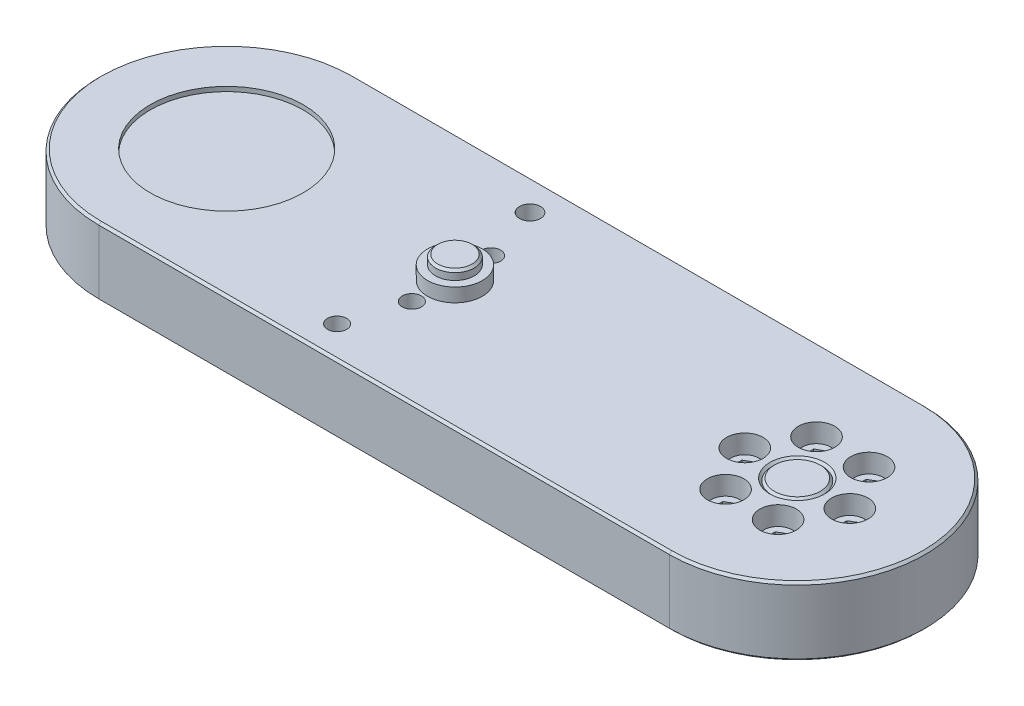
ISO-10303-21;
HEADER;
FILE_DESCRIPTION(('STEP AP214'),'2;1');
FILE_NAME('part.step','',(''),(''),'','','');
FILE_SCHEMA(('AUTOMOTIVE_DESIGN { 1 0 10303 214 1 1 1 1 }'));
ENDSEC;
DATA;
#1=APPLICATION_CONTEXT('core data for automotive mechanical design processes');
#2=APPLICATION_PROTOCOL_DEFINITION('international standard','automotive_design',2000,#1);
#3=PRODUCT_CONTEXT('',#1,'mechanical');
#4=PRODUCT('Part','Part','',(#3));
#5=PRODUCT_RELATED_PRODUCT_CATEGORY('part','',(#4));
#6=PRODUCT_DEFINITION_FORMATION('','',#4);
#7=PRODUCT_DEFINITION_CONTEXT('part definition',#1,'design');
#8=PRODUCT_DEFINITION('design','',#6,#7);
#9=PRODUCT_DEFINITION_SHAPE('','',#8);
#10=(LENGTH_UNIT() NAMED_UNIT(*) SI_UNIT(.MILLI.,.METRE.));
#11=(NAMED_UNIT(*) PLANE_ANGLE_UNIT() SI_UNIT($,.RADIAN.));
#12=(NAMED_UNIT(*) SI_UNIT($,.STERADIAN.) SOLID_ANGLE_UNIT());
#13=UNCERTAINTY_MEASURE_WITH_UNIT(LENGTH_MEASURE(1.E-05),#10,'distance_accuracy_value','');
#14=(GEOMETRIC_REPRESENTATION_CONTEXT(3) GLOBAL_UNCERTAINTY_ASSIGNED_CONTEXT((#13)) GLOBAL_UNIT_ASSIGNED_CONTEXT((#10,
#11,#12)) REPRESENTATION_CONTEXT('',''));
#15=CARTESIAN_POINT('',(0.,0.,0.));
#16=DIRECTION('',(0.,0.,1.));
#17=DIRECTION('',(1.,0.,0.));
#18=AXIS2_PLACEMENT_3D('',#15,#16,#17);
#19=CARTESIAN_POINT('',(133.85,11.5,9.95929214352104));
#20=DIRECTION('',(0.,1.,0.));
#21=DIRECTION('',(1.,0.,0.));
#22=AXIS2_PLACEMENT_3D('',#19,#20,#21);
#23=PLANE('',#22);
#24=DIRECTION('',(0.,0.,1.));
#25=VECTOR('',#24,1.);
#26=CARTESIAN_POINT('',(132.25,11.5,9.95929214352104));
#27=LINE('',#26,#25);
#28=CARTESIAN_POINT('',(132.25,11.5,9.0932667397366));
#29=VERTEX_POINT('',#28);
#30=CARTESIAN_POINT('',(132.25,11.5,10.8253175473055));
#31=VERTEX_POINT('',#30);
#32=EDGE_CURVE('E11',#29,#31,#27,.T.);
#33=ORIENTED_EDGE('',*,*,#32,.T.);
#34=DIRECTION('',(-0.866025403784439,0.,0.5));
#35=VECTOR('',#34,1.);
#36=CARTESIAN_POINT('',(133.825,11.5,9.91599087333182));
#37=LINE('',#36,#35);
#38=CARTESIAN_POINT('',(130.75,11.5,11.6913429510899));
#39=VERTEX_POINT('',#38);
#40=EDGE_CURVE('E27',#31,#39,#37,.T.);
#41=ORIENTED_EDGE('',*,*,#40,.T.);
#42=DIRECTION('',(-0.866025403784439,0.,-0.5));
#43=VECTOR('',#42,1.);
#44=CARTESIAN_POINT('',(132.325,11.5,12.6006696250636));
#45=LINE('',#44,#43);
#46=CARTESIAN_POINT('',(129.25,11.5,10.8253175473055));
#47=VERTEX_POINT('',#46);
#48=EDGE_CURVE('E780',#39,#47,#45,.T.);
#49=ORIENTED_EDGE('',*,*,#48,.T.);
#50=DIRECTION('',(0.,0.,-1.));
#51=VECTOR('',#50,1.);
#52=CARTESIAN_POINT('',(129.25,11.5,9.95929214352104));
#53=LINE('',#52,#51);
#54=CARTESIAN_POINT('',(129.25,11.5,9.0932667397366));
#55=VERTEX_POINT('',#54);
#56=EDGE_CURVE('E1044',#47,#55,#53,.T.);
#57=ORIENTED_EDGE('',*,*,#56,.T.);
#58=DIRECTION('',(0.866025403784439,0.,-0.5));
#59=VECTOR('',#58,1.);
#60=CARTESIAN_POINT('',(132.325,11.5,7.31791466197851));
#61=LINE('',#60,#59);
#62=CARTESIAN_POINT('',(130.75,11.5,8.22724133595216));
#63=VERTEX_POINT('',#62);
#64=EDGE_CURVE('E770',#55,#63,#61,.T.);
#65=ORIENTED_EDGE('',*,*,#64,.T.);
#66=DIRECTION('',(0.866025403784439,0.,0.5));
#67=VECTOR('',#66,1.);
#68=CARTESIAN_POINT('',(133.825,11.5,10.0025934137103));
#69=LINE('',#68,#67);
#70=EDGE_CURVE('E767',#63,#29,#69,.T.);
#71=ORIENTED_EDGE('',*,*,#70,.T.);
#72=EDGE_LOOP('',(#33,#41,#49,#57,#65,#71));
#73=FACE_BOUND('',#72,.T.);
#74=CARTESIAN_POINT('',(130.75,11.5,9.95929214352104));
#75=DIRECTION('',(0.,-1.,0.));
#76=DIRECTION('',(0.,0.,-1.));
#77=AXIS2_PLACEMENT_3D('',#74,#75,#76);
#78=CIRCLE('',#77,3.1);
#79=CARTESIAN_POINT('',(130.75,11.5,6.85929214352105));
#80=VERTEX_POINT('',#79);
#81=EDGE_CURVE('E785',#80,#80,#78,.T.);
#82=ORIENTED_EDGE('',*,*,#81,.F.);
#83=EDGE_LOOP('',(#82));
#84=FACE_BOUND('',#83,.T.);
#85=ADVANCED_FACE('F16',(#73,#84),#23,.T.);
#86=CARTESIAN_POINT('',(133.85,11.5,-9.95929214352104));
#87=DIRECTION('',(0.,1.,0.));
#88=DIRECTION('',(1.,0.,0.));
#89=AXIS2_PLACEMENT_3D('',#86,#87,#88);
#90=PLANE('',#89);
#91=DIRECTION('',(0.,0.,1.));
#92=VECTOR('',#91,1.);
#93=CARTESIAN_POINT('',(132.25,11.5,-9.95929214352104));
#94=LINE('',#93,#92);
#95=CARTESIAN_POINT('',(132.25,11.5,-10.8253175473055));
#96=VERTEX_POINT('',#95);
#97=CARTESIAN_POINT('',(132.25,11.5,-9.0932667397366));
#98=VERTEX_POINT('',#97);
#99=EDGE_CURVE('E771',#96,#98,#94,.T.);
#100=ORIENTED_EDGE('',*,*,#99,.T.);
#101=DIRECTION('',(-0.866025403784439,0.,0.5));
#102=VECTOR('',#101,1.);
#103=CARTESIAN_POINT('',(133.825,11.5,-10.0025934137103));
#104=LINE('',#103,#102);
#105=CARTESIAN_POINT('',(130.75,11.5,-8.22724133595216));
#106=VERTEX_POINT('',#105);
#107=EDGE_CURVE('E904',#98,#106,#104,.T.);
#108=ORIENTED_EDGE('',*,*,#107,.T.);
#109=DIRECTION('',(-0.866025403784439,0.,-0.5));
#110=VECTOR('',#109,1.);
#111=CARTESIAN_POINT('',(132.325,11.5,-7.31791466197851));
#112=LINE('',#111,#110);
#113=CARTESIAN_POINT('',(129.25,11.5,-9.0932667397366));
#114=VERTEX_POINT('',#113);
#115=EDGE_CURVE('E822',#106,#114,#112,.T.);
#116=ORIENTED_EDGE('',*,*,#115,.T.);
#117=DIRECTION('',(0.,0.,-1.));
#118=VECTOR('',#117,1.);
#119=CARTESIAN_POINT('',(129.25,11.5,-9.95929214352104));
#120=LINE('',#119,#118);
#121=CARTESIAN_POINT('',(129.25,11.5,-10.8253175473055));
#122=VERTEX_POINT('',#121);
#123=EDGE_CURVE('E818',#114,#122,#120,.T.);
#124=ORIENTED_EDGE('',*,*,#123,.T.);
#125=DIRECTION('',(0.866025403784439,0.,-0.5));
#126=VECTOR('',#125,1.);
#127=CARTESIAN_POINT('',(132.325,11.5,-12.6006696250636));
#128=LINE('',#127,#126);
#129=CARTESIAN_POINT('',(130.75,11.5,-11.6913429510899));
#130=VERTEX_POINT('',#129);
#131=EDGE_CURVE('E823',#122,#130,#128,.T.);
#132=ORIENTED_EDGE('',*,*,#131,.T.);
#133=DIRECTION('',(0.866025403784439,0.,0.5));
#134=VECTOR('',#133,1.);
#135=CARTESIAN_POINT('',(133.825,11.5,-9.91599087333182));
#136=LINE('',#135,#134);
#137=EDGE_CURVE('E1196',#130,#96,#136,.T.);
#138=ORIENTED_EDGE('',*,*,#137,.T.);
#139=EDGE_LOOP('',(#100,#108,#116,#124,#132,#138));
#140=FACE_BOUND('',#139,.T.);
#141=CARTESIAN_POINT('',(130.75,11.5,-9.95929214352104));
#142=DIRECTION('',(0.,-1.,0.));
#143=DIRECTION('',(0.,0.,-1.));
#144=AXIS2_PLACEMENT_3D('',#141,#142,#143);
#145=CIRCLE('',#144,3.1);
#146=CARTESIAN_POINT('',(130.75,11.5,-13.059292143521));
#147=VERTEX_POINT('',#146);
#148=EDGE_CURVE('E1173',#147,#147,#145,.T.);
#149=ORIENTED_EDGE('',*,*,#148,.F.);
#150=EDGE_LOOP('',(#149));
#151=FACE_BOUND('',#150,.T.);
#152=ADVANCED_FACE('F1550',(#140,#151),#90,.T.);
#153=CARTESIAN_POINT('',(122.35,11.5,-9.95929214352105));
#154=DIRECTION('',(0.,1.,0.));
#155=DIRECTION('',(1.,0.,0.));
#156=AXIS2_PLACEMENT_3D('',#153,#154,#155);
#157=PLANE('',#156);
#158=DIRECTION('',(0.,0.,1.));
#159=VECTOR('',#158,1.);
#160=CARTESIAN_POINT('',(120.75,11.5,-9.95929214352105));
#161=LINE('',#160,#159);
#162=CARTESIAN_POINT('',(120.75,11.5,-10.8253175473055));
#163=VERTEX_POINT('',#162);
#164=CARTESIAN_POINT('',(120.75,11.5,-9.09326673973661));
#165=VERTEX_POINT('',#164);
#166=EDGE_CURVE('E1192',#163,#165,#161,.T.);
#167=ORIENTED_EDGE('',*,*,#166,.T.);
#168=DIRECTION('',(-0.866025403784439,0.,0.5));
#169=VECTOR('',#168,1.);
#170=CARTESIAN_POINT('',(122.325,11.5,-10.0025934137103));
#171=LINE('',#170,#169);
#172=CARTESIAN_POINT('',(119.25,11.5,-8.22724133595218));
#173=VERTEX_POINT('',#172);
#174=EDGE_CURVE('E1197',#165,#173,#171,.T.);
#175=ORIENTED_EDGE('',*,*,#174,.T.);
#176=DIRECTION('',(-0.866025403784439,0.,-0.5));
#177=VECTOR('',#176,1.);
#178=CARTESIAN_POINT('',(120.825,11.5,-7.31791466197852));
#179=LINE('',#178,#177);
#180=CARTESIAN_POINT('',(117.75,11.5,-9.09326673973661));
#181=VERTEX_POINT('',#180);
#182=EDGE_CURVE('E1198',#173,#181,#179,.T.);
#183=ORIENTED_EDGE('',*,*,#182,.T.);
#184=DIRECTION('',(0.,0.,-1.));
#185=VECTOR('',#184,1.);
#186=CARTESIAN_POINT('',(117.75,11.5,-9.95929214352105));
#187=LINE('',#186,#185);
#188=CARTESIAN_POINT('',(117.75,11.5,-10.8253175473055));
#189=VERTEX_POINT('',#188);
#190=EDGE_CURVE('E959',#181,#189,#187,.T.);
#191=ORIENTED_EDGE('',*,*,#190,.T.);
#192=DIRECTION('',(0.866025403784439,0.,-0.5));
#193=VECTOR('',#192,1.);
#194=CARTESIAN_POINT('',(120.825,11.5,-12.6006696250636));
#195=LINE('',#194,#193);
#196=CARTESIAN_POINT('',(119.25,11.5,-11.6913429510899));
#197=VERTEX_POINT('',#196);
#198=EDGE_CURVE('E956',#189,#197,#195,.T.);
#199=ORIENTED_EDGE('',*,*,#198,.T.);
#200=DIRECTION('',(0.866025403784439,0.,0.5));
#201=VECTOR('',#200,1.);
#202=CARTESIAN_POINT('',(122.325,11.5,-9.91599087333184));
#203=LINE('',#202,#201);
#204=EDGE_CURVE('E960',#197,#163,#203,.T.);
#205=ORIENTED_EDGE('',*,*,#204,.T.);
#206=EDGE_LOOP('',(#167,#175,#183,#191,#199,#205));
#207=FACE_BOUND('',#206,.T.);
#208=CARTESIAN_POINT('',(119.25,11.5,-9.95929214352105));
#209=DIRECTION('',(0.,-1.,0.));
#210=DIRECTION('',(0.,0.,-1.));
#211=AXIS2_PLACEMENT_3D('',#208,#209,#210);
#212=CIRCLE('',#211,3.1);
#213=CARTESIAN_POINT('',(119.25,11.5,-13.059292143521));
#214=VERTEX_POINT('',#213);
#215=EDGE_CURVE('E915',#214,#214,#212,.T.);
#216=ORIENTED_EDGE('',*,*,#215,.F.);
#217=EDGE_LOOP('',(#216));
#218=FACE_BOUND('',#217,.T.);
#219=ADVANCED_FACE('F1556',(#207,#218),#157,.T.);
#220=CARTESIAN_POINT('',(116.6,11.5,0.));
#221=DIRECTION('',(0.,1.,0.));
#222=DIRECTION('',(1.,0.,0.));
#223=AXIS2_PLACEMENT_3D('',#220,#221,#222);
#224=PLANE('',#223);
#225=DIRECTION('',(0.,0.,1.));
#226=VECTOR('',#225,1.);
#227=CARTESIAN_POINT('',(115.,11.5,0.));
#228=LINE('',#227,#226);
#229=CARTESIAN_POINT('',(115.,11.5,-0.866025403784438));
#230=VERTEX_POINT('',#229);
#231=CARTESIAN_POINT('',(115.,11.5,0.866025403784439));
#232=VERTEX_POINT('',#231);
#233=EDGE_CURVE('E1021',#230,#232,#228,.T.);
#234=ORIENTED_EDGE('',*,*,#233,.T.);
#235=DIRECTION('',(-0.866025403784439,0.,0.5));
#236=VECTOR('',#235,1.);
#237=CARTESIAN_POINT('',(116.575,11.5,-0.0433012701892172));
#238=LINE('',#237,#236);
#239=CARTESIAN_POINT('',(113.5,11.5,1.73205080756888));
#240=VERTEX_POINT('',#239);
#241=EDGE_CURVE('E1460',#232,#240,#238,.T.);
#242=ORIENTED_EDGE('',*,*,#241,.T.);
#243=DIRECTION('',(-0.866025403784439,0.,-0.5));
#244=VECTOR('',#243,1.);
#245=CARTESIAN_POINT('',(115.075,11.5,2.64137748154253));
#246=LINE('',#245,#244);
#247=CARTESIAN_POINT('',(112.,11.5,0.866025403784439));
#248=VERTEX_POINT('',#247);
#249=EDGE_CURVE('E887',#240,#248,#246,.T.);
#250=ORIENTED_EDGE('',*,*,#249,.T.);
#251=DIRECTION('',(0.,0.,-1.));
#252=VECTOR('',#251,1.);
#253=CARTESIAN_POINT('',(112.,11.5,0.));
#254=LINE('',#253,#252);
#255=CARTESIAN_POINT('',(112.,11.5,-0.866025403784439));
#256=VERTEX_POINT('',#255);
#257=EDGE_CURVE('E876',#248,#256,#254,.T.);
#258=ORIENTED_EDGE('',*,*,#257,.T.);
#259=DIRECTION('',(0.866025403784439,0.,-0.5));
#260=VECTOR('',#259,1.);
#261=CARTESIAN_POINT('',(115.075,11.5,-2.64137748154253));
#262=LINE('',#261,#260);
#263=CARTESIAN_POINT('',(113.5,11.5,-1.73205080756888));
#264=VERTEX_POINT('',#263);
#265=EDGE_CURVE('E872',#256,#264,#262,.T.);
#266=ORIENTED_EDGE('',*,*,#265,.T.);
#267=DIRECTION('',(0.866025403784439,0.,0.5));
#268=VECTOR('',#267,1.);
#269=CARTESIAN_POINT('',(116.575,11.5,0.0433012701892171));
#270=LINE('',#269,#268);
#271=EDGE_CURVE('E877',#264,#230,#270,.T.);
#272=ORIENTED_EDGE('',*,*,#271,.T.);
#273=EDGE_LOOP('',(#234,#242,#250,#258,#266,#272));
#274=FACE_BOUND('',#273,.T.);
#275=CARTESIAN_POINT('',(113.5,11.5,0.));
#276=DIRECTION('',(0.,-1.,0.));
#277=DIRECTION('',(0.,0.,-1.));
#278=AXIS2_PLACEMENT_3D('',#275,#276,#277);
#279=CIRCLE('',#278,3.1);
#280=CARTESIAN_POINT('',(113.5,11.5,-3.1));
#281=VERTEX_POINT('',#280);
#282=EDGE_CURVE('E732',#281,#281,#279,.T.);
#283=ORIENTED_EDGE('',*,*,#282,.F.);
#284=EDGE_LOOP('',(#283));
#285=FACE_BOUND('',#284,.T.);
#286=ADVANCED_FACE('F1620',(#274,#285),#224,.T.);
#287=CARTESIAN_POINT('',(122.35,11.5,9.95929214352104));
#288=DIRECTION('',(0.,1.,0.));
#289=DIRECTION('',(1.,0.,0.));
#290=AXIS2_PLACEMENT_3D('',#287,#288,#289);
#291=PLANE('',#290);
#292=DIRECTION('',(0.,0.,1.));
#293=VECTOR('',#292,1.);
#294=CARTESIAN_POINT('',(120.75,11.5,9.95929214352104));
#295=LINE('',#294,#293);
#296=CARTESIAN_POINT('',(120.75,11.5,9.0932667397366));
#297=VERTEX_POINT('',#296);
#298=CARTESIAN_POINT('',(120.75,11.5,10.8253175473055));
#299=VERTEX_POINT('',#298);
#300=EDGE_CURVE('E776',#297,#299,#295,.T.);
#301=ORIENTED_EDGE('',*,*,#300,.T.);
#302=DIRECTION('',(-0.866025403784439,0.,0.5));
#303=VECTOR('',#302,1.);
#304=CARTESIAN_POINT('',(122.325,11.5,9.91599087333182));
#305=LINE('',#304,#303);
#306=CARTESIAN_POINT('',(119.25,11.5,11.6913429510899));
#307=VERTEX_POINT('',#306);
#308=EDGE_CURVE('E772',#299,#307,#305,.T.);
#309=ORIENTED_EDGE('',*,*,#308,.T.);
#310=DIRECTION('',(-0.866025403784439,0.,-0.5));
#311=VECTOR('',#310,1.);
#312=CARTESIAN_POINT('',(120.825,11.5,12.6006696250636));
#313=LINE('',#312,#311);
#314=CARTESIAN_POINT('',(117.75,11.5,10.8253175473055));
#315=VERTEX_POINT('',#314);
#316=EDGE_CURVE('E777',#307,#315,#313,.T.);
#317=ORIENTED_EDGE('',*,*,#316,.T.);
#318=DIRECTION('',(0.,0.,-1.));
#319=VECTOR('',#318,1.);
#320=CARTESIAN_POINT('',(117.75,11.5,9.95929214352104));
#321=LINE('',#320,#319);
#322=CARTESIAN_POINT('',(117.75,11.5,9.0932667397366));
#323=VERTEX_POINT('',#322);
#324=EDGE_CURVE('E1039',#315,#323,#321,.T.);
#325=ORIENTED_EDGE('',*,*,#324,.T.);
#326=DIRECTION('',(0.866025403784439,0.,-0.5));
#327=VECTOR('',#326,1.);
#328=CARTESIAN_POINT('',(120.825,11.5,7.31791466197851));
#329=LINE('',#328,#327);
#330=CARTESIAN_POINT('',(119.25,11.5,8.22724133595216));
#331=VERTEX_POINT('',#330);
#332=EDGE_CURVE('E1035',#323,#331,#329,.T.);
#333=ORIENTED_EDGE('',*,*,#332,.T.);
#334=DIRECTION('',(0.866025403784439,0.,0.5));
#335=VECTOR('',#334,1.);
#336=CARTESIAN_POINT('',(122.325,11.5,10.0025934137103));
#337=LINE('',#336,#335);
#338=EDGE_CURVE('E1040',#331,#297,#337,.T.);
#339=ORIENTED_EDGE('',*,*,#338,.T.);
#340=EDGE_LOOP('',(#301,#309,#317,#325,#333,#339));
#341=FACE_BOUND('',#340,.T.);
#342=CARTESIAN_POINT('',(119.25,11.5,9.95929214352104));
#343=DIRECTION('',(0.,-1.,0.));
#344=DIRECTION('',(0.,0.,-1.));
#345=AXIS2_PLACEMENT_3D('',#342,#343,#344);
#346=CIRCLE('',#345,3.1);
#347=CARTESIAN_POINT('',(119.25,11.5,6.85929214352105));
#348=VERTEX_POINT('',#347);
#349=EDGE_CURVE('E755',#348,#348,#346,.T.);
#350=ORIENTED_EDGE('',*,*,#349,.F.);
#351=EDGE_LOOP('',(#350));
#352=FACE_BOUND('',#351,.T.);
#353=ADVANCED_FACE('F1617',(#341,#352),#291,.T.);
#354=CARTESIAN_POINT('',(139.6,11.5,0.));
#355=DIRECTION('',(0.,1.,0.));
#356=DIRECTION('',(1.,0.,0.));
#357=AXIS2_PLACEMENT_3D('',#354,#355,#356);
#358=PLANE('',#357);
#359=DIRECTION('',(0.,0.,1.));
#360=VECTOR('',#359,1.);
#361=CARTESIAN_POINT('',(138.,11.5,0.));
#362=LINE('',#361,#360);
#363=CARTESIAN_POINT('',(138.,11.5,-0.866025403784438));
#364=VERTEX_POINT('',#363);
#365=CARTESIAN_POINT('',(138.,11.5,0.866025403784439));
#366=VERTEX_POINT('',#365);
#367=EDGE_CURVE('E1160',#364,#366,#362,.T.);
#368=ORIENTED_EDGE('',*,*,#367,.T.);
#369=DIRECTION('',(-0.866025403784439,0.,0.5));
#370=VECTOR('',#369,1.);
#371=CARTESIAN_POINT('',(139.575,11.5,-0.0433012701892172));
#372=LINE('',#371,#370);
#373=CARTESIAN_POINT('',(136.5,11.5,1.73205080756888));
#374=VERTEX_POINT('',#373);
#375=EDGE_CURVE('E1156',#366,#374,#372,.T.);
#376=ORIENTED_EDGE('',*,*,#375,.T.);
#377=DIRECTION('',(-0.866025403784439,0.,-0.5));
#378=VECTOR('',#377,1.);
#379=CARTESIAN_POINT('',(138.075,11.5,2.64137748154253));
#380=LINE('',#379,#378);
#381=CARTESIAN_POINT('',(135.,11.5,0.866025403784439));
#382=VERTEX_POINT('',#381);
#383=EDGE_CURVE('E1161',#374,#382,#380,.T.);
#384=ORIENTED_EDGE('',*,*,#383,.T.);
#385=DIRECTION('',(0.,0.,-1.));
#386=VECTOR('',#385,1.);
#387=CARTESIAN_POINT('',(135.,11.5,0.));
#388=LINE('',#387,#386);
#389=CARTESIAN_POINT('',(135.,11.5,-0.866025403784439));
#390=VERTEX_POINT('',#389);
#391=EDGE_CURVE('E1292',#382,#390,#388,.T.);
#392=ORIENTED_EDGE('',*,*,#391,.T.);
#393=DIRECTION('',(0.866025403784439,0.,-0.5));
#394=VECTOR('',#393,1.);
#395=CARTESIAN_POINT('',(138.075,11.5,-2.64137748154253));
#396=LINE('',#395,#394);
#397=CARTESIAN_POINT('',(136.5,11.5,-1.73205080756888));
#398=VERTEX_POINT('',#397);
#399=EDGE_CURVE('E1288',#390,#398,#396,.T.);
#400=ORIENTED_EDGE('',*,*,#399,.T.);
#401=DIRECTION('',(0.866025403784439,0.,0.5));
#402=VECTOR('',#401,1.);
#403=CARTESIAN_POINT('',(139.575,11.5,0.0433012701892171));
#404=LINE('',#403,#402);
#405=EDGE_CURVE('E1260',#398,#364,#404,.T.);
#406=ORIENTED_EDGE('',*,*,#405,.T.);
#407=EDGE_LOOP('',(#368,#376,#384,#392,#400,#406));
#408=FACE_BOUND('',#407,.T.);
#409=CARTESIAN_POINT('',(136.5,11.5,0.));
#410=DIRECTION('',(0.,-1.,0.));
#411=DIRECTION('',(0.,0.,-1.));
#412=AXIS2_PLACEMENT_3D('',#409,#410,#411);
#413=CIRCLE('',#412,3.1);
#414=CARTESIAN_POINT('',(136.5,11.5,-3.1));
#415=VERTEX_POINT('',#414);
#416=EDGE_CURVE('E718',#415,#415,#413,.T.);
#417=ORIENTED_EDGE('',*,*,#416,.F.);
#418=EDGE_LOOP('',(#417));
#419=FACE_BOUND('',#418,.T.);
#420=ADVANCED_FACE('F1603',(#408,#419),#358,.T.);
#421=CARTESIAN_POINT('',(0.,15.,0.));
#422=DIRECTION('',(0.,1.,0.));
#423=DIRECTION('',(1.,0.,0.));
#424=AXIS2_PLACEMENT_3D('',#421,#422,#423);
#425=PLANE('',#424);
#426=CARTESIAN_POINT('',(50.,15.,0.));
#427=DIRECTION('',(0.,1.,0.));
#428=DIRECTION('',(0.,0.,1.));
#429=AXIS2_PLACEMENT_3D('',#426,#427,#428);
#430=CIRCLE('',#429,6.);
#431=CARTESIAN_POINT('',(50.,15.,6.));
#432=VERTEX_POINT('',#431);
#433=EDGE_CURVE('E1304',#432,#432,#430,.T.);
#434=ORIENTED_EDGE('',*,*,#433,.F.);
#435=EDGE_LOOP('',(#434));
#436=FACE_BOUND('',#435,.T.);
#437=CARTESIAN_POINT('',(125.,15.,0.));
#438=DIRECTION('',(0.,-1.,0.));
#439=DIRECTION('',(0.,0.,-1.));
#440=AXIS2_PLACEMENT_3D('',#437,#438,#439);
#441=CIRCLE('',#440,6.);
#442=CARTESIAN_POINT('',(125.,15.,-6.));
#443=VERTEX_POINT('',#442);
#444=EDGE_CURVE('E1145',#443,#443,#441,.T.);
#445=ORIENTED_EDGE('',*,*,#444,.T.);
#446=EDGE_LOOP('',(#445));
#447=FACE_BOUND('',#446,.T.);
#448=CARTESIAN_POINT('',(0.,15.,0.));
#449=DIRECTION('',(0.,-1.,0.));
#450=DIRECTION('',(0.,0.,-1.));
#451=AXIS2_PLACEMENT_3D('',#448,#449,#450);
#452=CIRCLE('',#451,16.75);
#453=CARTESIAN_POINT('',(0.,15.,-16.75));
#454=VERTEX_POINT('',#453);
#455=EDGE_CURVE('E1060',#454,#454,#452,.T.);
#456=ORIENTED_EDGE('',*,*,#455,.T.);
#457=EDGE_LOOP('',(#456));
#458=FACE_BOUND('',#457,.T.);
#459=CARTESIAN_POINT('',(119.25,15.,9.95929214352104));
#460=DIRECTION('',(0.,-1.,0.));
#461=DIRECTION('',(0.,0.,-1.));
#462=AXIS2_PLACEMENT_3D('',#459,#460,#461);
#463=CIRCLE('',#462,4.);
#464=CARTESIAN_POINT('',(119.25,15.,5.95929214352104));
#465=VERTEX_POINT('',#464);
#466=EDGE_CURVE('E1056',#465,#465,#463,.T.);
#467=ORIENTED_EDGE('',*,*,#466,.T.);
#468=EDGE_LOOP('',(#467));
#469=FACE_BOUND('',#468,.T.);
#470=CARTESIAN_POINT('',(113.5,15.,0.));
#471=DIRECTION('',(0.,-1.,0.));
#472=DIRECTION('',(0.,0.,-1.));
#473=AXIS2_PLACEMENT_3D('',#470,#471,#472);
#474=CIRCLE('',#473,4.);
#475=CARTESIAN_POINT('',(113.5,15.,-4.));
#476=VERTEX_POINT('',#475);
#477=EDGE_CURVE('E1061',#476,#476,#474,.T.);
#478=ORIENTED_EDGE('',*,*,#477,.T.);
#479=EDGE_LOOP('',(#478));
#480=FACE_BOUND('',#479,.T.);
#481=CARTESIAN_POINT('',(119.25,15.,-9.95929214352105));
#482=DIRECTION('',(0.,-1.,0.));
#483=DIRECTION('',(0.,0.,-1.));
#484=AXIS2_PLACEMENT_3D('',#481,#482,#483);
#485=CIRCLE('',#484,4.);
#486=CARTESIAN_POINT('',(119.25,15.,-13.9592921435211));
#487=VERTEX_POINT('',#486);
#488=EDGE_CURVE('E1211',#487,#487,#485,.T.);
#489=ORIENTED_EDGE('',*,*,#488,.T.);
#490=EDGE_LOOP('',(#489));
#491=FACE_BOUND('',#490,.T.);
#492=CARTESIAN_POINT('',(130.75,15.,-9.95929214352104));
#493=DIRECTION('',(0.,-1.,0.));
#494=DIRECTION('',(0.,0.,-1.));
#495=AXIS2_PLACEMENT_3D('',#492,#493,#494);
#496=CIRCLE('',#495,4.);
#497=CARTESIAN_POINT('',(130.75,15.,-13.959292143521));
#498=VERTEX_POINT('',#497);
#499=EDGE_CURVE('E1066',#498,#498,#496,.T.);
#500=ORIENTED_EDGE('',*,*,#499,.T.);
#501=EDGE_LOOP('',(#500));
#502=FACE_BOUND('',#501,.T.);
#503=CARTESIAN_POINT('',(130.75,15.,9.95929214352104));
#504=DIRECTION('',(0.,-1.,0.));
#505=DIRECTION('',(0.,0.,-1.));
#506=AXIS2_PLACEMENT_3D('',#503,#504,#505);
#507=CIRCLE('',#506,4.);
#508=CARTESIAN_POINT('',(130.75,15.,5.95929214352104));
#509=VERTEX_POINT('',#508);
#510=EDGE_CURVE('E1062',#509,#509,#507,.T.);
#511=ORIENTED_EDGE('',*,*,#510,.T.);
#512=EDGE_LOOP('',(#511));
#513=FACE_BOUND('',#512,.T.);
#514=CARTESIAN_POINT('',(136.5,15.,0.));
#515=DIRECTION('',(0.,-1.,0.));
#516=DIRECTION('',(0.,0.,-1.));
#517=AXIS2_PLACEMENT_3D('',#514,#515,#516);
#518=CIRCLE('',#517,4.);
#519=CARTESIAN_POINT('',(136.5,15.,-4.));
#520=VERTEX_POINT('',#519);
#521=EDGE_CURVE('E842',#520,#520,#518,.T.);
#522=ORIENTED_EDGE('',*,*,#521,.T.);
#523=EDGE_LOOP('',(#522));
#524=FACE_BOUND('',#523,.T.);
#525=CARTESIAN_POINT('',(49.2403876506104,15.,-8.68240888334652));
#526=DIRECTION('',(0.,-1.,0.));
#527=DIRECTION('',(0.,0.,-1.));
#528=AXIS2_PLACEMENT_3D('',#525,#526,#527);
#529=CIRCLE('',#528,2.1);
#530=CARTESIAN_POINT('',(49.2403876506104,15.,-10.7824088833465));
#531=VERTEX_POINT('',#530);
#532=EDGE_CURVE('E838',#531,#531,#529,.T.);
#533=ORIENTED_EDGE('',*,*,#532,.T.);
#534=EDGE_LOOP('',(#533));
#535=FACE_BOUND('',#534,.T.);
#536=CARTESIAN_POINT('',(49.2403876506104,15.,8.68240888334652));
#537=DIRECTION('',(0.,-1.,0.));
#538=DIRECTION('',(0.,0.,-1.));
#539=AXIS2_PLACEMENT_3D('',#536,#537,#538);
#540=CIRCLE('',#539,2.1);
#541=CARTESIAN_POINT('',(49.2403876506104,15.,6.58240888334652));
#542=VERTEX_POINT('',#541);
#543=EDGE_CURVE('E843',#542,#542,#540,.T.);
#544=ORIENTED_EDGE('',*,*,#543,.T.);
#545=EDGE_LOOP('',(#544));
#546=FACE_BOUND('',#545,.T.);
#547=CARTESIAN_POINT('',(45.3153893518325,15.,21.130913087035));
#548=DIRECTION('',(0.,-1.,0.));
#549=DIRECTION('',(0.,0.,-1.));
#550=AXIS2_PLACEMENT_3D('',#547,#548,#549);
#551=CIRCLE('',#550,2.1);
#552=CARTESIAN_POINT('',(45.3153893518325,15.,19.030913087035));
#553=VERTEX_POINT('',#552);
#554=EDGE_CURVE('E1240',#553,#553,#551,.T.);
#555=ORIENTED_EDGE('',*,*,#554,.T.);
#556=EDGE_LOOP('',(#555));
#557=FACE_BOUND('',#556,.T.);
#558=CARTESIAN_POINT('',(45.3153893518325,15.,-21.130913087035));
#559=DIRECTION('',(0.,-1.,0.));
#560=DIRECTION('',(0.,0.,-1.));
#561=AXIS2_PLACEMENT_3D('',#558,#559,#560);
#562=CIRCLE('',#561,2.3);
#563=CARTESIAN_POINT('',(45.3153893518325,15.,-23.430913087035));
#564=VERTEX_POINT('',#563);
#565=EDGE_CURVE('E1236',#564,#564,#562,.T.);
#566=ORIENTED_EDGE('',*,*,#565,.T.);
#567=EDGE_LOOP('',(#566));
#568=FACE_BOUND('',#567,.T.);
#569=DIRECTION('',(-1.,0.,0.));
#570=VECTOR('',#569,1.);
#571=CARTESIAN_POINT('',(150.,15.,27.5));
#572=LINE('',#571,#570);
#573=CARTESIAN_POINT('',(125.,15.,27.5));
#574=VERTEX_POINT('',#573);
#575=CARTESIAN_POINT('',(0.,15.,27.5));
#576=VERTEX_POINT('',#575);
#577=EDGE_CURVE('E1031',#574,#576,#572,.T.);
#578=ORIENTED_EDGE('',*,*,#577,.F.);
#579=CARTESIAN_POINT('',(125.,15.,0.));
#580=DIRECTION('',(0.,-1.,0.));
#581=DIRECTION('',(0.,0.,-1.));
#582=AXIS2_PLACEMENT_3D('',#579,#580,#581);
#583=CIRCLE('',#582,27.5);
#584=CARTESIAN_POINT('',(125.,15.,-27.5));
#585=VERTEX_POINT('',#584);
#586=EDGE_CURVE('E1327',#585,#574,#583,.T.);
#587=ORIENTED_EDGE('',*,*,#586,.F.);
#588=DIRECTION('',(-1.,0.,0.));
#589=VECTOR('',#588,1.);
#590=CARTESIAN_POINT('',(150.,15.,-27.5));
#591=LINE('',#590,#589);
#592=CARTESIAN_POINT('',(0.,15.,-27.5));
#593=VERTEX_POINT('',#592);
#594=EDGE_CURVE('E1241',#585,#593,#591,.T.);
#595=ORIENTED_EDGE('',*,*,#594,.T.);
#596=CARTESIAN_POINT('',(0.,15.,0.));
#597=DIRECTION('',(0.,1.,0.));
#598=DIRECTION('',(0.,0.,1.));
#599=AXIS2_PLACEMENT_3D('',#596,#597,#598);
#600=CIRCLE('',#599,27.5);
#601=EDGE_CURVE('E1249',#593,#576,#600,.T.);
#602=ORIENTED_EDGE('',*,*,#601,.T.);
#603=EDGE_LOOP('',(#578,#587,#595,#602));
#604=FACE_BOUND('',#603,.T.);
#605=ADVANCED_FACE('F1599',(#436,#447,#458,#469,#480,#491,#502,#513,#524,#535,#546,#557,#568,
#604),#425,.T.);
#606=CARTESIAN_POINT('',(0.,0.,0.));
#607=DIRECTION('',(0.,1.,0.));
#608=DIRECTION('',(1.,0.,0.));
#609=AXIS2_PLACEMENT_3D('',#606,#607,#608);
#610=PLANE('',#609);
#611=CARTESIAN_POINT('',(6.45,0.,-11.0851251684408));
#612=DIRECTION('',(0.,-1.,0.));
#613=DIRECTION('',(0.,0.,-1.));
#614=AXIS2_PLACEMENT_3D('',#611,#612,#613);
#615=CIRCLE('',#614,4.);
#616=CARTESIAN_POINT('',(6.45,0.,-15.0851251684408));
#617=VERTEX_POINT('',#616);
#618=EDGE_CURVE('E765',#617,#617,#615,.T.);
#619=ORIENTED_EDGE('',*,*,#618,.F.);
#620=EDGE_LOOP('',(#619));
#621=FACE_BOUND('',#620,.T.);
#622=CARTESIAN_POINT('',(12.85,0.,0.));
#623=DIRECTION('',(0.,-1.,0.));
#624=DIRECTION('',(0.,0.,-1.));
#625=AXIS2_PLACEMENT_3D('',#622,#623,#624);
#626=CIRCLE('',#625,4.);
#627=CARTESIAN_POINT('',(12.85,0.,-4.));
#628=VERTEX_POINT('',#627);
#629=EDGE_CURVE('E1050',#628,#628,#626,.T.);
#630=ORIENTED_EDGE('',*,*,#629,.F.);
#631=EDGE_LOOP('',(#630));
#632=FACE_BOUND('',#631,.T.);
#633=CARTESIAN_POINT('',(6.45,0.,11.0851251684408));
#634=DIRECTION('',(0.,-1.,0.));
#635=DIRECTION('',(0.,0.,-1.));
#636=AXIS2_PLACEMENT_3D('',#633,#634,#635);
#637=CIRCLE('',#636,4.);
#638=CARTESIAN_POINT('',(6.45,0.,7.08512516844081));
#639=VERTEX_POINT('',#638);
#640=EDGE_CURVE('E938',#639,#639,#637,.T.);
#641=ORIENTED_EDGE('',*,*,#640,.F.);
#642=EDGE_LOOP('',(#641));
#643=FACE_BOUND('',#642,.T.);
#644=CARTESIAN_POINT('',(-6.35,0.,11.0851251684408));
#645=DIRECTION('',(0.,-1.,0.));
#646=DIRECTION('',(0.,0.,-1.));
#647=AXIS2_PLACEMENT_3D('',#644,#645,#646);
#648=CIRCLE('',#647,4.);
#649=CARTESIAN_POINT('',(-6.35,0.,7.08512516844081));
#650=VERTEX_POINT('',#649);
#651=EDGE_CURVE('E816',#650,#650,#648,.T.);
#652=ORIENTED_EDGE('',*,*,#651,.F.);
#653=EDGE_LOOP('',(#652));
#654=FACE_BOUND('',#653,.T.);
#655=CARTESIAN_POINT('',(-6.35,0.,-11.0851251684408));
#656=DIRECTION('',(0.,-1.,0.));
#657=DIRECTION('',(0.,0.,-1.));
#658=AXIS2_PLACEMENT_3D('',#655,#656,#657);
#659=CIRCLE('',#658,4.);
#660=CARTESIAN_POINT('',(-6.35,0.,-15.0851251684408));
#661=VERTEX_POINT('',#660);
#662=EDGE_CURVE('E940',#661,#661,#659,.T.);
#663=ORIENTED_EDGE('',*,*,#662,.F.);
#664=EDGE_LOOP('',(#663));
#665=FACE_BOUND('',#664,.T.);
#666=CARTESIAN_POINT('',(-12.75,0.,0.));
#667=DIRECTION('',(0.,-1.,0.));
#668=DIRECTION('',(0.,0.,-1.));
#669=AXIS2_PLACEMENT_3D('',#666,#667,#668);
#670=CIRCLE('',#669,4.);
#671=CARTESIAN_POINT('',(-12.75,0.,-4.));
#672=VERTEX_POINT('',#671);
#673=EDGE_CURVE('E1319',#672,#672,#670,.T.);
#674=ORIENTED_EDGE('',*,*,#673,.F.);
#675=EDGE_LOOP('',(#674));
#676=FACE_BOUND('',#675,.T.);
#677=CARTESIAN_POINT('',(125.,0.,0.));
#678=DIRECTION('',(0.,-1.,0.));
#679=DIRECTION('',(0.,0.,-1.));
#680=AXIS2_PLACEMENT_3D('',#677,#678,#679);
#681=CIRCLE('',#680,15.5);
#682=CARTESIAN_POINT('',(125.,0.,-15.5));
#683=VERTEX_POINT('',#682);
#684=EDGE_CURVE('E714',#683,#683,#681,.T.);
#685=ORIENTED_EDGE('',*,*,#684,.F.);
#686=EDGE_LOOP('',(#685));
#687=FACE_BOUND('',#686,.T.);
#688=CARTESIAN_POINT('',(49.2403876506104,0.,-8.68240888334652));
#689=DIRECTION('',(0.,-1.,0.));
#690=DIRECTION('',(0.,0.,-1.));
#691=AXIS2_PLACEMENT_3D('',#688,#689,#690);
#692=CIRCLE('',#691,2.1);
#693=CARTESIAN_POINT('',(49.2403876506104,0.,-10.7824088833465));
#694=VERTEX_POINT('',#693);
#695=EDGE_CURVE('E1113',#694,#694,#692,.T.);
#696=ORIENTED_EDGE('',*,*,#695,.F.);
#697=EDGE_LOOP('',(#696));
#698=FACE_BOUND('',#697,.T.);
#699=CARTESIAN_POINT('',(49.2403876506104,0.,8.68240888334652));
#700=DIRECTION('',(0.,-1.,0.));
#701=DIRECTION('',(0.,0.,-1.));
#702=AXIS2_PLACEMENT_3D('',#699,#700,#701);
#703=CIRCLE('',#702,2.1);
#704=CARTESIAN_POINT('',(49.2403876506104,0.,6.58240888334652));
#705=VERTEX_POINT('',#704);
#706=EDGE_CURVE('E1117',#705,#705,#703,.T.);
#707=ORIENTED_EDGE('',*,*,#706,.F.);
#708=EDGE_LOOP('',(#707));
#709=FACE_BOUND('',#708,.T.);
#710=CARTESIAN_POINT('',(50.,0.,0.));
#711=DIRECTION('',(0.,-1.,0.));
#712=DIRECTION('',(0.,0.,-1.));
#713=AXIS2_PLACEMENT_3D('',#710,#711,#712);
#714=CIRCLE('',#713,2.1);
#715=CARTESIAN_POINT('',(50.,0.,-2.1));
#716=VERTEX_POINT('',#715);
#717=EDGE_CURVE('E1146',#716,#716,#714,.T.);
#718=ORIENTED_EDGE('',*,*,#717,.F.);
#719=EDGE_LOOP('',(#718));
#720=FACE_BOUND('',#719,.T.);
#721=CARTESIAN_POINT('',(45.3153893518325,0.,21.130913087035));
#722=DIRECTION('',(0.,-1.,0.));
#723=DIRECTION('',(0.,0.,-1.));
#724=AXIS2_PLACEMENT_3D('',#721,#722,#723);
#725=CIRCLE('',#724,2.1);
#726=CARTESIAN_POINT('',(45.3153893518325,0.,19.030913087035));
#727=VERTEX_POINT('',#726);
#728=EDGE_CURVE('E854',#727,#727,#725,.T.);
#729=ORIENTED_EDGE('',*,*,#728,.F.);
#730=EDGE_LOOP('',(#729));
#731=FACE_BOUND('',#730,.T.);
#732=CARTESIAN_POINT('',(45.3153893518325,0.,-21.130913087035));
#733=DIRECTION('',(0.,-1.,0.));
#734=DIRECTION('',(0.,0.,-1.));
#735=AXIS2_PLACEMENT_3D('',#732,#733,#734);
#736=CIRCLE('',#735,2.3);
#737=CARTESIAN_POINT('',(45.3153893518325,0.,-23.430913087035));
#738=VERTEX_POINT('',#737);
#739=EDGE_CURVE('E858',#738,#738,#736,.T.);
#740=ORIENTED_EDGE('',*,*,#739,.F.);
#741=EDGE_LOOP('',(#740));
#742=FACE_BOUND('',#741,.T.);
#743=CARTESIAN_POINT('',(125.,0.,0.));
#744=DIRECTION('',(0.,-1.,0.));
#745=DIRECTION('',(0.,0.,-1.));
#746=AXIS2_PLACEMENT_3D('',#743,#744,#745);
#747=CIRCLE('',#746,27.5);
#748=CARTESIAN_POINT('',(125.,0.,-27.5));
#749=VERTEX_POINT('',#748);
#750=CARTESIAN_POINT('',(125.,0.,27.5));
#751=VERTEX_POINT('',#750);
#752=EDGE_CURVE('E1253',#749,#751,#747,.T.);
#753=ORIENTED_EDGE('',*,*,#752,.T.);
#754=DIRECTION('',(-1.,0.,0.));
#755=VECTOR('',#754,1.);
#756=CARTESIAN_POINT('',(150.,0.,27.5));
#757=LINE('',#756,#755);
#758=CARTESIAN_POINT('',(0.,0.,27.5));
#759=VERTEX_POINT('',#758);
#760=EDGE_CURVE('E1266',#751,#759,#757,.T.);
#761=ORIENTED_EDGE('',*,*,#760,.T.);
#762=CARTESIAN_POINT('',(0.,0.,0.));
#763=DIRECTION('',(0.,1.,0.));
#764=DIRECTION('',(0.,0.,1.));
#765=AXIS2_PLACEMENT_3D('',#762,#763,#764);
#766=CIRCLE('',#765,27.5);
#767=CARTESIAN_POINT('',(0.,0.,-27.5));
#768=VERTEX_POINT('',#767);
#769=EDGE_CURVE('E848',#768,#759,#766,.T.);
#770=ORIENTED_EDGE('',*,*,#769,.F.);
#771=DIRECTION('',(-1.,0.,0.));
#772=VECTOR('',#771,1.);
#773=CARTESIAN_POINT('',(150.,0.,-27.5));
#774=LINE('',#773,#772);
#775=EDGE_CURVE('E905',#749,#768,#774,.T.);
#776=ORIENTED_EDGE('',*,*,#775,.F.);
#777=EDGE_LOOP('',(#753,#761,#770,#776));
#778=FACE_BOUND('',#777,.T.);
#779=ADVANCED_FACE('F1602',(#621,#632,#643,#654,#665,#676,#687,#698,#709,#720,#731,#742,#778),
#610,.F.);
#780=CARTESIAN_POINT('',(125.,15.,-28.));
#781=DIRECTION('',(0.,0.,1.));
#782=DIRECTION('',(1.,0.,0.));
#783=AXIS2_PLACEMENT_3D('',#780,#781,#782);
#784=PLANE('',#783);
#785=DIRECTION('',(0.,-1.,0.));
#786=VECTOR('',#785,1.);
#787=CARTESIAN_POINT('',(0.,15.,-28.));
#788=LINE('',#787,#786);
#789=CARTESIAN_POINT('',(0.,14.5,-28.));
#790=VERTEX_POINT('',#789);
#791=CARTESIAN_POINT('',(0.,0.5,-28.));
#792=VERTEX_POINT('',#791);
#793=EDGE_CURVE('E831',#790,#792,#788,.T.);
#794=ORIENTED_EDGE('',*,*,#793,.F.);
#795=DIRECTION('',(-1.,0.,0.));
#796=VECTOR('',#795,1.);
#797=CARTESIAN_POINT('',(150.,14.5,-28.));
#798=LINE('',#797,#796);
#799=CARTESIAN_POINT('',(125.,14.5,-28.));
#800=VERTEX_POINT('',#799);
#801=EDGE_CURVE('E1248',#800,#790,#798,.T.);
#802=ORIENTED_EDGE('',*,*,#801,.F.);
#803=DIRECTION('',(0.,-1.,0.));
#804=VECTOR('',#803,1.);
#805=CARTESIAN_POINT('',(125.,15.,-28.));
#806=LINE('',#805,#804);
#807=CARTESIAN_POINT('',(125.,0.5,-28.));
#808=VERTEX_POINT('',#807);
#809=EDGE_CURVE('E837',#800,#808,#806,.T.);
#810=ORIENTED_EDGE('',*,*,#809,.T.);
#811=DIRECTION('',(-1.,0.,0.));
#812=VECTOR('',#811,1.);
#813=CARTESIAN_POINT('',(150.,0.5,-28.));
#814=LINE('',#813,#812);
#815=EDGE_CURVE('E833',#808,#792,#814,.T.);
#816=ORIENTED_EDGE('',*,*,#815,.T.);
#817=EDGE_LOOP('',(#794,#802,#810,#816));
#818=FACE_BOUND('',#817,.T.);
#819=ADVANCED_FACE('F1891',(#818),#784,.F.);
#820=CARTESIAN_POINT('',(0.,15.,0.));
#821=DIRECTION('',(0.,-1.,0.));
#822=DIRECTION('',(0.,0.,-1.));
#823=AXIS2_PLACEMENT_3D('',#820,#821,#822);
#824=CYLINDRICAL_SURFACE('',#823,28.);
#825=ORIENTED_EDGE('',*,*,#793,.T.);
#826=CARTESIAN_POINT('',(0.,0.5,0.));
#827=DIRECTION('',(0.,1.,0.));
#828=DIRECTION('',(0.,0.,1.));
#829=AXIS2_PLACEMENT_3D('',#826,#827,#828);
#830=CIRCLE('',#829,28.);
#831=CARTESIAN_POINT('',(0.,0.5,28.));
#832=VERTEX_POINT('',#831);
#833=EDGE_CURVE('E827',#792,#832,#830,.T.);
#834=ORIENTED_EDGE('',*,*,#833,.T.);
#835=DIRECTION('',(0.,-1.,0.));
#836=VECTOR('',#835,1.);
#837=CARTESIAN_POINT('',(0.,15.,28.));
#838=LINE('',#837,#836);
#839=CARTESIAN_POINT('',(0.,14.5,28.));
#840=VERTEX_POINT('',#839);
#841=EDGE_CURVE('E798',#840,#832,#838,.T.);
#842=ORIENTED_EDGE('',*,*,#841,.F.);
#843=CARTESIAN_POINT('',(0.,14.5,0.));
#844=DIRECTION('',(0.,1.,0.));
#845=DIRECTION('',(0.,0.,1.));
#846=AXIS2_PLACEMENT_3D('',#843,#844,#845);
#847=CIRCLE('',#846,28.);
#848=EDGE_CURVE('E849',#790,#840,#847,.T.);
#849=ORIENTED_EDGE('',*,*,#848,.F.);
#850=EDGE_LOOP('',(#825,#834,#842,#849));
#851=FACE_BOUND('',#850,.T.);
#852=ADVANCED_FACE('F1791',(#851),#824,.T.);
#853=CARTESIAN_POINT('',(0.,15.,28.));
#854=DIRECTION('',(0.,0.,-1.));
#855=DIRECTION('',(0.,-1.,0.));
#856=AXIS2_PLACEMENT_3D('',#853,#854,#855);
#857=PLANE('',#856);
#858=DIRECTION('',(0.,-1.,0.));
#859=VECTOR('',#858,1.);
#860=CARTESIAN_POINT('',(125.,15.,28.));
#861=LINE('',#860,#859);
#862=CARTESIAN_POINT('',(125.,14.5,28.));
#863=VERTEX_POINT('',#862);
#864=CARTESIAN_POINT('',(125.,0.5,28.));
#865=VERTEX_POINT('',#864);
#866=EDGE_CURVE('E799',#863,#865,#861,.T.);
#867=ORIENTED_EDGE('',*,*,#866,.F.);
#868=DIRECTION('',(-1.,0.,0.));
#869=VECTOR('',#868,1.);
#870=CARTESIAN_POINT('',(150.,14.5,28.));
#871=LINE('',#870,#869);
#872=EDGE_CURVE('E832',#863,#840,#871,.T.);
#873=ORIENTED_EDGE('',*,*,#872,.T.);
#874=ORIENTED_EDGE('',*,*,#841,.T.);
#875=DIRECTION('',(-1.,0.,0.));
#876=VECTOR('',#875,1.);
#877=CARTESIAN_POINT('',(150.,0.5,28.));
#878=LINE('',#877,#876);
#879=EDGE_CURVE('E1025',#865,#832,#878,.T.);
#880=ORIENTED_EDGE('',*,*,#879,.F.);
#881=EDGE_LOOP('',(#867,#873,#874,#880));
#882=FACE_BOUND('',#881,.T.);
#883=ADVANCED_FACE('F1787',(#882),#857,.F.);
#884=CARTESIAN_POINT('',(125.,15.,0.));
#885=DIRECTION('',(0.,-1.,0.));
#886=DIRECTION('',(0.,0.,-1.));
#887=AXIS2_PLACEMENT_3D('',#884,#885,#886);
#888=CYLINDRICAL_SURFACE('',#887,28.);
#889=ORIENTED_EDGE('',*,*,#809,.F.);
#890=CARTESIAN_POINT('',(125.,14.5,0.));
#891=DIRECTION('',(0.,-1.,0.));
#892=DIRECTION('',(0.,0.,-1.));
#893=AXIS2_PLACEMENT_3D('',#890,#891,#892);
#894=CIRCLE('',#893,28.);
#895=EDGE_CURVE('E794',#800,#863,#894,.T.);
#896=ORIENTED_EDGE('',*,*,#895,.T.);
#897=ORIENTED_EDGE('',*,*,#866,.T.);
#898=CARTESIAN_POINT('',(125.,0.5,0.));
#899=DIRECTION('',(0.,-1.,0.));
#900=DIRECTION('',(0.,0.,-1.));
#901=AXIS2_PLACEMENT_3D('',#898,#899,#900);
#902=CIRCLE('',#901,28.);
#903=EDGE_CURVE('E1134',#808,#865,#902,.T.);
#904=ORIENTED_EDGE('',*,*,#903,.F.);
#905=EDGE_LOOP('',(#889,#896,#897,#904));
#906=FACE_BOUND('',#905,.T.);
#907=ADVANCED_FACE('F1790',(#906),#888,.T.);
#908=CARTESIAN_POINT('',(0.,0.,0.));
#909=DIRECTION('',(0.,1.,0.));
#910=DIRECTION('',(0.,0.,1.));
#911=AXIS2_PLACEMENT_3D('',#908,#909,#910);
#912=CONICAL_SURFACE('',#911,27.5,0.785398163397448);
#913=ORIENTED_EDGE('',*,*,#833,.F.);
#914=DIRECTION('',(0.,0.707106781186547,-0.707106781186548));
#915=VECTOR('',#914,1.);
#916=CARTESIAN_POINT('',(0.,0.,-27.5));
#917=LINE('',#916,#915);
#918=EDGE_CURVE('E1030',#768,#792,#917,.T.);
#919=ORIENTED_EDGE('',*,*,#918,.F.);
#920=ORIENTED_EDGE('',*,*,#769,.T.);
#921=DIRECTION('',(0.,0.707106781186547,0.707106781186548));
#922=VECTOR('',#921,1.);
#923=CARTESIAN_POINT('',(0.,0.,27.5));
#924=LINE('',#923,#922);
#925=EDGE_CURVE('E844',#759,#832,#924,.T.);
#926=ORIENTED_EDGE('',*,*,#925,.T.);
#927=EDGE_LOOP('',(#913,#919,#920,#926));
#928=FACE_BOUND('',#927,.T.);
#929=ADVANCED_FACE('F1802',(#928),#912,.T.);
#930=CARTESIAN_POINT('',(0.,14.5,0.));
#931=DIRECTION('',(0.,-1.,0.));
#932=DIRECTION('',(0.,0.,-1.));
#933=AXIS2_PLACEMENT_3D('',#930,#931,#932);
#934=CONICAL_SURFACE('',#933,28.,0.785398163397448);
#935=DIRECTION('',(0.,0.707106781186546,0.707106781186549));
#936=VECTOR('',#935,1.);
#937=CARTESIAN_POINT('',(0.,14.5,-28.));
#938=LINE('',#937,#936);
#939=EDGE_CURVE('E1034',#790,#593,#938,.T.);
#940=ORIENTED_EDGE('',*,*,#939,.F.);
#941=ORIENTED_EDGE('',*,*,#848,.T.);
#942=DIRECTION('',(0.,0.707106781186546,-0.707106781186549));
#943=VECTOR('',#942,1.);
#944=CARTESIAN_POINT('',(0.,14.5,28.));
#945=LINE('',#944,#943);
#946=EDGE_CURVE('E955',#840,#576,#945,.T.);
#947=ORIENTED_EDGE('',*,*,#946,.T.);
#948=ORIENTED_EDGE('',*,*,#601,.F.);
#949=EDGE_LOOP('',(#940,#941,#947,#948));
#950=FACE_BOUND('',#949,.T.);
#951=ADVANCED_FACE('F1805',(#950),#934,.T.);
#952=CARTESIAN_POINT('',(125.,15.,0.));
#953=DIRECTION('',(0.,-1.,0.));
#954=DIRECTION('',(0.,0.,-1.));
#955=AXIS2_PLACEMENT_3D('',#952,#953,#954);
#956=CONICAL_SURFACE('',#955,27.5,0.785398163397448);
#957=ORIENTED_EDGE('',*,*,#895,.F.);
#958=DIRECTION('',(0.,-0.707106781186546,-0.707106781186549));
#959=VECTOR('',#958,1.);
#960=CARTESIAN_POINT('',(125.,15.,-27.5));
#961=LINE('',#960,#959);
#962=EDGE_CURVE('E909',#585,#800,#961,.T.);
#963=ORIENTED_EDGE('',*,*,#962,.F.);
#964=ORIENTED_EDGE('',*,*,#586,.T.);
#965=DIRECTION('',(0.,-0.707106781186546,0.707106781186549));
#966=VECTOR('',#965,1.);
#967=CARTESIAN_POINT('',(125.,15.,27.5));
#968=LINE('',#967,#966);
#969=EDGE_CURVE('E1138',#574,#863,#968,.T.);
#970=ORIENTED_EDGE('',*,*,#969,.T.);
#971=EDGE_LOOP('',(#957,#963,#964,#970));
#972=FACE_BOUND('',#971,.T.);
#973=ADVANCED_FACE('F1800',(#972),#956,.T.);
#974=CARTESIAN_POINT('',(125.,0.5,0.));
#975=DIRECTION('',(0.,1.,0.));
#976=DIRECTION('',(0.,0.,1.));
#977=AXIS2_PLACEMENT_3D('',#974,#975,#976);
#978=CONICAL_SURFACE('',#977,28.,0.785398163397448);
#979=ORIENTED_EDGE('',*,*,#752,.F.);
#980=DIRECTION('',(0.,-0.707106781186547,0.707106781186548));
#981=VECTOR('',#980,1.);
#982=CARTESIAN_POINT('',(125.,0.5,-28.));
#983=LINE('',#982,#981);
#984=EDGE_CURVE('E908',#808,#749,#983,.T.);
#985=ORIENTED_EDGE('',*,*,#984,.F.);
#986=ORIENTED_EDGE('',*,*,#903,.T.);
#987=DIRECTION('',(0.,-0.707106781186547,-0.707106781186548));
#988=VECTOR('',#987,1.);
#989=CARTESIAN_POINT('',(125.,0.5,28.));
#990=LINE('',#989,#988);
#991=EDGE_CURVE('E1029',#865,#751,#990,.T.);
#992=ORIENTED_EDGE('',*,*,#991,.T.);
#993=EDGE_LOOP('',(#979,#985,#986,#992));
#994=FACE_BOUND('',#993,.T.);
#995=ADVANCED_FACE('F1796',(#994),#978,.T.);
#996=CARTESIAN_POINT('',(150.,0.5,28.));
#997=DIRECTION('',(0.,0.707106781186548,-0.707106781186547));
#998=DIRECTION('',(-1.,0.,0.));
#999=AXIS2_PLACEMENT_3D('',#996,#997,#998);
#1000=PLANE('',#999);
#1001=ORIENTED_EDGE('',*,*,#760,.F.);
#1002=ORIENTED_EDGE('',*,*,#991,.F.);
#1003=ORIENTED_EDGE('',*,*,#879,.T.);
#1004=ORIENTED_EDGE('',*,*,#925,.F.);
#1005=EDGE_LOOP('',(#1001,#1002,#1003,#1004));
#1006=FACE_BOUND('',#1005,.T.);
#1007=ADVANCED_FACE('F1799',(#1006),#1000,.F.);
#1008=CARTESIAN_POINT('',(150.,0.,-27.5));
#1009=DIRECTION('',(0.,0.707106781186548,0.707106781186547));
#1010=DIRECTION('',(1.,0.,0.));
#1011=AXIS2_PLACEMENT_3D('',#1008,#1009,#1010);
#1012=PLANE('',#1011);
#1013=ORIENTED_EDGE('',*,*,#918,.T.);
#1014=ORIENTED_EDGE('',*,*,#815,.F.);
#1015=ORIENTED_EDGE('',*,*,#984,.T.);
#1016=ORIENTED_EDGE('',*,*,#775,.T.);
#1017=EDGE_LOOP('',(#1013,#1014,#1015,#1016));
#1018=FACE_BOUND('',#1017,.T.);
#1019=ADVANCED_FACE('F1952',(#1018),#1012,.F.);
#1020=CARTESIAN_POINT('',(150.,14.5,-28.));
#1021=DIRECTION('',(0.,-0.707106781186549,0.707106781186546));
#1022=DIRECTION('',(-1.,0.,0.));
#1023=AXIS2_PLACEMENT_3D('',#1020,#1021,#1022);
#1024=PLANE('',#1023);
#1025=ORIENTED_EDGE('',*,*,#594,.F.);
#1026=ORIENTED_EDGE('',*,*,#962,.T.);
#1027=ORIENTED_EDGE('',*,*,#801,.T.);
#1028=ORIENTED_EDGE('',*,*,#939,.T.);
#1029=EDGE_LOOP('',(#1025,#1026,#1027,#1028));
#1030=FACE_BOUND('',#1029,.T.);
#1031=ADVANCED_FACE('F1949',(#1030),#1024,.F.);
#1032=CARTESIAN_POINT('',(150.,15.,27.5));
#1033=DIRECTION('',(0.,-0.707106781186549,-0.707106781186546));
#1034=DIRECTION('',(0.,0.707106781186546,-0.707106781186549));
#1035=AXIS2_PLACEMENT_3D('',#1032,#1033,#1034);
#1036=PLANE('',#1035);
#1037=ORIENTED_EDGE('',*,*,#946,.F.);
#1038=ORIENTED_EDGE('',*,*,#872,.F.);
#1039=ORIENTED_EDGE('',*,*,#969,.F.);
#1040=ORIENTED_EDGE('',*,*,#577,.T.);
#1041=EDGE_LOOP('',(#1037,#1038,#1039,#1040));
#1042=FACE_BOUND('',#1041,.T.);
#1043=ADVANCED_FACE('F1743',(#1042),#1036,.F.);
#1044=CARTESIAN_POINT('',(45.3153893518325,0.,-21.130913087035));
#1045=DIRECTION('',(0.,-1.,0.));
#1046=DIRECTION('',(0.,0.,-1.));
#1047=AXIS2_PLACEMENT_3D('',#1044,#1045,#1046);
#1048=CYLINDRICAL_SURFACE('',#1047,2.3);
#1049=ORIENTED_EDGE('',*,*,#739,.T.);
#1050=EDGE_LOOP('',(#1049));
#1051=FACE_BOUND('',#1050,.T.);
#1052=ORIENTED_EDGE('',*,*,#565,.F.);
#1053=EDGE_LOOP('',(#1052));
#1054=FACE_BOUND('',#1053,.T.);
#1055=ADVANCED_FACE('F1739',(#1051,#1054),#1048,.F.);
#1056=CARTESIAN_POINT('',(45.3153893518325,0.,21.130913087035));
#1057=DIRECTION('',(0.,-1.,0.));
#1058=DIRECTION('',(0.,0.,-1.));
#1059=AXIS2_PLACEMENT_3D('',#1056,#1057,#1058);
#1060=CYLINDRICAL_SURFACE('',#1059,2.1);
#1061=ORIENTED_EDGE('',*,*,#728,.T.);
#1062=EDGE_LOOP('',(#1061));
#1063=FACE_BOUND('',#1062,.T.);
#1064=ORIENTED_EDGE('',*,*,#554,.F.);
#1065=EDGE_LOOP('',(#1064));
#1066=FACE_BOUND('',#1065,.T.);
#1067=ADVANCED_FACE('F1742',(#1063,#1066),#1060,.F.);
#1068=CARTESIAN_POINT('',(50.,15.,0.));
#1069=DIRECTION('',(0.,-1.,0.));
#1070=DIRECTION('',(0.,0.,-1.));
#1071=AXIS2_PLACEMENT_3D('',#1068,#1069,#1070);
#1072=PLANE('',#1071);
#1073=CARTESIAN_POINT('',(50.,15.,0.));
#1074=DIRECTION('',(0.,-1.,0.));
#1075=DIRECTION('',(0.,0.,-1.));
#1076=AXIS2_PLACEMENT_3D('',#1073,#1074,#1075);
#1077=CIRCLE('',#1076,2.1);
#1078=CARTESIAN_POINT('',(50.,15.,-2.1));
#1079=VERTEX_POINT('',#1078);
#1080=EDGE_CURVE('E859',#1079,#1079,#1077,.T.);
#1081=ORIENTED_EDGE('',*,*,#1080,.T.);
#1082=EDGE_LOOP('',(#1081));
#1083=FACE_BOUND('',#1082,.T.);
#1084=ADVANCED_FACE('F1775',(#1083),#1072,.T.);
#1085=CARTESIAN_POINT('',(50.,0.,0.));
#1086=DIRECTION('',(0.,-1.,0.));
#1087=DIRECTION('',(0.,0.,-1.));
#1088=AXIS2_PLACEMENT_3D('',#1085,#1086,#1087);
#1089=CYLINDRICAL_SURFACE('',#1088,2.1);
#1090=ORIENTED_EDGE('',*,*,#717,.T.);
#1091=EDGE_LOOP('',(#1090));
#1092=FACE_BOUND('',#1091,.T.);
#1093=ORIENTED_EDGE('',*,*,#1080,.F.);
#1094=EDGE_LOOP('',(#1093));
#1095=FACE_BOUND('',#1094,.T.);
#1096=ADVANCED_FACE('F1926',(#1092,#1095),#1089,.F.);
#1097=CARTESIAN_POINT('',(49.2403876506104,0.,8.68240888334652));
#1098=DIRECTION('',(0.,-1.,0.));
#1099=DIRECTION('',(0.,0.,-1.));
#1100=AXIS2_PLACEMENT_3D('',#1097,#1098,#1099);
#1101=CYLINDRICAL_SURFACE('',#1100,2.1);
#1102=ORIENTED_EDGE('',*,*,#706,.T.);
#1103=EDGE_LOOP('',(#1102));
#1104=FACE_BOUND('',#1103,.T.);
#1105=ORIENTED_EDGE('',*,*,#543,.F.);
#1106=EDGE_LOOP('',(#1105));
#1107=FACE_BOUND('',#1106,.T.);
#1108=ADVANCED_FACE('F1761',(#1104,#1107),#1101,.F.);
#1109=CARTESIAN_POINT('',(49.2403876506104,0.,-8.68240888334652));
#1110=DIRECTION('',(0.,-1.,0.));
#1111=DIRECTION('',(0.,0.,-1.));
#1112=AXIS2_PLACEMENT_3D('',#1109,#1110,#1111);
#1113=CYLINDRICAL_SURFACE('',#1112,2.1);
#1114=ORIENTED_EDGE('',*,*,#695,.T.);
#1115=EDGE_LOOP('',(#1114));
#1116=FACE_BOUND('',#1115,.T.);
#1117=ORIENTED_EDGE('',*,*,#532,.F.);
#1118=EDGE_LOOP('',(#1117));
#1119=FACE_BOUND('',#1118,.T.);
#1120=ADVANCED_FACE('F1757',(#1116,#1119),#1113,.F.);
#1121=CARTESIAN_POINT('',(125.,1.,0.));
#1122=DIRECTION('',(0.,-1.,0.));
#1123=DIRECTION('',(0.,0.,-1.));
#1124=AXIS2_PLACEMENT_3D('',#1121,#1122,#1123);
#1125=PLANE('',#1124);
#1126=CARTESIAN_POINT('',(125.,1.,0.));
#1127=DIRECTION('',(0.,-1.,0.));
#1128=DIRECTION('',(0.,0.,-1.));
#1129=AXIS2_PLACEMENT_3D('',#1126,#1127,#1128);
#1130=CIRCLE('',#1129,15.5);
#1131=CARTESIAN_POINT('',(125.,1.,-15.5));
#1132=VERTEX_POINT('',#1131);
#1133=EDGE_CURVE('E867',#1132,#1132,#1130,.T.);
#1134=ORIENTED_EDGE('',*,*,#1133,.T.);
#1135=EDGE_LOOP('',(#1134));
#1136=FACE_BOUND('',#1135,.T.);
#1137=ADVANCED_FACE('F1760',(#1136),#1125,.T.);
#1138=CARTESIAN_POINT('',(125.,0.,0.));
#1139=DIRECTION('',(0.,-1.,0.));
#1140=DIRECTION('',(0.,0.,-1.));
#1141=AXIS2_PLACEMENT_3D('',#1138,#1139,#1140);
#1142=CYLINDRICAL_SURFACE('',#1141,15.5);
#1143=ORIENTED_EDGE('',*,*,#684,.T.);
#1144=EDGE_LOOP('',(#1143));
#1145=FACE_BOUND('',#1144,.T.);
#1146=ORIENTED_EDGE('',*,*,#1133,.F.);
#1147=EDGE_LOOP('',(#1146));
#1148=FACE_BOUND('',#1147,.T.);
#1149=ADVANCED_FACE('F1847',(#1145,#1148),#1142,.F.);
#1150=CARTESIAN_POINT('',(136.5,7.5,0.));
#1151=DIRECTION('',(0.,-1.,0.));
#1152=DIRECTION('',(0.,0.,-1.));
#1153=AXIS2_PLACEMENT_3D('',#1150,#1151,#1152);
#1154=CYLINDRICAL_SURFACE('',#1153,4.);
#1155=CARTESIAN_POINT('',(136.5,7.5,0.));
#1156=DIRECTION('',(0.,-1.,0.));
#1157=DIRECTION('',(0.,0.,-1.));
#1158=AXIS2_PLACEMENT_3D('',#1155,#1156,#1157);
#1159=CIRCLE('',#1158,4.);
#1160=CARTESIAN_POINT('',(136.5,7.5,-4.));
#1161=VERTEX_POINT('',#1160);
#1162=EDGE_CURVE('E706',#1161,#1161,#1159,.T.);
#1163=ORIENTED_EDGE('',*,*,#1162,.T.);
#1164=EDGE_LOOP('',(#1163));
#1165=FACE_BOUND('',#1164,.T.);
#1166=ORIENTED_EDGE('',*,*,#521,.F.);
#1167=EDGE_LOOP('',(#1166));
#1168=FACE_BOUND('',#1167,.T.);
#1169=ADVANCED_FACE('F1843',(#1165,#1168),#1154,.F.);
#1170=CARTESIAN_POINT('',(140.5,7.5,0.));
#1171=DIRECTION('',(0.,1.,0.));
#1172=DIRECTION('',(1.,0.,0.));
#1173=AXIS2_PLACEMENT_3D('',#1170,#1171,#1172);
#1174=PLANE('',#1173);
#1175=CARTESIAN_POINT('',(136.5,7.5,0.));
#1176=DIRECTION('',(0.,-1.,0.));
#1177=DIRECTION('',(0.,0.,-1.));
#1178=AXIS2_PLACEMENT_3D('',#1175,#1176,#1177);
#1179=CIRCLE('',#1178,3.5);
#1180=CARTESIAN_POINT('',(136.5,7.5,-3.5));
#1181=VERTEX_POINT('',#1180);
#1182=EDGE_CURVE('E702',#1181,#1181,#1179,.T.);
#1183=ORIENTED_EDGE('',*,*,#1182,.T.);
#1184=EDGE_LOOP('',(#1183));
#1185=FACE_BOUND('',#1184,.T.);
#1186=ORIENTED_EDGE('',*,*,#1162,.F.);
#1187=EDGE_LOOP('',(#1186));
#1188=FACE_BOUND('',#1187,.T.);
#1189=ADVANCED_FACE('F1846',(#1185,#1188),#1174,.T.);
#1190=CARTESIAN_POINT('',(136.5,7.5,0.));
#1191=DIRECTION('',(0.,-1.,0.));
#1192=DIRECTION('',(0.,0.,-1.));
#1193=AXIS2_PLACEMENT_3D('',#1190,#1191,#1192);
#1194=CYLINDRICAL_SURFACE('',#1193,3.5);
#1195=CARTESIAN_POINT('',(136.5,11.1,0.));
#1196=DIRECTION('',(0.,-1.,0.));
#1197=DIRECTION('',(0.,0.,-1.));
#1198=AXIS2_PLACEMENT_3D('',#1195,#1196,#1197);
#1199=CIRCLE('',#1198,3.5);
#1200=CARTESIAN_POINT('',(136.5,11.1,-3.5));
#1201=VERTEX_POINT('',#1200);
#1202=EDGE_CURVE('E707',#1201,#1201,#1199,.T.);
#1203=ORIENTED_EDGE('',*,*,#1202,.T.);
#1204=EDGE_LOOP('',(#1203));
#1205=FACE_BOUND('',#1204,.T.);
#1206=ORIENTED_EDGE('',*,*,#1182,.F.);
#1207=EDGE_LOOP('',(#1206));
#1208=FACE_BOUND('',#1207,.T.);
#1209=ADVANCED_FACE('F703',(#1205,#1208),#1194,.T.);
#1210=CARTESIAN_POINT('',(136.5,11.1,0.));
#1211=DIRECTION('',(0.,-1.,0.));
#1212=DIRECTION('',(0.,0.,-1.));
#1213=AXIS2_PLACEMENT_3D('',#1210,#1211,#1212);
#1214=CONICAL_SURFACE('',#1213,3.5,0.785398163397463);
#1215=ORIENTED_EDGE('',*,*,#416,.T.);
#1216=EDGE_LOOP('',(#1215));
#1217=FACE_BOUND('',#1216,.T.);
#1218=ORIENTED_EDGE('',*,*,#1202,.F.);
#1219=EDGE_LOOP('',(#1218));
#1220=FACE_BOUND('',#1219,.T.);
#1221=ADVANCED_FACE('F1579',(#1217,#1220),#1214,.T.);
#1222=CARTESIAN_POINT('',(130.75,7.5,9.95929214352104));
#1223=DIRECTION('',(0.,-1.,0.));
#1224=DIRECTION('',(0.,0.,-1.));
#1225=AXIS2_PLACEMENT_3D('',#1222,#1223,#1224);
#1226=CYLINDRICAL_SURFACE('',#1225,4.);
#1227=CARTESIAN_POINT('',(130.75,7.5,9.95929214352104));
#1228=DIRECTION('',(0.,-1.,0.));
#1229=DIRECTION('',(0.,0.,-1.));
#1230=AXIS2_PLACEMENT_3D('',#1227,#1228,#1229);
#1231=CIRCLE('',#1230,4.);
#1232=CARTESIAN_POINT('',(130.75,7.5,5.95929214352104));
#1233=VERTEX_POINT('',#1232);
#1234=EDGE_CURVE('E1094',#1233,#1233,#1231,.T.);
#1235=ORIENTED_EDGE('',*,*,#1234,.T.);
#1236=EDGE_LOOP('',(#1235));
#1237=FACE_BOUND('',#1236,.T.);
#1238=ORIENTED_EDGE('',*,*,#510,.F.);
#1239=EDGE_LOOP('',(#1238));
#1240=FACE_BOUND('',#1239,.T.);
#1241=ADVANCED_FACE('F1582',(#1237,#1240),#1226,.F.);
#1242=CARTESIAN_POINT('',(134.75,7.5,9.95929214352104));
#1243=DIRECTION('',(0.,1.,0.));
#1244=DIRECTION('',(1.,0.,0.));
#1245=AXIS2_PLACEMENT_3D('',#1242,#1243,#1244);
#1246=PLANE('',#1245);
#1247=CARTESIAN_POINT('',(130.75,7.5,9.95929214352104));
#1248=DIRECTION('',(0.,-1.,0.));
#1249=DIRECTION('',(0.,0.,-1.));
#1250=AXIS2_PLACEMENT_3D('',#1247,#1248,#1249);
#1251=CIRCLE('',#1250,3.5);
#1252=CARTESIAN_POINT('',(130.75,7.5,6.45929214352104));
#1253=VERTEX_POINT('',#1252);
#1254=EDGE_CURVE('E863',#1253,#1253,#1251,.T.);
#1255=ORIENTED_EDGE('',*,*,#1254,.T.);
#1256=EDGE_LOOP('',(#1255));
#1257=FACE_BOUND('',#1256,.T.);
#1258=ORIENTED_EDGE('',*,*,#1234,.F.);
#1259=EDGE_LOOP('',(#1258));
#1260=FACE_BOUND('',#1259,.T.);
#1261=ADVANCED_FACE('F1737',(#1257,#1260),#1246,.T.);
#1262=CARTESIAN_POINT('',(130.75,7.5,9.95929214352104));
#1263=DIRECTION('',(0.,-1.,0.));
#1264=DIRECTION('',(0.,0.,-1.));
#1265=AXIS2_PLACEMENT_3D('',#1262,#1263,#1264);
#1266=CYLINDRICAL_SURFACE('',#1265,3.5);
#1267=CARTESIAN_POINT('',(130.75,11.1,9.95929214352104));
#1268=DIRECTION('',(0.,-1.,0.));
#1269=DIRECTION('',(0.,0.,-1.));
#1270=AXIS2_PLACEMENT_3D('',#1267,#1268,#1269);
#1271=CIRCLE('',#1270,3.5);
#1272=CARTESIAN_POINT('',(130.75,11.1,6.45929214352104));
#1273=VERTEX_POINT('',#1272);
#1274=EDGE_CURVE('E789',#1273,#1273,#1271,.T.);
#1275=ORIENTED_EDGE('',*,*,#1274,.T.);
#1276=EDGE_LOOP('',(#1275));
#1277=FACE_BOUND('',#1276,.T.);
#1278=ORIENTED_EDGE('',*,*,#1254,.F.);
#1279=EDGE_LOOP('',(#1278));
#1280=FACE_BOUND('',#1279,.T.);
#1281=ADVANCED_FACE('F1734',(#1277,#1280),#1266,.T.);
#1282=CARTESIAN_POINT('',(130.75,11.1,9.95929214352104));
#1283=DIRECTION('',(0.,-1.,0.));
#1284=DIRECTION('',(0.,0.,-1.));
#1285=AXIS2_PLACEMENT_3D('',#1282,#1283,#1284);
#1286=CONICAL_SURFACE('',#1285,3.5,0.785398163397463);
#1287=ORIENTED_EDGE('',*,*,#81,.T.);
#1288=EDGE_LOOP('',(#1287));
#1289=FACE_BOUND('',#1288,.T.);
#1290=ORIENTED_EDGE('',*,*,#1274,.F.);
#1291=EDGE_LOOP('',(#1290));
#1292=FACE_BOUND('',#1291,.T.);
#1293=ADVANCED_FACE('F1655',(#1289,#1292),#1286,.T.);
#1294=CARTESIAN_POINT('',(130.75,7.5,-9.95929214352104));
#1295=DIRECTION('',(0.,-1.,0.));
#1296=DIRECTION('',(0.,0.,-1.));
#1297=AXIS2_PLACEMENT_3D('',#1294,#1295,#1296);
#1298=CYLINDRICAL_SURFACE('',#1297,4.);
#1299=CARTESIAN_POINT('',(130.75,7.5,-9.95929214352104));
#1300=DIRECTION('',(0.,-1.,0.));
#1301=DIRECTION('',(0.,0.,-1.));
#1302=AXIS2_PLACEMENT_3D('',#1299,#1300,#1301);
#1303=CIRCLE('',#1302,4.);
#1304=CARTESIAN_POINT('',(130.75,7.5,-13.959292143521));
#1305=VERTEX_POINT('',#1304);
#1306=EDGE_CURVE('E790',#1305,#1305,#1303,.T.);
#1307=ORIENTED_EDGE('',*,*,#1306,.T.);
#1308=EDGE_LOOP('',(#1307));
#1309=FACE_BOUND('',#1308,.T.);
#1310=ORIENTED_EDGE('',*,*,#499,.F.);
#1311=EDGE_LOOP('',(#1310));
#1312=FACE_BOUND('',#1311,.T.);
#1313=ADVANCED_FACE('F1651',(#1309,#1312),#1298,.F.);
#1314=CARTESIAN_POINT('',(134.75,7.5,-9.95929214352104));
#1315=DIRECTION('',(0.,1.,0.));
#1316=DIRECTION('',(1.,0.,0.));
#1317=AXIS2_PLACEMENT_3D('',#1314,#1315,#1316);
#1318=PLANE('',#1317);
#1319=CARTESIAN_POINT('',(130.75,7.5,-9.95929214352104));
#1320=DIRECTION('',(0.,-1.,0.));
#1321=DIRECTION('',(0.,0.,-1.));
#1322=AXIS2_PLACEMENT_3D('',#1319,#1320,#1321);
#1323=CIRCLE('',#1322,3.5);
#1324=CARTESIAN_POINT('',(130.75,7.5,-13.459292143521));
#1325=VERTEX_POINT('',#1324);
#1326=EDGE_CURVE('E1122',#1325,#1325,#1323,.T.);
#1327=ORIENTED_EDGE('',*,*,#1326,.T.);
#1328=EDGE_LOOP('',(#1327));
#1329=FACE_BOUND('',#1328,.T.);
#1330=ORIENTED_EDGE('',*,*,#1306,.F.);
#1331=EDGE_LOOP('',(#1330));
#1332=FACE_BOUND('',#1331,.T.);
#1333=ADVANCED_FACE('F1654',(#1329,#1332),#1318,.T.);
#1334=CARTESIAN_POINT('',(130.75,7.5,-9.95929214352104));
#1335=DIRECTION('',(0.,-1.,0.));
#1336=DIRECTION('',(0.,0.,-1.));
#1337=AXIS2_PLACEMENT_3D('',#1334,#1335,#1336);
#1338=CYLINDRICAL_SURFACE('',#1337,3.5);
#1339=CARTESIAN_POINT('',(130.75,11.1,-9.95929214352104));
#1340=DIRECTION('',(0.,-1.,0.));
#1341=DIRECTION('',(0.,0.,-1.));
#1342=AXIS2_PLACEMENT_3D('',#1339,#1340,#1341);
#1343=CIRCLE('',#1342,3.5);
#1344=CARTESIAN_POINT('',(130.75,11.1,-13.459292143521));
#1345=VERTEX_POINT('',#1344);
#1346=EDGE_CURVE('E1126',#1345,#1345,#1343,.T.);
#1347=ORIENTED_EDGE('',*,*,#1346,.T.);
#1348=EDGE_LOOP('',(#1347));
#1349=FACE_BOUND('',#1348,.T.);
#1350=ORIENTED_EDGE('',*,*,#1326,.F.);
#1351=EDGE_LOOP('',(#1350));
#1352=FACE_BOUND('',#1351,.T.);
#1353=ADVANCED_FACE('F1938',(#1349,#1352),#1338,.T.);
#1354=CARTESIAN_POINT('',(130.75,11.1,-9.95929214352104));
#1355=DIRECTION('',(0.,-1.,0.));
#1356=DIRECTION('',(0.,0.,-1.));
#1357=AXIS2_PLACEMENT_3D('',#1354,#1355,#1356);
#1358=CONICAL_SURFACE('',#1357,3.5,0.785398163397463);
#1359=ORIENTED_EDGE('',*,*,#148,.T.);
#1360=EDGE_LOOP('',(#1359));
#1361=FACE_BOUND('',#1360,.T.);
#1362=ORIENTED_EDGE('',*,*,#1346,.F.);
#1363=EDGE_LOOP('',(#1362));
#1364=FACE_BOUND('',#1363,.T.);
#1365=ADVANCED_FACE('F1631',(#1361,#1364),#1358,.T.);
#1366=CARTESIAN_POINT('',(119.25,7.5,-9.95929214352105));
#1367=DIRECTION('',(0.,-1.,0.));
#1368=DIRECTION('',(0.,0.,-1.));
#1369=AXIS2_PLACEMENT_3D('',#1366,#1367,#1368);
#1370=CYLINDRICAL_SURFACE('',#1369,4.);
#1371=CARTESIAN_POINT('',(119.25,7.5,-9.95929214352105));
#1372=DIRECTION('',(0.,-1.,0.));
#1373=DIRECTION('',(0.,0.,-1.));
#1374=AXIS2_PLACEMENT_3D('',#1371,#1372,#1373);
#1375=CIRCLE('',#1374,4.);
#1376=CARTESIAN_POINT('',(119.25,7.5,-13.9592921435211));
#1377=VERTEX_POINT('',#1376);
#1378=EDGE_CURVE('E1169',#1377,#1377,#1375,.T.);
#1379=ORIENTED_EDGE('',*,*,#1378,.T.);
#1380=EDGE_LOOP('',(#1379));
#1381=FACE_BOUND('',#1380,.T.);
#1382=ORIENTED_EDGE('',*,*,#488,.F.);
#1383=EDGE_LOOP('',(#1382));
#1384=FACE_BOUND('',#1383,.T.);
#1385=ADVANCED_FACE('F1627',(#1381,#1384),#1370,.F.);
#1386=CARTESIAN_POINT('',(123.25,7.5,-9.95929214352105));
#1387=DIRECTION('',(0.,1.,0.));
#1388=DIRECTION('',(1.,0.,0.));
#1389=AXIS2_PLACEMENT_3D('',#1386,#1387,#1388);
#1390=PLANE('',#1389);
#1391=CARTESIAN_POINT('',(119.25,7.5,-9.95929214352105));
#1392=DIRECTION('',(0.,-1.,0.));
#1393=DIRECTION('',(0.,0.,-1.));
#1394=AXIS2_PLACEMENT_3D('',#1391,#1392,#1393);
#1395=CIRCLE('',#1394,3.5);
#1396=CARTESIAN_POINT('',(119.25,7.5,-13.4592921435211));
#1397=VERTEX_POINT('',#1396);
#1398=EDGE_CURVE('E914',#1397,#1397,#1395,.T.);
#1399=ORIENTED_EDGE('',*,*,#1398,.T.);
#1400=EDGE_LOOP('',(#1399));
#1401=FACE_BOUND('',#1400,.T.);
#1402=ORIENTED_EDGE('',*,*,#1378,.F.);
#1403=EDGE_LOOP('',(#1402));
#1404=FACE_BOUND('',#1403,.T.);
#1405=ADVANCED_FACE('F1630',(#1401,#1404),#1390,.T.);
#1406=CARTESIAN_POINT('',(119.25,7.5,-9.95929214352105));
#1407=DIRECTION('',(0.,-1.,0.));
#1408=DIRECTION('',(0.,0.,-1.));
#1409=AXIS2_PLACEMENT_3D('',#1406,#1407,#1408);
#1410=CYLINDRICAL_SURFACE('',#1409,3.5);
#1411=CARTESIAN_POINT('',(119.25,11.1,-9.95929214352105));
#1412=DIRECTION('',(0.,-1.,0.));
#1413=DIRECTION('',(0.,0.,-1.));
#1414=AXIS2_PLACEMENT_3D('',#1411,#1412,#1413);
#1415=CIRCLE('',#1414,3.5);
#1416=CARTESIAN_POINT('',(119.25,11.1,-13.4592921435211));
#1417=VERTEX_POINT('',#1416);
#1418=EDGE_CURVE('E910',#1417,#1417,#1415,.T.);
#1419=ORIENTED_EDGE('',*,*,#1418,.T.);
#1420=EDGE_LOOP('',(#1419));
#1421=FACE_BOUND('',#1420,.T.);
#1422=ORIENTED_EDGE('',*,*,#1398,.F.);
#1423=EDGE_LOOP('',(#1422));
#1424=FACE_BOUND('',#1423,.T.);
#1425=ADVANCED_FACE('F1659',(#1421,#1424),#1410,.T.);
#1426=CARTESIAN_POINT('',(119.25,11.1,-9.95929214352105));
#1427=DIRECTION('',(0.,-1.,0.));
#1428=DIRECTION('',(0.,0.,-1.));
#1429=AXIS2_PLACEMENT_3D('',#1426,#1427,#1428);
#1430=CONICAL_SURFACE('',#1429,3.5,0.785398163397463);
#1431=ORIENTED_EDGE('',*,*,#215,.T.);
#1432=EDGE_LOOP('',(#1431));
#1433=FACE_BOUND('',#1432,.T.);
#1434=ORIENTED_EDGE('',*,*,#1418,.F.);
#1435=EDGE_LOOP('',(#1434));
#1436=FACE_BOUND('',#1435,.T.);
#1437=ADVANCED_FACE('F1545',(#1433,#1436),#1430,.T.);
#1438=CARTESIAN_POINT('',(113.5,7.5,0.));
#1439=DIRECTION('',(0.,-1.,0.));
#1440=DIRECTION('',(0.,0.,-1.));
#1441=AXIS2_PLACEMENT_3D('',#1438,#1439,#1440);
#1442=CYLINDRICAL_SURFACE('',#1441,4.);
#1443=CARTESIAN_POINT('',(113.5,7.5,0.));
#1444=DIRECTION('',(0.,-1.,0.));
#1445=DIRECTION('',(0.,0.,-1.));
#1446=AXIS2_PLACEMENT_3D('',#1443,#1444,#1445);
#1447=CIRCLE('',#1446,4.);
#1448=CARTESIAN_POINT('',(113.5,7.5,-4.));
#1449=VERTEX_POINT('',#1448);
#1450=EDGE_CURVE('E1391',#1449,#1449,#1447,.T.);
#1451=ORIENTED_EDGE('',*,*,#1450,.T.);
#1452=EDGE_LOOP('',(#1451));
#1453=FACE_BOUND('',#1452,.T.);
#1454=ORIENTED_EDGE('',*,*,#477,.F.);
#1455=EDGE_LOOP('',(#1454));
#1456=FACE_BOUND('',#1455,.T.);
#1457=ADVANCED_FACE('F1528',(#1453,#1456),#1442,.F.);
#1458=CARTESIAN_POINT('',(117.5,7.5,0.));
#1459=DIRECTION('',(0.,1.,0.));
#1460=DIRECTION('',(1.,0.,0.));
#1461=AXIS2_PLACEMENT_3D('',#1458,#1459,#1460);
#1462=PLANE('',#1461);
#1463=CARTESIAN_POINT('',(113.5,7.5,0.));
#1464=DIRECTION('',(0.,-1.,0.));
#1465=DIRECTION('',(0.,0.,-1.));
#1466=AXIS2_PLACEMENT_3D('',#1463,#1464,#1465);
#1467=CIRCLE('',#1466,3.5);
#1468=CARTESIAN_POINT('',(113.5,7.5,-3.5));
#1469=VERTEX_POINT('',#1468);
#1470=EDGE_CURVE('E900',#1469,#1469,#1467,.T.);
#1471=ORIENTED_EDGE('',*,*,#1470,.T.);
#1472=EDGE_LOOP('',(#1471));
#1473=FACE_BOUND('',#1472,.T.);
#1474=ORIENTED_EDGE('',*,*,#1450,.F.);
#1475=EDGE_LOOP('',(#1474));
#1476=FACE_BOUND('',#1475,.T.);
#1477=ADVANCED_FACE('F1531',(#1473,#1476),#1462,.T.);
#1478=CARTESIAN_POINT('',(113.5,7.5,0.));
#1479=DIRECTION('',(0.,-1.,0.));
#1480=DIRECTION('',(0.,0.,-1.));
#1481=AXIS2_PLACEMENT_3D('',#1478,#1479,#1480);
#1482=CYLINDRICAL_SURFACE('',#1481,3.5);
#1483=CARTESIAN_POINT('',(113.5,11.1,0.));
#1484=DIRECTION('',(0.,-1.,0.));
#1485=DIRECTION('',(0.,0.,-1.));
#1486=AXIS2_PLACEMENT_3D('',#1483,#1484,#1485);
#1487=CIRCLE('',#1486,3.5);
#1488=CARTESIAN_POINT('',(113.5,11.1,-3.5));
#1489=VERTEX_POINT('',#1488);
#1490=EDGE_CURVE('E896',#1489,#1489,#1487,.T.);
#1491=ORIENTED_EDGE('',*,*,#1490,.T.);
#1492=EDGE_LOOP('',(#1491));
#1493=FACE_BOUND('',#1492,.T.);
#1494=ORIENTED_EDGE('',*,*,#1470,.F.);
#1495=EDGE_LOOP('',(#1494));
#1496=FACE_BOUND('',#1495,.T.);
#1497=ADVANCED_FACE('F1533',(#1493,#1496),#1482,.T.);
#1498=CARTESIAN_POINT('',(113.5,11.1,0.));
#1499=DIRECTION('',(0.,-1.,0.));
#1500=DIRECTION('',(0.,0.,-1.));
#1501=AXIS2_PLACEMENT_3D('',#1498,#1499,#1500);
#1502=CONICAL_SURFACE('',#1501,3.5,0.785398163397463);
#1503=ORIENTED_EDGE('',*,*,#282,.T.);
#1504=EDGE_LOOP('',(#1503));
#1505=FACE_BOUND('',#1504,.T.);
#1506=ORIENTED_EDGE('',*,*,#1490,.F.);
#1507=EDGE_LOOP('',(#1506));
#1508=FACE_BOUND('',#1507,.T.);
#1509=ADVANCED_FACE('F1542',(#1505,#1508),#1502,.T.);
#1510=CARTESIAN_POINT('',(119.25,7.5,9.95929214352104));
#1511=DIRECTION('',(0.,-1.,0.));
#1512=DIRECTION('',(0.,0.,-1.));
#1513=AXIS2_PLACEMENT_3D('',#1510,#1511,#1512);
#1514=CYLINDRICAL_SURFACE('',#1513,4.);
#1515=CARTESIAN_POINT('',(119.25,7.5,9.95929214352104));
#1516=DIRECTION('',(0.,-1.,0.));
#1517=DIRECTION('',(0.,0.,-1.));
#1518=AXIS2_PLACEMENT_3D('',#1515,#1516,#1517);
#1519=CIRCLE('',#1518,4.);
#1520=CARTESIAN_POINT('',(119.25,7.5,5.95929214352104));
#1521=VERTEX_POINT('',#1520);
#1522=EDGE_CURVE('E728',#1521,#1521,#1519,.T.);
#1523=ORIENTED_EDGE('',*,*,#1522,.T.);
#1524=EDGE_LOOP('',(#1523));
#1525=FACE_BOUND('',#1524,.T.);
#1526=ORIENTED_EDGE('',*,*,#466,.F.);
#1527=EDGE_LOOP('',(#1526));
#1528=FACE_BOUND('',#1527,.T.);
#1529=ADVANCED_FACE('F1622',(#1525,#1528),#1514,.F.);
#1530=CARTESIAN_POINT('',(123.25,7.5,9.95929214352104));
#1531=DIRECTION('',(0.,1.,0.));
#1532=DIRECTION('',(1.,0.,0.));
#1533=AXIS2_PLACEMENT_3D('',#1530,#1531,#1532);
#1534=PLANE('',#1533);
#1535=CARTESIAN_POINT('',(119.25,7.5,9.95929214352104));
#1536=DIRECTION('',(0.,-1.,0.));
#1537=DIRECTION('',(0.,0.,-1.));
#1538=AXIS2_PLACEMENT_3D('',#1535,#1536,#1537);
#1539=CIRCLE('',#1538,3.5);
#1540=CARTESIAN_POINT('',(119.25,7.5,6.45929214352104));
#1541=VERTEX_POINT('',#1540);
#1542=EDGE_CURVE('E733',#1541,#1541,#1539,.T.);
#1543=ORIENTED_EDGE('',*,*,#1542,.T.);
#1544=EDGE_LOOP('',(#1543));
#1545=FACE_BOUND('',#1544,.T.);
#1546=ORIENTED_EDGE('',*,*,#1522,.F.);
#1547=EDGE_LOOP('',(#1546));
#1548=FACE_BOUND('',#1547,.T.);
#1549=ADVANCED_FACE('F1625',(#1545,#1548),#1534,.T.);
#1550=CARTESIAN_POINT('',(119.25,7.5,9.95929214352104));
#1551=DIRECTION('',(0.,-1.,0.));
#1552=DIRECTION('',(0.,0.,-1.));
#1553=AXIS2_PLACEMENT_3D('',#1550,#1551,#1552);
#1554=CYLINDRICAL_SURFACE('',#1553,3.5);
#1555=CARTESIAN_POINT('',(119.25,11.1,9.95929214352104));
#1556=DIRECTION('',(0.,-1.,0.));
#1557=DIRECTION('',(0.,0.,-1.));
#1558=AXIS2_PLACEMENT_3D('',#1555,#1556,#1557);
#1559=CIRCLE('',#1558,3.5);
#1560=CARTESIAN_POINT('',(119.25,11.1,6.45929214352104));
#1561=VERTEX_POINT('',#1560);
#1562=EDGE_CURVE('E759',#1561,#1561,#1559,.T.);
#1563=ORIENTED_EDGE('',*,*,#1562,.T.);
#1564=EDGE_LOOP('',(#1563));
#1565=FACE_BOUND('',#1564,.T.);
#1566=ORIENTED_EDGE('',*,*,#1542,.F.);
#1567=EDGE_LOOP('',(#1566));
#1568=FACE_BOUND('',#1567,.T.);
#1569=ADVANCED_FACE('F1816',(#1565,#1568),#1554,.T.);
#1570=CARTESIAN_POINT('',(119.25,11.1,9.95929214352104));
#1571=DIRECTION('',(0.,-1.,0.));
#1572=DIRECTION('',(0.,0.,-1.));
#1573=AXIS2_PLACEMENT_3D('',#1570,#1571,#1572);
#1574=CONICAL_SURFACE('',#1573,3.5,0.785398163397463);
#1575=ORIENTED_EDGE('',*,*,#349,.T.);
#1576=EDGE_LOOP('',(#1575));
#1577=FACE_BOUND('',#1576,.T.);
#1578=ORIENTED_EDGE('',*,*,#1562,.F.);
#1579=EDGE_LOOP('',(#1578));
#1580=FACE_BOUND('',#1579,.T.);
#1581=ADVANCED_FACE('F1756',(#1577,#1580),#1574,.T.);
#1582=CARTESIAN_POINT('',(135.,20.5,-0.866025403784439));
#1583=DIRECTION('',(1.,0.,0.));
#1584=DIRECTION('',(0.,1.,0.));
#1585=AXIS2_PLACEMENT_3D('',#1582,#1583,#1584);
#1586=PLANE('',#1585);
#1587=DIRECTION('',(0.,-1.,0.));
#1588=VECTOR('',#1587,1.);
#1589=CARTESIAN_POINT('',(135.,20.5,0.866025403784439));
#1590=LINE('',#1589,#1588);
#1591=CARTESIAN_POINT('',(135.,9.5,0.866025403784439));
#1592=VERTEX_POINT('',#1591);
#1593=EDGE_CURVE('E760',#382,#1592,#1590,.T.);
#1594=ORIENTED_EDGE('',*,*,#1593,.T.);
#1595=DIRECTION('',(0.,0.,1.));
#1596=VECTOR('',#1595,1.);
#1597=CARTESIAN_POINT('',(135.,9.5,-0.866025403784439));
#1598=LINE('',#1597,#1596);
#1599=CARTESIAN_POINT('',(135.,9.5,-0.866025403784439));
#1600=VERTEX_POINT('',#1599);
#1601=EDGE_CURVE('E691',#1600,#1592,#1598,.T.);
#1602=ORIENTED_EDGE('',*,*,#1601,.F.);
#1603=DIRECTION('',(0.,-1.,0.));
#1604=VECTOR('',#1603,1.);
#1605=CARTESIAN_POINT('',(135.,20.5,-0.866025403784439));
#1606=LINE('',#1605,#1604);
#1607=EDGE_CURVE('E781',#390,#1600,#1606,.T.);
#1608=ORIENTED_EDGE('',*,*,#1607,.F.);
#1609=ORIENTED_EDGE('',*,*,#391,.F.);
#1610=EDGE_LOOP('',(#1594,#1602,#1608,#1609));
#1611=FACE_BOUND('',#1610,.T.);
#1612=ADVANCED_FACE('F1752',(#1611),#1586,.T.);
#1613=CARTESIAN_POINT('',(135.,20.5,0.866025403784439));
#1614=DIRECTION('',(0.5,0.,-0.866025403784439));
#1615=DIRECTION('',(0.,-1.,0.));
#1616=AXIS2_PLACEMENT_3D('',#1613,#1614,#1615);
#1617=PLANE('',#1616);
#1618=DIRECTION('',(0.,-1.,0.));
#1619=VECTOR('',#1618,1.);
#1620=CARTESIAN_POINT('',(136.5,20.5,1.73205080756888));
#1621=LINE('',#1620,#1619);
#1622=CARTESIAN_POINT('',(136.5,9.5,1.73205080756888));
#1623=VERTEX_POINT('',#1622);
#1624=EDGE_CURVE('E793',#374,#1623,#1621,.T.);
#1625=ORIENTED_EDGE('',*,*,#1624,.T.);
#1626=DIRECTION('',(0.866025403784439,0.,0.5));
#1627=VECTOR('',#1626,1.);
#1628=CARTESIAN_POINT('',(135.,9.5,0.866025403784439));
#1629=LINE('',#1628,#1627);
#1630=EDGE_CURVE('E680',#1592,#1623,#1629,.T.);
#1631=ORIENTED_EDGE('',*,*,#1630,.F.);
#1632=ORIENTED_EDGE('',*,*,#1593,.F.);
#1633=ORIENTED_EDGE('',*,*,#383,.F.);
#1634=EDGE_LOOP('',(#1625,#1631,#1632,#1633));
#1635=FACE_BOUND('',#1634,.T.);
#1636=ADVANCED_FACE('F1755',(#1635),#1617,.T.);
#1637=CARTESIAN_POINT('',(136.5,20.5,1.73205080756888));
#1638=DIRECTION('',(-0.5,0.,-0.866025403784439));
#1639=DIRECTION('',(-0.866025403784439,0.,0.5));
#1640=AXIS2_PLACEMENT_3D('',#1637,#1638,#1639);
#1641=PLANE('',#1640);
#1642=DIRECTION('',(0.,-1.,0.));
#1643=VECTOR('',#1642,1.);
#1644=CARTESIAN_POINT('',(138.,20.5,0.866025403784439));
#1645=LINE('',#1644,#1643);
#1646=CARTESIAN_POINT('',(138.,9.5,0.866025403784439));
#1647=VERTEX_POINT('',#1646);
#1648=EDGE_CURVE('E1127',#366,#1647,#1645,.T.);
#1649=ORIENTED_EDGE('',*,*,#1648,.T.);
#1650=DIRECTION('',(0.866025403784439,0.,-0.5));
#1651=VECTOR('',#1650,1.);
#1652=CARTESIAN_POINT('',(136.5,9.5,1.73205080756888));
#1653=LINE('',#1652,#1651);
#1654=EDGE_CURVE('E826',#1623,#1647,#1653,.T.);
#1655=ORIENTED_EDGE('',*,*,#1654,.F.);
#1656=ORIENTED_EDGE('',*,*,#1624,.F.);
#1657=ORIENTED_EDGE('',*,*,#375,.F.);
#1658=EDGE_LOOP('',(#1649,#1655,#1656,#1657));
#1659=FACE_BOUND('',#1658,.T.);
#1660=ADVANCED_FACE('F1782',(#1659),#1641,.T.);
#1661=CARTESIAN_POINT('',(138.,20.5,0.866025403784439));
#1662=DIRECTION('',(-1.,0.,0.));
#1663=DIRECTION('',(0.,0.,1.));
#1664=AXIS2_PLACEMENT_3D('',#1661,#1662,#1663);
#1665=PLANE('',#1664);
#1666=DIRECTION('',(0.,-1.,0.));
#1667=VECTOR('',#1666,1.);
#1668=CARTESIAN_POINT('',(138.,20.5,-0.866025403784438));
#1669=LINE('',#1668,#1667);
#1670=CARTESIAN_POINT('',(138.,9.5,-0.866025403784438));
#1671=VERTEX_POINT('',#1670);
#1672=EDGE_CURVE('E1073',#364,#1671,#1669,.T.);
#1673=ORIENTED_EDGE('',*,*,#1672,.T.);
#1674=DIRECTION('',(0.,0.,-1.));
#1675=VECTOR('',#1674,1.);
#1676=CARTESIAN_POINT('',(138.,9.5,0.866025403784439));
#1677=LINE('',#1676,#1675);
#1678=EDGE_CURVE('E1018',#1647,#1671,#1677,.T.);
#1679=ORIENTED_EDGE('',*,*,#1678,.F.);
#1680=ORIENTED_EDGE('',*,*,#1648,.F.);
#1681=ORIENTED_EDGE('',*,*,#367,.F.);
#1682=EDGE_LOOP('',(#1673,#1679,#1680,#1681));
#1683=FACE_BOUND('',#1682,.T.);
#1684=ADVANCED_FACE('F1771',(#1683),#1665,.T.);
#1685=CARTESIAN_POINT('',(138.,20.5,-0.866025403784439));
#1686=DIRECTION('',(-0.5,0.,0.866025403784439));
#1687=DIRECTION('',(0.,1.,0.));
#1688=AXIS2_PLACEMENT_3D('',#1685,#1686,#1687);
#1689=PLANE('',#1688);
#1690=DIRECTION('',(0.,-1.,0.));
#1691=VECTOR('',#1690,1.);
#1692=CARTESIAN_POINT('',(136.5,20.5,-1.73205080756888));
#1693=LINE('',#1692,#1691);
#1694=CARTESIAN_POINT('',(136.5,9.5,-1.73205080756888));
#1695=VERTEX_POINT('',#1694);
#1696=EDGE_CURVE('E784',#398,#1695,#1693,.T.);
#1697=ORIENTED_EDGE('',*,*,#1696,.T.);
#1698=DIRECTION('',(-0.866025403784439,0.,-0.5));
#1699=VECTOR('',#1698,1.);
#1700=CARTESIAN_POINT('',(138.,9.5,-0.866025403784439));
#1701=LINE('',#1700,#1699);
#1702=EDGE_CURVE('E1191',#1671,#1695,#1701,.T.);
#1703=ORIENTED_EDGE('',*,*,#1702,.F.);
#1704=ORIENTED_EDGE('',*,*,#1672,.F.);
#1705=ORIENTED_EDGE('',*,*,#405,.F.);
#1706=EDGE_LOOP('',(#1697,#1703,#1704,#1705));
#1707=FACE_BOUND('',#1706,.T.);
#1708=ADVANCED_FACE('F1768',(#1707),#1689,.T.);
#1709=CARTESIAN_POINT('',(136.5,20.5,-1.73205080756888));
#1710=DIRECTION('',(0.5,0.,0.866025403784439));
#1711=DIRECTION('',(0.,-1.,0.));
#1712=AXIS2_PLACEMENT_3D('',#1709,#1710,#1711);
#1713=PLANE('',#1712);
#1714=ORIENTED_EDGE('',*,*,#1607,.T.);
#1715=DIRECTION('',(-0.866025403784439,0.,0.5));
#1716=VECTOR('',#1715,1.);
#1717=CARTESIAN_POINT('',(136.5,9.5,-1.73205080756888));
#1718=LINE('',#1717,#1716);
#1719=EDGE_CURVE('E743',#1695,#1600,#1718,.T.);
#1720=ORIENTED_EDGE('',*,*,#1719,.F.);
#1721=ORIENTED_EDGE('',*,*,#1696,.F.);
#1722=ORIENTED_EDGE('',*,*,#399,.F.);
#1723=EDGE_LOOP('',(#1714,#1720,#1721,#1722));
#1724=FACE_BOUND('',#1723,.T.);
#1725=ADVANCED_FACE('F1682',(#1724),#1713,.T.);
#1726=CARTESIAN_POINT('',(0.,9.5,0.));
#1727=DIRECTION('',(0.,1.,0.));
#1728=DIRECTION('',(1.,0.,0.));
#1729=AXIS2_PLACEMENT_3D('',#1726,#1727,#1728);
#1730=PLANE('',#1729);
#1731=ORIENTED_EDGE('',*,*,#1601,.T.);
#1732=ORIENTED_EDGE('',*,*,#1630,.T.);
#1733=ORIENTED_EDGE('',*,*,#1654,.T.);
#1734=ORIENTED_EDGE('',*,*,#1678,.T.);
#1735=ORIENTED_EDGE('',*,*,#1702,.T.);
#1736=ORIENTED_EDGE('',*,*,#1719,.T.);
#1737=EDGE_LOOP('',(#1731,#1732,#1733,#1734,#1735,#1736));
#1738=FACE_BOUND('',#1737,.T.);
#1739=ADVANCED_FACE('F1679',(#1738),#1730,.T.);
#1740=CARTESIAN_POINT('',(117.75,20.5,9.0932667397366));
#1741=DIRECTION('',(1.,0.,0.));
#1742=DIRECTION('',(0.,1.,0.));
#1743=AXIS2_PLACEMENT_3D('',#1740,#1741,#1742);
#1744=PLANE('',#1743);
#1745=DIRECTION('',(0.,-1.,0.));
#1746=VECTOR('',#1745,1.);
#1747=CARTESIAN_POINT('',(117.75,20.5,10.8253175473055));
#1748=LINE('',#1747,#1746);
#1749=CARTESIAN_POINT('',(117.75,9.5,10.8253175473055));
#1750=VERTEX_POINT('',#1749);
#1751=EDGE_CURVE('E739',#315,#1750,#1748,.T.);
#1752=ORIENTED_EDGE('',*,*,#1751,.T.);
#1753=DIRECTION('',(0.,0.,1.));
#1754=VECTOR('',#1753,1.);
#1755=CARTESIAN_POINT('',(117.75,9.5,9.0932667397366));
#1756=LINE('',#1755,#1754);
#1757=CARTESIAN_POINT('',(117.75,9.5,9.0932667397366));
#1758=VERTEX_POINT('',#1757);
#1759=EDGE_CURVE('E737',#1758,#1750,#1756,.T.);
#1760=ORIENTED_EDGE('',*,*,#1759,.F.);
#1761=DIRECTION('',(0.,-1.,0.));
#1762=VECTOR('',#1761,1.);
#1763=CARTESIAN_POINT('',(117.75,20.5,9.0932667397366));
#1764=LINE('',#1763,#1762);
#1765=EDGE_CURVE('E1223',#323,#1758,#1764,.T.);
#1766=ORIENTED_EDGE('',*,*,#1765,.F.);
#1767=ORIENTED_EDGE('',*,*,#324,.F.);
#1768=EDGE_LOOP('',(#1752,#1760,#1766,#1767));
#1769=FACE_BOUND('',#1768,.T.);
#1770=ADVANCED_FACE('F1642',(#1769),#1744,.T.);
#1771=CARTESIAN_POINT('',(117.75,20.5,10.8253175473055));
#1772=DIRECTION('',(0.5,0.,-0.866025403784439));
#1773=DIRECTION('',(0.,-1.,0.));
#1774=AXIS2_PLACEMENT_3D('',#1771,#1772,#1773);
#1775=PLANE('',#1774);
#1776=DIRECTION('',(0.,-1.,0.));
#1777=VECTOR('',#1776,1.);
#1778=CARTESIAN_POINT('',(119.25,20.5,11.6913429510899));
#1779=LINE('',#1778,#1777);
#1780=CARTESIAN_POINT('',(119.25,9.5,11.6913429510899));
#1781=VERTEX_POINT('',#1780);
#1782=EDGE_CURVE('E744',#307,#1781,#1779,.T.);
#1783=ORIENTED_EDGE('',*,*,#1782,.T.);
#1784=DIRECTION('',(0.866025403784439,0.,0.5));
#1785=VECTOR('',#1784,1.);
#1786=CARTESIAN_POINT('',(117.75,9.5,10.8253175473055));
#1787=LINE('',#1786,#1785);
#1788=EDGE_CURVE('E734',#1750,#1781,#1787,.T.);
#1789=ORIENTED_EDGE('',*,*,#1788,.F.);
#1790=ORIENTED_EDGE('',*,*,#1751,.F.);
#1791=ORIENTED_EDGE('',*,*,#316,.F.);
#1792=EDGE_LOOP('',(#1783,#1789,#1790,#1791));
#1793=FACE_BOUND('',#1792,.T.);
#1794=ADVANCED_FACE('F1638',(#1793),#1775,.T.);
#1795=CARTESIAN_POINT('',(119.25,20.5,11.6913429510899));
#1796=DIRECTION('',(-0.5,0.,-0.866025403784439));
#1797=DIRECTION('',(-0.866025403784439,0.,0.5));
#1798=AXIS2_PLACEMENT_3D('',#1795,#1796,#1797);
#1799=PLANE('',#1798);
#1800=DIRECTION('',(0.,-1.,0.));
#1801=VECTOR('',#1800,1.);
#1802=CARTESIAN_POINT('',(120.75,20.5,10.8253175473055));
#1803=LINE('',#1802,#1801);
#1804=CARTESIAN_POINT('',(120.75,9.5,10.8253175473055));
#1805=VERTEX_POINT('',#1804);
#1806=EDGE_CURVE('E748',#299,#1805,#1803,.T.);
#1807=ORIENTED_EDGE('',*,*,#1806,.T.);
#1808=DIRECTION('',(0.866025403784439,0.,-0.5));
#1809=VECTOR('',#1808,1.);
#1810=CARTESIAN_POINT('',(119.25,9.5,11.6913429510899));
#1811=LINE('',#1810,#1809);
#1812=EDGE_CURVE('E738',#1781,#1805,#1811,.T.);
#1813=ORIENTED_EDGE('',*,*,#1812,.F.);
#1814=ORIENTED_EDGE('',*,*,#1782,.F.);
#1815=ORIENTED_EDGE('',*,*,#308,.F.);
#1816=EDGE_LOOP('',(#1807,#1813,#1814,#1815));
#1817=FACE_BOUND('',#1816,.T.);
#1818=ADVANCED_FACE('F1641',(#1817),#1799,.T.);
#1819=CARTESIAN_POINT('',(120.75,20.5,10.8253175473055));
#1820=DIRECTION('',(-1.,0.,0.));
#1821=DIRECTION('',(0.,0.,1.));
#1822=AXIS2_PLACEMENT_3D('',#1819,#1820,#1821);
#1823=PLANE('',#1822);
#1824=DIRECTION('',(0.,-1.,0.));
#1825=VECTOR('',#1824,1.);
#1826=CARTESIAN_POINT('',(120.75,20.5,9.0932667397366));
#1827=LINE('',#1826,#1825);
#1828=CARTESIAN_POINT('',(120.75,9.5,9.0932667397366));
#1829=VERTEX_POINT('',#1828);
#1830=EDGE_CURVE('E1346',#297,#1829,#1827,.T.);
#1831=ORIENTED_EDGE('',*,*,#1830,.T.);
#1832=DIRECTION('',(0.,0.,-1.));
#1833=VECTOR('',#1832,1.);
#1834=CARTESIAN_POINT('',(120.75,9.5,10.8253175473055));
#1835=LINE('',#1834,#1833);
#1836=EDGE_CURVE('E1314',#1805,#1829,#1835,.T.);
#1837=ORIENTED_EDGE('',*,*,#1836,.F.);
#1838=ORIENTED_EDGE('',*,*,#1806,.F.);
#1839=ORIENTED_EDGE('',*,*,#300,.F.);
#1840=EDGE_LOOP('',(#1831,#1837,#1838,#1839));
#1841=FACE_BOUND('',#1840,.T.);
#1842=ADVANCED_FACE('F1922',(#1841),#1823,.T.);
#1843=CARTESIAN_POINT('',(120.75,20.5,9.0932667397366));
#1844=DIRECTION('',(-0.5,0.,0.866025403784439));
#1845=DIRECTION('',(0.,1.,0.));
#1846=AXIS2_PLACEMENT_3D('',#1843,#1844,#1845);
#1847=PLANE('',#1846);
#1848=DIRECTION('',(0.,-1.,0.));
#1849=VECTOR('',#1848,1.);
#1850=CARTESIAN_POINT('',(119.25,20.5,8.22724133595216));
#1851=LINE('',#1850,#1849);
#1852=CARTESIAN_POINT('',(119.25,9.5,8.22724133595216));
#1853=VERTEX_POINT('',#1852);
#1854=EDGE_CURVE('E1342',#331,#1853,#1851,.T.);
#1855=ORIENTED_EDGE('',*,*,#1854,.T.);
#1856=DIRECTION('',(-0.866025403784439,0.,-0.5));
#1857=VECTOR('',#1856,1.);
#1858=CARTESIAN_POINT('',(120.75,9.5,9.0932667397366));
#1859=LINE('',#1858,#1857);
#1860=EDGE_CURVE('E1311',#1829,#1853,#1859,.T.);
#1861=ORIENTED_EDGE('',*,*,#1860,.F.);
#1862=ORIENTED_EDGE('',*,*,#1830,.F.);
#1863=ORIENTED_EDGE('',*,*,#338,.F.);
#1864=EDGE_LOOP('',(#1855,#1861,#1862,#1863));
#1865=FACE_BOUND('',#1864,.T.);
#1866=ADVANCED_FACE('F1747',(#1865),#1847,.T.);
#1867=CARTESIAN_POINT('',(119.25,20.5,8.22724133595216));
#1868=DIRECTION('',(0.5,0.,0.866025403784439));
#1869=DIRECTION('',(0.,-1.,0.));
#1870=AXIS2_PLACEMENT_3D('',#1867,#1868,#1869);
#1871=PLANE('',#1870);
#1872=ORIENTED_EDGE('',*,*,#1765,.T.);
#1873=DIRECTION('',(-0.866025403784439,0.,0.5));
#1874=VECTOR('',#1873,1.);
#1875=CARTESIAN_POINT('',(119.25,9.5,8.22724133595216));
#1876=LINE('',#1875,#1874);
#1877=EDGE_CURVE('E722',#1853,#1758,#1876,.T.);
#1878=ORIENTED_EDGE('',*,*,#1877,.F.);
#1879=ORIENTED_EDGE('',*,*,#1854,.F.);
#1880=ORIENTED_EDGE('',*,*,#332,.F.);
#1881=EDGE_LOOP('',(#1872,#1878,#1879,#1880));
#1882=FACE_BOUND('',#1881,.T.);
#1883=ADVANCED_FACE('F1636',(#1882),#1871,.T.);
#1884=CARTESIAN_POINT('',(-17.25,9.5,9.95929214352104));
#1885=DIRECTION('',(0.,1.,0.));
#1886=DIRECTION('',(1.,0.,0.));
#1887=AXIS2_PLACEMENT_3D('',#1884,#1885,#1886);
#1888=PLANE('',#1887);
#1889=ORIENTED_EDGE('',*,*,#1759,.T.);
#1890=ORIENTED_EDGE('',*,*,#1788,.T.);
#1891=ORIENTED_EDGE('',*,*,#1812,.T.);
#1892=ORIENTED_EDGE('',*,*,#1836,.T.);
#1893=ORIENTED_EDGE('',*,*,#1860,.T.);
#1894=ORIENTED_EDGE('',*,*,#1877,.T.);
#1895=EDGE_LOOP('',(#1889,#1890,#1891,#1892,#1893,#1894));
#1896=FACE_BOUND('',#1895,.T.);
#1897=ADVANCED_FACE('F1633',(#1896),#1888,.T.);
#1898=CARTESIAN_POINT('',(112.,20.5,-0.866025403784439));
#1899=DIRECTION('',(1.,0.,0.));
#1900=DIRECTION('',(0.,1.,0.));
#1901=AXIS2_PLACEMENT_3D('',#1898,#1899,#1900);
#1902=PLANE('',#1901);
#1903=DIRECTION('',(0.,-1.,0.));
#1904=VECTOR('',#1903,1.);
#1905=CARTESIAN_POINT('',(112.,20.5,0.866025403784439));
#1906=LINE('',#1905,#1904);
#1907=CARTESIAN_POINT('',(112.,9.5,0.866025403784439));
#1908=VERTEX_POINT('',#1907);
#1909=EDGE_CURVE('E1121',#248,#1908,#1906,.T.);
#1910=ORIENTED_EDGE('',*,*,#1909,.T.);
#1911=DIRECTION('',(0.,0.,1.));
#1912=VECTOR('',#1911,1.);
#1913=CARTESIAN_POINT('',(112.,9.5,-0.866025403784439));
#1914=LINE('',#1913,#1912);
#1915=CARTESIAN_POINT('',(112.,9.5,-0.866025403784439));
#1916=VERTEX_POINT('',#1915);
#1917=EDGE_CURVE('E1433',#1916,#1908,#1914,.T.);
#1918=ORIENTED_EDGE('',*,*,#1917,.F.);
#1919=DIRECTION('',(0.,-1.,0.));
#1920=VECTOR('',#1919,1.);
#1921=CARTESIAN_POINT('',(112.,20.5,-0.866025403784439));
#1922=LINE('',#1921,#1920);
#1923=EDGE_CURVE('E1284',#256,#1916,#1922,.T.);
#1924=ORIENTED_EDGE('',*,*,#1923,.F.);
#1925=ORIENTED_EDGE('',*,*,#257,.F.);
#1926=EDGE_LOOP('',(#1910,#1918,#1924,#1925));
#1927=FACE_BOUND('',#1926,.T.);
#1928=ADVANCED_FACE('F1615',(#1927),#1902,.T.);
#1929=CARTESIAN_POINT('',(112.,20.5,0.866025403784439));
#1930=DIRECTION('',(0.5,0.,-0.866025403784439));
#1931=DIRECTION('',(0.,-1.,0.));
#1932=AXIS2_PLACEMENT_3D('',#1929,#1930,#1931);
#1933=PLANE('',#1932);
#1934=DIRECTION('',(0.,-1.,0.));
#1935=VECTOR('',#1934,1.);
#1936=CARTESIAN_POINT('',(113.5,20.5,1.73205080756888));
#1937=LINE('',#1936,#1935);
#1938=CARTESIAN_POINT('',(113.5,9.5,1.73205080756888));
#1939=VERTEX_POINT('',#1938);
#1940=EDGE_CURVE('E1090',#240,#1939,#1937,.T.);
#1941=ORIENTED_EDGE('',*,*,#1940,.T.);
#1942=DIRECTION('',(0.866025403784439,0.,0.5));
#1943=VECTOR('',#1942,1.);
#1944=CARTESIAN_POINT('',(112.,9.5,0.866025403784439));
#1945=LINE('',#1944,#1943);
#1946=EDGE_CURVE('E1427',#1908,#1939,#1945,.T.);
#1947=ORIENTED_EDGE('',*,*,#1946,.F.);
#1948=ORIENTED_EDGE('',*,*,#1909,.F.);
#1949=ORIENTED_EDGE('',*,*,#249,.F.);
#1950=EDGE_LOOP('',(#1941,#1947,#1948,#1949));
#1951=FACE_BOUND('',#1950,.T.);
#1952=ADVANCED_FACE('F1611',(#1951),#1933,.T.);
#1953=CARTESIAN_POINT('',(113.5,20.5,1.73205080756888));
#1954=DIRECTION('',(-0.5,0.,-0.866025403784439));
#1955=DIRECTION('',(-0.866025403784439,0.,0.5));
#1956=AXIS2_PLACEMENT_3D('',#1953,#1954,#1955);
#1957=PLANE('',#1956);
#1958=DIRECTION('',(0.,-1.,0.));
#1959=VECTOR('',#1958,1.);
#1960=CARTESIAN_POINT('',(115.,20.5,0.866025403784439));
#1961=LINE('',#1960,#1959);
#1962=CARTESIAN_POINT('',(115.,9.5,0.866025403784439));
#1963=VERTEX_POINT('',#1962);
#1964=EDGE_CURVE('E1087',#232,#1963,#1961,.T.);
#1965=ORIENTED_EDGE('',*,*,#1964,.T.);
#1966=DIRECTION('',(0.866025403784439,0.,-0.5));
#1967=VECTOR('',#1966,1.);
#1968=CARTESIAN_POINT('',(113.5,9.5,1.73205080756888));
#1969=LINE('',#1968,#1967);
#1970=EDGE_CURVE('E1424',#1939,#1963,#1969,.T.);
#1971=ORIENTED_EDGE('',*,*,#1970,.F.);
#1972=ORIENTED_EDGE('',*,*,#1940,.F.);
#1973=ORIENTED_EDGE('',*,*,#241,.F.);
#1974=EDGE_LOOP('',(#1965,#1971,#1972,#1973));
#1975=FACE_BOUND('',#1974,.T.);
#1976=ADVANCED_FACE('F1614',(#1975),#1957,.T.);
#1977=CARTESIAN_POINT('',(115.,20.5,0.866025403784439));
#1978=DIRECTION('',(-1.,0.,0.));
#1979=DIRECTION('',(0.,0.,1.));
#1980=AXIS2_PLACEMENT_3D('',#1977,#1978,#1979);
#1981=PLANE('',#1980);
#1982=DIRECTION('',(0.,-1.,0.));
#1983=VECTOR('',#1982,1.);
#1984=CARTESIAN_POINT('',(115.,20.5,-0.866025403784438));
#1985=LINE('',#1984,#1983);
#1986=CARTESIAN_POINT('',(115.,9.5,-0.866025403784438));
#1987=VERTEX_POINT('',#1986);
#1988=EDGE_CURVE('E1091',#230,#1987,#1985,.T.);
#1989=ORIENTED_EDGE('',*,*,#1988,.T.);
#1990=DIRECTION('',(0.,0.,-1.));
#1991=VECTOR('',#1990,1.);
#1992=CARTESIAN_POINT('',(115.,9.5,0.866025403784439));
#1993=LINE('',#1992,#1991);
#1994=EDGE_CURVE('E1007',#1963,#1987,#1993,.T.);
#1995=ORIENTED_EDGE('',*,*,#1994,.F.);
#1996=ORIENTED_EDGE('',*,*,#1964,.F.);
#1997=ORIENTED_EDGE('',*,*,#233,.F.);
#1998=EDGE_LOOP('',(#1989,#1995,#1996,#1997));
#1999=FACE_BOUND('',#1998,.T.);
#2000=ADVANCED_FACE('F1416',(#1999),#1981,.T.);
#2001=CARTESIAN_POINT('',(115.,20.5,-0.866025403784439));
#2002=DIRECTION('',(-0.5,0.,0.866025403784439));
#2003=DIRECTION('',(0.,1.,0.));
#2004=AXIS2_PLACEMENT_3D('',#2001,#2002,#2003);
#2005=PLANE('',#2004);
#2006=DIRECTION('',(0.,-1.,0.));
#2007=VECTOR('',#2006,1.);
#2008=CARTESIAN_POINT('',(113.5,20.5,-1.73205080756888));
#2009=LINE('',#2008,#2007);
#2010=CARTESIAN_POINT('',(113.5,9.5,-1.73205080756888));
#2011=VERTEX_POINT('',#2010);
#2012=EDGE_CURVE('E1280',#264,#2011,#2009,.T.);
#2013=ORIENTED_EDGE('',*,*,#2012,.T.);
#2014=DIRECTION('',(-0.866025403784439,0.,-0.5));
#2015=VECTOR('',#2014,1.);
#2016=CARTESIAN_POINT('',(115.,9.5,-0.866025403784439));
#2017=LINE('',#2016,#2015);
#2018=EDGE_CURVE('E999',#1987,#2011,#2017,.T.);
#2019=ORIENTED_EDGE('',*,*,#2018,.F.);
#2020=ORIENTED_EDGE('',*,*,#1988,.F.);
#2021=ORIENTED_EDGE('',*,*,#271,.F.);
#2022=EDGE_LOOP('',(#2013,#2019,#2020,#2021));
#2023=FACE_BOUND('',#2022,.T.);
#2024=ADVANCED_FACE('F1420',(#2023),#2005,.T.);
#2025=CARTESIAN_POINT('',(113.5,20.5,-1.73205080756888));
#2026=DIRECTION('',(0.5,0.,0.866025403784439));
#2027=DIRECTION('',(0.,-1.,0.));
#2028=AXIS2_PLACEMENT_3D('',#2025,#2026,#2027);
#2029=PLANE('',#2028);
#2030=ORIENTED_EDGE('',*,*,#1923,.T.);
#2031=DIRECTION('',(-0.866025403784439,0.,0.5));
#2032=VECTOR('',#2031,1.);
#2033=CARTESIAN_POINT('',(113.5,9.5,-1.73205080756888));
#2034=LINE('',#2033,#2032);
#2035=EDGE_CURVE('E992',#2011,#1916,#2034,.T.);
#2036=ORIENTED_EDGE('',*,*,#2035,.F.);
#2037=ORIENTED_EDGE('',*,*,#2012,.F.);
#2038=ORIENTED_EDGE('',*,*,#265,.F.);
#2039=EDGE_LOOP('',(#2030,#2036,#2037,#2038));
#2040=FACE_BOUND('',#2039,.T.);
#2041=ADVANCED_FACE('F1647',(#2040),#2029,.T.);
#2042=CARTESIAN_POINT('',(-23.,9.5,0.));
#2043=DIRECTION('',(0.,1.,0.));
#2044=DIRECTION('',(1.,0.,0.));
#2045=AXIS2_PLACEMENT_3D('',#2042,#2043,#2044);
#2046=PLANE('',#2045);
#2047=ORIENTED_EDGE('',*,*,#1917,.T.);
#2048=ORIENTED_EDGE('',*,*,#1946,.T.);
#2049=ORIENTED_EDGE('',*,*,#1970,.T.);
#2050=ORIENTED_EDGE('',*,*,#1994,.T.);
#2051=ORIENTED_EDGE('',*,*,#2018,.T.);
#2052=ORIENTED_EDGE('',*,*,#2035,.T.);
#2053=EDGE_LOOP('',(#2047,#2048,#2049,#2050,#2051,#2052));
#2054=FACE_BOUND('',#2053,.T.);
#2055=ADVANCED_FACE('F1422',(#2054),#2046,.T.);
#2056=CARTESIAN_POINT('',(117.75,20.5,-10.8253175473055));
#2057=DIRECTION('',(1.,0.,0.));
#2058=DIRECTION('',(0.,1.,0.));
#2059=AXIS2_PLACEMENT_3D('',#2056,#2057,#2058);
#2060=PLANE('',#2059);
#2061=DIRECTION('',(0.,-1.,0.));
#2062=VECTOR('',#2061,1.);
#2063=CARTESIAN_POINT('',(117.75,20.5,-9.09326673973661));
#2064=LINE('',#2063,#2062);
#2065=CARTESIAN_POINT('',(117.75,9.5,-9.09326673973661));
#2066=VERTEX_POINT('',#2065);
#2067=EDGE_CURVE('E804',#181,#2066,#2064,.T.);
#2068=ORIENTED_EDGE('',*,*,#2067,.T.);
#2069=DIRECTION('',(0.,0.,1.));
#2070=VECTOR('',#2069,1.);
#2071=CARTESIAN_POINT('',(117.75,9.5,-10.8253175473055));
#2072=LINE('',#2071,#2070);
#2073=CARTESIAN_POINT('',(117.75,9.5,-10.8253175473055));
#2074=VERTEX_POINT('',#2073);
#2075=EDGE_CURVE('E945',#2074,#2066,#2072,.T.);
#2076=ORIENTED_EDGE('',*,*,#2075,.F.);
#2077=DIRECTION('',(0.,-1.,0.));
#2078=VECTOR('',#2077,1.);
#2079=CARTESIAN_POINT('',(117.75,20.5,-10.8253175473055));
#2080=LINE('',#2079,#2078);
#2081=EDGE_CURVE('E948',#189,#2074,#2080,.T.);
#2082=ORIENTED_EDGE('',*,*,#2081,.F.);
#2083=ORIENTED_EDGE('',*,*,#190,.F.);
#2084=EDGE_LOOP('',(#2068,#2076,#2082,#2083));
#2085=FACE_BOUND('',#2084,.T.);
#2086=ADVANCED_FACE('F1646',(#2085),#2060,.T.);
#2087=CARTESIAN_POINT('',(117.75,20.5,-9.09326673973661));
#2088=DIRECTION('',(0.5,0.,-0.866025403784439));
#2089=DIRECTION('',(0.,-1.,0.));
#2090=AXIS2_PLACEMENT_3D('',#2087,#2088,#2089);
#2091=PLANE('',#2090);
#2092=DIRECTION('',(0.,-1.,0.));
#2093=VECTOR('',#2092,1.);
#2094=CARTESIAN_POINT('',(119.25,20.5,-8.22724133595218));
#2095=LINE('',#2094,#2093);
#2096=CARTESIAN_POINT('',(119.25,9.5,-8.22724133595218));
#2097=VERTEX_POINT('',#2096);
#2098=EDGE_CURVE('E800',#173,#2097,#2095,.T.);
#2099=ORIENTED_EDGE('',*,*,#2098,.T.);
#2100=DIRECTION('',(0.866025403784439,0.,0.5));
#2101=VECTOR('',#2100,1.);
#2102=CARTESIAN_POINT('',(117.75,9.5,-9.09326673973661));
#2103=LINE('',#2102,#2101);
#2104=EDGE_CURVE('E949',#2066,#2097,#2103,.T.);
#2105=ORIENTED_EDGE('',*,*,#2104,.F.);
#2106=ORIENTED_EDGE('',*,*,#2067,.F.);
#2107=ORIENTED_EDGE('',*,*,#182,.F.);
#2108=EDGE_LOOP('',(#2099,#2105,#2106,#2107));
#2109=FACE_BOUND('',#2108,.T.);
#2110=ADVANCED_FACE('F1751',(#2109),#2091,.T.);
#2111=CARTESIAN_POINT('',(119.25,20.5,-8.22724133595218));
#2112=DIRECTION('',(-0.5,0.,-0.866025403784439));
#2113=DIRECTION('',(-0.866025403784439,0.,0.5));
#2114=AXIS2_PLACEMENT_3D('',#2111,#2112,#2113);
#2115=PLANE('',#2114);
#2116=DIRECTION('',(0.,-1.,0.));
#2117=VECTOR('',#2116,1.);
#2118=CARTESIAN_POINT('',(120.75,20.5,-9.09326673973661));
#2119=LINE('',#2118,#2117);
#2120=CARTESIAN_POINT('',(120.75,9.5,-9.09326673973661));
#2121=VERTEX_POINT('',#2120);
#2122=EDGE_CURVE('E805',#165,#2121,#2119,.T.);
#2123=ORIENTED_EDGE('',*,*,#2122,.T.);
#2124=DIRECTION('',(0.866025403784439,0.,-0.5));
#2125=VECTOR('',#2124,1.);
#2126=CARTESIAN_POINT('',(119.25,9.5,-8.22724133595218));
#2127=LINE('',#2126,#2125);
#2128=EDGE_CURVE('E1269',#2097,#2121,#2127,.T.);
#2129=ORIENTED_EDGE('',*,*,#2128,.F.);
#2130=ORIENTED_EDGE('',*,*,#2098,.F.);
#2131=ORIENTED_EDGE('',*,*,#174,.F.);
#2132=EDGE_LOOP('',(#2123,#2129,#2130,#2131));
#2133=FACE_BOUND('',#2132,.T.);
#2134=ADVANCED_FACE('F1854',(#2133),#2115,.T.);
#2135=CARTESIAN_POINT('',(120.75,20.5,-9.09326673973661));
#2136=DIRECTION('',(-1.,0.,0.));
#2137=DIRECTION('',(0.,0.,1.));
#2138=AXIS2_PLACEMENT_3D('',#2135,#2136,#2137);
#2139=PLANE('',#2138);
#2140=DIRECTION('',(0.,-1.,0.));
#2141=VECTOR('',#2140,1.);
#2142=CARTESIAN_POINT('',(120.75,20.5,-10.8253175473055));
#2143=LINE('',#2142,#2141);
#2144=CARTESIAN_POINT('',(120.75,9.5,-10.8253175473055));
#2145=VERTEX_POINT('',#2144);
#2146=EDGE_CURVE('E871',#163,#2145,#2143,.T.);
#2147=ORIENTED_EDGE('',*,*,#2146,.T.);
#2148=DIRECTION('',(0.,0.,-1.));
#2149=VECTOR('',#2148,1.);
#2150=CARTESIAN_POINT('',(120.75,9.5,-9.09326673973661));
#2151=LINE('',#2150,#2149);
#2152=EDGE_CURVE('E1054',#2121,#2145,#2151,.T.);
#2153=ORIENTED_EDGE('',*,*,#2152,.F.);
#2154=ORIENTED_EDGE('',*,*,#2122,.F.);
#2155=ORIENTED_EDGE('',*,*,#166,.F.);
#2156=EDGE_LOOP('',(#2147,#2153,#2154,#2155));
#2157=FACE_BOUND('',#2156,.T.);
#2158=ADVANCED_FACE('F1719',(#2157),#2139,.T.);
#2159=CARTESIAN_POINT('',(120.75,20.5,-10.8253175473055));
#2160=DIRECTION('',(-0.5,0.,0.866025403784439));
#2161=DIRECTION('',(0.,1.,0.));
#2162=AXIS2_PLACEMENT_3D('',#2159,#2160,#2161);
#2163=PLANE('',#2162);
#2164=DIRECTION('',(0.,-1.,0.));
#2165=VECTOR('',#2164,1.);
#2166=CARTESIAN_POINT('',(119.25,20.5,-11.6913429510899));
#2167=LINE('',#2166,#2165);
#2168=CARTESIAN_POINT('',(119.25,9.5,-11.6913429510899));
#2169=VERTEX_POINT('',#2168);
#2170=EDGE_CURVE('E895',#197,#2169,#2167,.T.);
#2171=ORIENTED_EDGE('',*,*,#2170,.T.);
#2172=DIRECTION('',(-0.866025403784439,0.,-0.5));
#2173=VECTOR('',#2172,1.);
#2174=CARTESIAN_POINT('',(120.75,9.5,-10.8253175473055));
#2175=LINE('',#2174,#2173);
#2176=EDGE_CURVE('E1051',#2145,#2169,#2175,.T.);
#2177=ORIENTED_EDGE('',*,*,#2176,.F.);
#2178=ORIENTED_EDGE('',*,*,#2146,.F.);
#2179=ORIENTED_EDGE('',*,*,#204,.F.);
#2180=EDGE_LOOP('',(#2171,#2177,#2178,#2179));
#2181=FACE_BOUND('',#2180,.T.);
#2182=ADVANCED_FACE('F1699',(#2181),#2163,.T.);
#2183=CARTESIAN_POINT('',(119.25,20.5,-11.6913429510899));
#2184=DIRECTION('',(0.5,0.,0.866025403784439));
#2185=DIRECTION('',(0.,-1.,0.));
#2186=AXIS2_PLACEMENT_3D('',#2183,#2184,#2185);
#2187=PLANE('',#2186);
#2188=ORIENTED_EDGE('',*,*,#2081,.T.);
#2189=DIRECTION('',(-0.866025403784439,0.,0.5));
#2190=VECTOR('',#2189,1.);
#2191=CARTESIAN_POINT('',(119.25,9.5,-11.6913429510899));
#2192=LINE('',#2191,#2190);
#2193=EDGE_CURVE('E1055',#2169,#2074,#2192,.T.);
#2194=ORIENTED_EDGE('',*,*,#2193,.F.);
#2195=ORIENTED_EDGE('',*,*,#2170,.F.);
#2196=ORIENTED_EDGE('',*,*,#198,.F.);
#2197=EDGE_LOOP('',(#2188,#2194,#2195,#2196));
#2198=FACE_BOUND('',#2197,.T.);
#2199=ADVANCED_FACE('F1695',(#2198),#2187,.T.);
#2200=CARTESIAN_POINT('',(-17.25,9.5,-9.95929214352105));
#2201=DIRECTION('',(0.,1.,0.));
#2202=DIRECTION('',(1.,0.,0.));
#2203=AXIS2_PLACEMENT_3D('',#2200,#2201,#2202);
#2204=PLANE('',#2203);
#2205=ORIENTED_EDGE('',*,*,#2075,.T.);
#2206=ORIENTED_EDGE('',*,*,#2104,.T.);
#2207=ORIENTED_EDGE('',*,*,#2128,.T.);
#2208=ORIENTED_EDGE('',*,*,#2152,.T.);
#2209=ORIENTED_EDGE('',*,*,#2176,.T.);
#2210=ORIENTED_EDGE('',*,*,#2193,.T.);
#2211=EDGE_LOOP('',(#2205,#2206,#2207,#2208,#2209,#2210));
#2212=FACE_BOUND('',#2211,.T.);
#2213=ADVANCED_FACE('F1698',(#2212),#2204,.T.);
#2214=CARTESIAN_POINT('',(129.25,20.5,-10.8253175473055));
#2215=DIRECTION('',(1.,0.,0.));
#2216=DIRECTION('',(0.,1.,0.));
#2217=AXIS2_PLACEMENT_3D('',#2214,#2215,#2216);
#2218=PLANE('',#2217);
#2219=DIRECTION('',(0.,-1.,0.));
#2220=VECTOR('',#2219,1.);
#2221=CARTESIAN_POINT('',(129.25,20.5,-9.0932667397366));
#2222=LINE('',#2221,#2220);
#2223=CARTESIAN_POINT('',(129.25,9.5,-9.0932667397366));
#2224=VERTEX_POINT('',#2223);
#2225=EDGE_CURVE('E1077',#114,#2224,#2222,.T.);
#2226=ORIENTED_EDGE('',*,*,#2225,.T.);
#2227=DIRECTION('',(0.,0.,1.));
#2228=VECTOR('',#2227,1.);
#2229=CARTESIAN_POINT('',(129.25,9.5,-10.8253175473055));
#2230=LINE('',#2229,#2228);
#2231=CARTESIAN_POINT('',(129.25,9.5,-10.8253175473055));
#2232=VERTEX_POINT('',#2231);
#2233=EDGE_CURVE('E965',#2232,#2224,#2230,.T.);
#2234=ORIENTED_EDGE('',*,*,#2233,.F.);
#2235=DIRECTION('',(0.,-1.,0.));
#2236=VECTOR('',#2235,1.);
#2237=CARTESIAN_POINT('',(129.25,20.5,-10.8253175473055));
#2238=LINE('',#2237,#2236);
#2239=EDGE_CURVE('E961',#122,#2232,#2238,.T.);
#2240=ORIENTED_EDGE('',*,*,#2239,.F.);
#2241=ORIENTED_EDGE('',*,*,#123,.F.);
#2242=EDGE_LOOP('',(#2226,#2234,#2240,#2241));
#2243=FACE_BOUND('',#2242,.T.);
#2244=ADVANCED_FACE('F18',(#2243),#2218,.T.);
#2245=CARTESIAN_POINT('',(129.25,20.5,-9.0932667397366));
#2246=DIRECTION('',(0.5,0.,-0.866025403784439));
#2247=DIRECTION('',(0.,-1.,0.));
#2248=AXIS2_PLACEMENT_3D('',#2245,#2246,#2247);
#2249=PLANE('',#2248);
#2250=DIRECTION('',(0.,-1.,0.));
#2251=VECTOR('',#2250,1.);
#2252=CARTESIAN_POINT('',(130.75,20.5,-8.22724133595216));
#2253=LINE('',#2252,#2251);
#2254=CARTESIAN_POINT('',(130.75,9.5,-8.22724133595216));
#2255=VERTEX_POINT('',#2254);
#2256=EDGE_CURVE('E810',#106,#2255,#2253,.T.);
#2257=ORIENTED_EDGE('',*,*,#2256,.T.);
#2258=DIRECTION('',(0.866025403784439,0.,0.5));
#2259=VECTOR('',#2258,1.);
#2260=CARTESIAN_POINT('',(129.25,9.5,-9.0932667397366));
#2261=LINE('',#2260,#2259);
#2262=EDGE_CURVE('E976',#2224,#2255,#2261,.T.);
#2263=ORIENTED_EDGE('',*,*,#2262,.F.);
#2264=ORIENTED_EDGE('',*,*,#2225,.F.);
#2265=ORIENTED_EDGE('',*,*,#115,.F.);
#2266=EDGE_LOOP('',(#2257,#2263,#2264,#2265));
#2267=FACE_BOUND('',#2266,.T.);
#2268=ADVANCED_FACE('F1909',(#2267),#2249,.T.);
#2269=CARTESIAN_POINT('',(130.75,20.5,-8.22724133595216));
#2270=DIRECTION('',(-0.5,0.,-0.866025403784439));
#2271=DIRECTION('',(-0.866025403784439,0.,0.5));
#2272=AXIS2_PLACEMENT_3D('',#2269,#2270,#2271);
#2273=PLANE('',#2272);
#2274=DIRECTION('',(0.,-1.,0.));
#2275=VECTOR('',#2274,1.);
#2276=CARTESIAN_POINT('',(132.25,20.5,-9.0932667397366));
#2277=LINE('',#2276,#2275);
#2278=CARTESIAN_POINT('',(132.25,9.5,-9.0932667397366));
#2279=VERTEX_POINT('',#2278);
#2280=EDGE_CURVE('E806',#98,#2279,#2277,.T.);
#2281=ORIENTED_EDGE('',*,*,#2280,.T.);
#2282=DIRECTION('',(0.866025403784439,0.,-0.5));
#2283=VECTOR('',#2282,1.);
#2284=CARTESIAN_POINT('',(130.75,9.5,-8.22724133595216));
#2285=LINE('',#2284,#2283);
#2286=EDGE_CURVE('E985',#2255,#2279,#2285,.T.);
#2287=ORIENTED_EDGE('',*,*,#2286,.F.);
#2288=ORIENTED_EDGE('',*,*,#2256,.F.);
#2289=ORIENTED_EDGE('',*,*,#107,.F.);
#2290=EDGE_LOOP('',(#2281,#2287,#2288,#2289));
#2291=FACE_BOUND('',#2290,.T.);
#2292=ADVANCED_FACE('F1664',(#2291),#2273,.T.);
#2293=CARTESIAN_POINT('',(132.25,20.5,-9.0932667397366));
#2294=DIRECTION('',(-1.,0.,0.));
#2295=DIRECTION('',(0.,0.,1.));
#2296=AXIS2_PLACEMENT_3D('',#2293,#2294,#2295);
#2297=PLANE('',#2296);
#2298=DIRECTION('',(0.,-1.,0.));
#2299=VECTOR('',#2298,1.);
#2300=CARTESIAN_POINT('',(132.25,20.5,-10.8253175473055));
#2301=LINE('',#2300,#2299);
#2302=CARTESIAN_POINT('',(132.25,9.5,-10.8253175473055));
#2303=VERTEX_POINT('',#2302);
#2304=EDGE_CURVE('E811',#96,#2303,#2301,.T.);
#2305=ORIENTED_EDGE('',*,*,#2304,.T.);
#2306=DIRECTION('',(0.,0.,-1.));
#2307=VECTOR('',#2306,1.);
#2308=CARTESIAN_POINT('',(132.25,9.5,-9.0932667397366));
#2309=LINE('',#2308,#2307);
#2310=EDGE_CURVE('E1112',#2279,#2303,#2309,.T.);
#2311=ORIENTED_EDGE('',*,*,#2310,.F.);
#2312=ORIENTED_EDGE('',*,*,#2280,.F.);
#2313=ORIENTED_EDGE('',*,*,#99,.F.);
#2314=EDGE_LOOP('',(#2305,#2311,#2312,#2313));
#2315=FACE_BOUND('',#2314,.T.);
#2316=ADVANCED_FACE('F1660',(#2315),#2297,.T.);
#2317=CARTESIAN_POINT('',(132.25,20.5,-10.8253175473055));
#2318=DIRECTION('',(-0.5,0.,0.866025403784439));
#2319=DIRECTION('',(0.,1.,0.));
#2320=AXIS2_PLACEMENT_3D('',#2317,#2318,#2319);
#2321=PLANE('',#2320);
#2322=DIRECTION('',(0.,-1.,0.));
#2323=VECTOR('',#2322,1.);
#2324=CARTESIAN_POINT('',(130.75,20.5,-11.6913429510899));
#2325=LINE('',#2324,#2323);
#2326=CARTESIAN_POINT('',(130.75,9.5,-11.6913429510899));
#2327=VERTEX_POINT('',#2326);
#2328=EDGE_CURVE('E964',#130,#2327,#2325,.T.);
#2329=ORIENTED_EDGE('',*,*,#2328,.T.);
#2330=DIRECTION('',(-0.866025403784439,0.,-0.5));
#2331=VECTOR('',#2330,1.);
#2332=CARTESIAN_POINT('',(132.25,9.5,-10.8253175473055));
#2333=LINE('',#2332,#2331);
#2334=EDGE_CURVE('E1110',#2303,#2327,#2333,.T.);
#2335=ORIENTED_EDGE('',*,*,#2334,.F.);
#2336=ORIENTED_EDGE('',*,*,#2304,.F.);
#2337=ORIENTED_EDGE('',*,*,#137,.F.);
#2338=EDGE_LOOP('',(#2329,#2335,#2336,#2337));
#2339=FACE_BOUND('',#2338,.T.);
#2340=ADVANCED_FACE('F1663',(#2339),#2321,.T.);
#2341=CARTESIAN_POINT('',(130.75,20.5,-11.6913429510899));
#2342=DIRECTION('',(0.5,0.,0.866025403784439));
#2343=DIRECTION('',(0.,-1.,0.));
#2344=AXIS2_PLACEMENT_3D('',#2341,#2342,#2343);
#2345=PLANE('',#2344);
#2346=ORIENTED_EDGE('',*,*,#2239,.T.);
#2347=DIRECTION('',(-0.866025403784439,0.,0.5));
#2348=VECTOR('',#2347,1.);
#2349=CARTESIAN_POINT('',(130.75,9.5,-11.6913429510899));
#2350=LINE('',#2349,#2348);
#2351=EDGE_CURVE('E1205',#2327,#2232,#2350,.T.);
#2352=ORIENTED_EDGE('',*,*,#2351,.F.);
#2353=ORIENTED_EDGE('',*,*,#2328,.F.);
#2354=ORIENTED_EDGE('',*,*,#131,.F.);
#2355=EDGE_LOOP('',(#2346,#2352,#2353,#2354));
#2356=FACE_BOUND('',#2355,.T.);
#2357=ADVANCED_FACE('F1841',(#2356),#2345,.T.);
#2358=CARTESIAN_POINT('',(-5.75,9.5,-9.95929214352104));
#2359=DIRECTION('',(0.,1.,0.));
#2360=DIRECTION('',(1.,0.,0.));
#2361=AXIS2_PLACEMENT_3D('',#2358,#2359,#2360);
#2362=PLANE('',#2361);
#2363=ORIENTED_EDGE('',*,*,#2233,.T.);
#2364=ORIENTED_EDGE('',*,*,#2262,.T.);
#2365=ORIENTED_EDGE('',*,*,#2286,.T.);
#2366=ORIENTED_EDGE('',*,*,#2310,.T.);
#2367=ORIENTED_EDGE('',*,*,#2334,.T.);
#2368=ORIENTED_EDGE('',*,*,#2351,.T.);
#2369=EDGE_LOOP('',(#2363,#2364,#2365,#2366,#2367,#2368));
#2370=FACE_BOUND('',#2369,.T.);
#2371=ADVANCED_FACE('F1673',(#2370),#2362,.T.);
#2372=CARTESIAN_POINT('',(129.25,20.5,9.0932667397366));
#2373=DIRECTION('',(1.,0.,0.));
#2374=DIRECTION('',(0.,1.,0.));
#2375=AXIS2_PLACEMENT_3D('',#2372,#2373,#2374);
#2376=PLANE('',#2375);
#2377=DIRECTION('',(0.,-1.,0.));
#2378=VECTOR('',#2377,1.);
#2379=CARTESIAN_POINT('',(129.25,20.5,10.8253175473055));
#2380=LINE('',#2379,#2378);
#2381=CARTESIAN_POINT('',(129.25,9.5,10.8253175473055));
#2382=VERTEX_POINT('',#2381);
#2383=EDGE_CURVE('E1165',#47,#2382,#2380,.T.);
#2384=ORIENTED_EDGE('',*,*,#2383,.T.);
#2385=DIRECTION('',(0.,0.,1.));
#2386=VECTOR('',#2385,1.);
#2387=CARTESIAN_POINT('',(129.25,9.5,9.0932667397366));
#2388=LINE('',#2387,#2386);
#2389=CARTESIAN_POINT('',(129.25,9.5,9.0932667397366));
#2390=VERTEX_POINT('',#2389);
#2391=EDGE_CURVE('E754',#2390,#2382,#2388,.T.);
#2392=ORIENTED_EDGE('',*,*,#2391,.F.);
#2393=DIRECTION('',(0.,-1.,0.));
#2394=VECTOR('',#2393,1.);
#2395=CARTESIAN_POINT('',(129.25,20.5,9.0932667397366));
#2396=LINE('',#2395,#2394);
#2397=EDGE_CURVE('E749',#55,#2390,#2396,.T.);
#2398=ORIENTED_EDGE('',*,*,#2397,.F.);
#2399=ORIENTED_EDGE('',*,*,#56,.F.);
#2400=EDGE_LOOP('',(#2384,#2392,#2398,#2399));
#2401=FACE_BOUND('',#2400,.T.);
#2402=ADVANCED_FACE('F1669',(#2401),#2376,.T.);
#2403=CARTESIAN_POINT('',(129.25,20.5,10.8253175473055));
#2404=DIRECTION('',(0.5,0.,-0.866025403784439));
#2405=DIRECTION('',(0.,-1.,0.));
#2406=AXIS2_PLACEMENT_3D('',#2403,#2404,#2405);
#2407=PLANE('',#2406);
#2408=DIRECTION('',(0.,-1.,0.));
#2409=VECTOR('',#2408,1.);
#2410=CARTESIAN_POINT('',(130.75,20.5,11.6913429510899));
#2411=LINE('',#2410,#2409);
#2412=CARTESIAN_POINT('',(130.75,9.5,11.6913429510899));
#2413=VERTEX_POINT('',#2412);
#2414=EDGE_CURVE('E922',#39,#2413,#2411,.T.);
#2415=ORIENTED_EDGE('',*,*,#2414,.T.);
#2416=DIRECTION('',(0.866025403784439,0.,0.5));
#2417=VECTOR('',#2416,1.);
#2418=CARTESIAN_POINT('',(129.25,9.5,10.8253175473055));
#2419=LINE('',#2418,#2417);
#2420=EDGE_CURVE('E918',#2382,#2413,#2419,.T.);
#2421=ORIENTED_EDGE('',*,*,#2420,.F.);
#2422=ORIENTED_EDGE('',*,*,#2383,.F.);
#2423=ORIENTED_EDGE('',*,*,#48,.F.);
#2424=EDGE_LOOP('',(#2415,#2421,#2422,#2423));
#2425=FACE_BOUND('',#2424,.T.);
#2426=ADVANCED_FACE('F1672',(#2425),#2407,.T.);
#2427=CARTESIAN_POINT('',(130.75,20.5,11.6913429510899));
#2428=DIRECTION('',(-0.5,0.,-0.866025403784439));
#2429=DIRECTION('',(-0.866025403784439,0.,0.5));
#2430=AXIS2_PLACEMENT_3D('',#2427,#2428,#2429);
#2431=PLANE('',#2430);
#2432=DIRECTION('',(0.,-1.,0.));
#2433=VECTOR('',#2432,1.);
#2434=CARTESIAN_POINT('',(132.25,20.5,10.8253175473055));
#2435=LINE('',#2434,#2433);
#2436=CARTESIAN_POINT('',(132.25,9.5,10.8253175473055));
#2437=VERTEX_POINT('',#2436);
#2438=EDGE_CURVE('E919',#31,#2437,#2435,.T.);
#2439=ORIENTED_EDGE('',*,*,#2438,.T.);
#2440=DIRECTION('',(0.866025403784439,0.,-0.5));
#2441=VECTOR('',#2440,1.);
#2442=CARTESIAN_POINT('',(130.75,9.5,11.6913429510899));
#2443=LINE('',#2442,#2441);
#2444=EDGE_CURVE('E1014',#2413,#2437,#2443,.T.);
#2445=ORIENTED_EDGE('',*,*,#2444,.F.);
#2446=ORIENTED_EDGE('',*,*,#2414,.F.);
#2447=ORIENTED_EDGE('',*,*,#40,.F.);
#2448=EDGE_LOOP('',(#2439,#2445,#2446,#2447));
#2449=FACE_BOUND('',#2448,.T.);
#2450=ADVANCED_FACE('F1706',(#2449),#2431,.T.);
#2451=CARTESIAN_POINT('',(132.25,20.5,10.8253175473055));
#2452=DIRECTION('',(-1.,0.,0.));
#2453=DIRECTION('',(0.,0.,1.));
#2454=AXIS2_PLACEMENT_3D('',#2451,#2452,#2453);
#2455=PLANE('',#2454);
#2456=DIRECTION('',(0.,-1.,0.));
#2457=VECTOR('',#2456,1.);
#2458=CARTESIAN_POINT('',(132.25,20.5,9.0932667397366));
#2459=LINE('',#2458,#2457);
#2460=CARTESIAN_POINT('',(132.25,9.5,9.0932667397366));
#2461=VERTEX_POINT('',#2460);
#2462=EDGE_CURVE('E923',#29,#2461,#2459,.T.);
#2463=ORIENTED_EDGE('',*,*,#2462,.T.);
#2464=DIRECTION('',(0.,0.,-1.));
#2465=VECTOR('',#2464,1.);
#2466=CARTESIAN_POINT('',(132.25,9.5,10.8253175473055));
#2467=LINE('',#2466,#2465);
#2468=EDGE_CURVE('E1012',#2437,#2461,#2467,.T.);
#2469=ORIENTED_EDGE('',*,*,#2468,.F.);
#2470=ORIENTED_EDGE('',*,*,#2438,.F.);
#2471=ORIENTED_EDGE('',*,*,#32,.F.);
#2472=EDGE_LOOP('',(#2463,#2469,#2470,#2471));
#2473=FACE_BOUND('',#2472,.T.);
#2474=ADVANCED_FACE('F1565',(#2473),#2455,.T.);
#2475=CARTESIAN_POINT('',(132.25,20.5,9.0932667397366));
#2476=DIRECTION('',(-0.5,0.,0.866025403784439));
#2477=DIRECTION('',(0.,1.,0.));
#2478=AXIS2_PLACEMENT_3D('',#2475,#2476,#2477);
#2479=PLANE('',#2478);
#2480=DIRECTION('',(0.,-1.,0.));
#2481=VECTOR('',#2480,1.);
#2482=CARTESIAN_POINT('',(130.75,20.5,8.22724133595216));
#2483=LINE('',#2482,#2481);
#2484=CARTESIAN_POINT('',(130.75,9.5,8.22724133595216));
#2485=VERTEX_POINT('',#2484);
#2486=EDGE_CURVE('E753',#63,#2485,#2483,.T.);
#2487=ORIENTED_EDGE('',*,*,#2486,.T.);
#2488=DIRECTION('',(-0.866025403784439,0.,-0.5));
#2489=VECTOR('',#2488,1.);
#2490=CARTESIAN_POINT('',(132.25,9.5,9.0932667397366));
#2491=LINE('',#2490,#2489);
#2492=EDGE_CURVE('E1015',#2461,#2485,#2491,.T.);
#2493=ORIENTED_EDGE('',*,*,#2492,.F.);
#2494=ORIENTED_EDGE('',*,*,#2462,.F.);
#2495=ORIENTED_EDGE('',*,*,#70,.F.);
#2496=EDGE_LOOP('',(#2487,#2493,#2494,#2495));
#2497=FACE_BOUND('',#2496,.T.);
#2498=ADVANCED_FACE('F1561',(#2497),#2479,.T.);
#2499=CARTESIAN_POINT('',(130.75,20.5,8.22724133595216));
#2500=DIRECTION('',(0.5,0.,0.866025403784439));
#2501=DIRECTION('',(0.,-1.,0.));
#2502=AXIS2_PLACEMENT_3D('',#2499,#2500,#2501);
#2503=PLANE('',#2502);
#2504=ORIENTED_EDGE('',*,*,#2397,.T.);
#2505=DIRECTION('',(-0.866025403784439,0.,0.5));
#2506=VECTOR('',#2505,1.);
#2507=CARTESIAN_POINT('',(130.75,9.5,8.22724133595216));
#2508=LINE('',#2507,#2506);
#2509=EDGE_CURVE('E1470',#2485,#2390,#2508,.T.);
#2510=ORIENTED_EDGE('',*,*,#2509,.F.);
#2511=ORIENTED_EDGE('',*,*,#2486,.F.);
#2512=ORIENTED_EDGE('',*,*,#64,.F.);
#2513=EDGE_LOOP('',(#2504,#2510,#2511,#2512));
#2514=FACE_BOUND('',#2513,.T.);
#2515=ADVANCED_FACE('F1564',(#2514),#2503,.T.);
#2516=CARTESIAN_POINT('',(-5.75,9.5,9.95929214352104));
#2517=DIRECTION('',(0.,1.,0.));
#2518=DIRECTION('',(1.,0.,0.));
#2519=AXIS2_PLACEMENT_3D('',#2516,#2517,#2518);
#2520=PLANE('',#2519);
#2521=ORIENTED_EDGE('',*,*,#2391,.T.);
#2522=ORIENTED_EDGE('',*,*,#2420,.T.);
#2523=ORIENTED_EDGE('',*,*,#2444,.T.);
#2524=ORIENTED_EDGE('',*,*,#2468,.T.);
#2525=ORIENTED_EDGE('',*,*,#2492,.T.);
#2526=ORIENTED_EDGE('',*,*,#2509,.T.);
#2527=EDGE_LOOP('',(#2521,#2522,#2523,#2524,#2525,#2526));
#2528=FACE_BOUND('',#2527,.T.);
#2529=ADVANCED_FACE('F1809',(#2528),#2520,.T.);
#2530=CARTESIAN_POINT('',(0.,14.,0.));
#2531=DIRECTION('',(0.,-1.,0.));
#2532=DIRECTION('',(0.,0.,-1.));
#2533=AXIS2_PLACEMENT_3D('',#2530,#2531,#2532);
#2534=CYLINDRICAL_SURFACE('',#2533,16.75);
#2535=CARTESIAN_POINT('',(0.,14.,0.));
#2536=DIRECTION('',(0.,-1.,0.));
#2537=DIRECTION('',(0.,0.,-1.));
#2538=AXIS2_PLACEMENT_3D('',#2535,#2536,#2537);
#2539=CIRCLE('',#2538,16.75);
#2540=CARTESIAN_POINT('',(0.,14.,-16.75));
#2541=VERTEX_POINT('',#2540);
#2542=EDGE_CURVE('E1332',#2541,#2541,#2539,.T.);
#2543=ORIENTED_EDGE('',*,*,#2542,.T.);
#2544=EDGE_LOOP('',(#2543));
#2545=FACE_BOUND('',#2544,.T.);
#2546=ORIENTED_EDGE('',*,*,#455,.F.);
#2547=EDGE_LOOP('',(#2546));
#2548=FACE_BOUND('',#2547,.T.);
#2549=ADVANCED_FACE('F1693',(#2545,#2548),#2534,.F.);
#2550=CARTESIAN_POINT('',(16.75,14.,0.));
#2551=DIRECTION('',(0.,1.,0.));
#2552=DIRECTION('',(1.,0.,0.));
#2553=AXIS2_PLACEMENT_3D('',#2550,#2551,#2552);
#2554=PLANE('',#2553);
#2555=ORIENTED_EDGE('',*,*,#2542,.F.);
#2556=EDGE_LOOP('',(#2555));
#2557=FACE_BOUND('',#2556,.T.);
#2558=ADVANCED_FACE('F1689',(#2557),#2554,.T.);
#2559=CARTESIAN_POINT('',(125.,15.,0.));
#2560=DIRECTION('',(0.,1.,0.));
#2561=DIRECTION('',(0.,0.,1.));
#2562=AXIS2_PLACEMENT_3D('',#2559,#2560,#2561);
#2563=CONICAL_SURFACE('',#2562,6.,0.78539816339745);
#2564=CARTESIAN_POINT('',(125.,14.5,0.));
#2565=DIRECTION('',(0.,-1.,0.));
#2566=DIRECTION('',(0.,0.,-1.));
#2567=AXIS2_PLACEMENT_3D('',#2564,#2565,#2566);
#2568=CIRCLE('',#2567,5.5);
#2569=CARTESIAN_POINT('',(125.,14.5,-5.5));
#2570=VERTEX_POINT('',#2569);
#2571=EDGE_CURVE('E882',#2570,#2570,#2568,.T.);
#2572=ORIENTED_EDGE('',*,*,#2571,.T.);
#2573=EDGE_LOOP('',(#2572));
#2574=FACE_BOUND('',#2573,.T.);
#2575=ORIENTED_EDGE('',*,*,#444,.F.);
#2576=EDGE_LOOP('',(#2575));
#2577=FACE_BOUND('',#2576,.T.);
#2578=ADVANCED_FACE('F1692',(#2574,#2577),#2563,.F.);
#2579=CARTESIAN_POINT('',(125.,14.5,0.));
#2580=DIRECTION('',(0.,-1.,0.));
#2581=DIRECTION('',(0.,0.,-1.));
#2582=AXIS2_PLACEMENT_3D('',#2579,#2580,#2581);
#2583=CONICAL_SURFACE('',#2582,5.5,0.785398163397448);
#2584=CARTESIAN_POINT('',(125.,14.999,0.));
#2585=DIRECTION('',(0.,-1.,0.));
#2586=DIRECTION('',(0.,0.,-1.));
#2587=AXIS2_PLACEMENT_3D('',#2584,#2585,#2586);
#2588=CIRCLE('',#2587,5.001);
#2589=CARTESIAN_POINT('',(125.,14.999,-5.001));
#2590=VERTEX_POINT('',#2589);
#2591=EDGE_CURVE('E878',#2590,#2590,#2588,.T.);
#2592=ORIENTED_EDGE('',*,*,#2591,.T.);
#2593=EDGE_LOOP('',(#2592));
#2594=FACE_BOUND('',#2593,.T.);
#2595=ORIENTED_EDGE('',*,*,#2571,.F.);
#2596=EDGE_LOOP('',(#2595));
#2597=FACE_BOUND('',#2596,.T.);
#2598=ADVANCED_FACE('F1834',(#2594,#2597),#2583,.T.);
#2599=CARTESIAN_POINT('',(130.001,14.999,0.));
#2600=DIRECTION('',(0.,1.,0.));
#2601=DIRECTION('',(1.,0.,0.));
#2602=AXIS2_PLACEMENT_3D('',#2599,#2600,#2601);
#2603=PLANE('',#2602);
#2604=ORIENTED_EDGE('',*,*,#2591,.F.);
#2605=EDGE_LOOP('',(#2604));
#2606=FACE_BOUND('',#2605,.T.);
#2607=ADVANCED_FACE('F1956',(#2606),#2603,.T.);
#2608=CARTESIAN_POINT('',(-12.75,1.5,0.));
#2609=DIRECTION('',(0.,-1.,0.));
#2610=DIRECTION('',(0.,0.,-1.));
#2611=AXIS2_PLACEMENT_3D('',#2608,#2609,#2610);
#2612=PLANE('',#2611);
#2613=CARTESIAN_POINT('',(-12.75,1.5,0.));
#2614=DIRECTION('',(0.,-1.,0.));
#2615=DIRECTION('',(0.,0.,-1.));
#2616=AXIS2_PLACEMENT_3D('',#2613,#2614,#2615);
#2617=CIRCLE('',#2616,3.1);
#2618=CARTESIAN_POINT('',(-12.75,1.5,-3.1));
#2619=VERTEX_POINT('',#2618);
#2620=EDGE_CURVE('E883',#2619,#2619,#2617,.T.);
#2621=ORIENTED_EDGE('',*,*,#2620,.T.);
#2622=EDGE_LOOP('',(#2621));
#2623=FACE_BOUND('',#2622,.T.);
#2624=ADVANCED_FACE('F1677',(#2623),#2612,.T.);
#2625=CARTESIAN_POINT('',(-12.75,1.5,0.));
#2626=DIRECTION('',(0.,1.,0.));
#2627=DIRECTION('',(0.,0.,1.));
#2628=AXIS2_PLACEMENT_3D('',#2625,#2626,#2627);
#2629=CONICAL_SURFACE('',#2628,3.1,0.785398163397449);
#2630=CARTESIAN_POINT('',(-12.75,1.9,0.));
#2631=DIRECTION('',(0.,-1.,0.));
#2632=DIRECTION('',(0.,0.,-1.));
#2633=AXIS2_PLACEMENT_3D('',#2630,#2631,#2632);
#2634=CIRCLE('',#2633,3.5);
#2635=CARTESIAN_POINT('',(-12.75,1.9,-3.5));
#2636=VERTEX_POINT('',#2635);
#2637=EDGE_CURVE('E928',#2636,#2636,#2634,.T.);
#2638=ORIENTED_EDGE('',*,*,#2637,.T.);
#2639=EDGE_LOOP('',(#2638));
#2640=FACE_BOUND('',#2639,.T.);
#2641=ORIENTED_EDGE('',*,*,#2620,.F.);
#2642=EDGE_LOOP('',(#2641));
#2643=FACE_BOUND('',#2642,.T.);
#2644=ADVANCED_FACE('F1587',(#2640,#2643),#2629,.T.);
#2645=CARTESIAN_POINT('',(-12.75,0.,0.));
#2646=DIRECTION('',(0.,-1.,0.));
#2647=DIRECTION('',(0.,0.,-1.));
#2648=AXIS2_PLACEMENT_3D('',#2645,#2646,#2647);
#2649=CYLINDRICAL_SURFACE('',#2648,3.5);
#2650=CARTESIAN_POINT('',(-12.75,7.5,0.));
#2651=DIRECTION('',(0.,-1.,0.));
#2652=DIRECTION('',(0.,0.,-1.));
#2653=AXIS2_PLACEMENT_3D('',#2650,#2651,#2652);
#2654=CIRCLE('',#2653,3.5);
#2655=CARTESIAN_POINT('',(-12.75,7.5,-3.5));
#2656=VERTEX_POINT('',#2655);
#2657=EDGE_CURVE('E924',#2656,#2656,#2654,.T.);
#2658=ORIENTED_EDGE('',*,*,#2657,.T.);
#2659=EDGE_LOOP('',(#2658));
#2660=FACE_BOUND('',#2659,.T.);
#2661=ORIENTED_EDGE('',*,*,#2637,.F.);
#2662=EDGE_LOOP('',(#2661));
#2663=FACE_BOUND('',#2662,.T.);
#2664=ADVANCED_FACE('F1583',(#2660,#2663),#2649,.T.);
#2665=CARTESIAN_POINT('',(-9.25,7.5,0.));
#2666=DIRECTION('',(0.,-1.,0.));
#2667=DIRECTION('',(0.,0.,-1.));
#2668=AXIS2_PLACEMENT_3D('',#2665,#2666,#2667);
#2669=PLANE('',#2668);
#2670=CARTESIAN_POINT('',(-12.75,7.5,0.));
#2671=DIRECTION('',(0.,-1.,0.));
#2672=DIRECTION('',(0.,0.,-1.));
#2673=AXIS2_PLACEMENT_3D('',#2670,#2671,#2672);
#2674=CIRCLE('',#2673,4.);
#2675=CARTESIAN_POINT('',(-12.75,7.5,-4.));
#2676=VERTEX_POINT('',#2675);
#2677=EDGE_CURVE('E929',#2676,#2676,#2674,.T.);
#2678=ORIENTED_EDGE('',*,*,#2677,.T.);
#2679=EDGE_LOOP('',(#2678));
#2680=FACE_BOUND('',#2679,.T.);
#2681=ORIENTED_EDGE('',*,*,#2657,.F.);
#2682=EDGE_LOOP('',(#2681));
#2683=FACE_BOUND('',#2682,.T.);
#2684=ADVANCED_FACE('F1586',(#2680,#2683),#2669,.T.);
#2685=CARTESIAN_POINT('',(-12.75,0.,0.));
#2686=DIRECTION('',(0.,-1.,0.));
#2687=DIRECTION('',(0.,0.,-1.));
#2688=AXIS2_PLACEMENT_3D('',#2685,#2686,#2687);
#2689=CYLINDRICAL_SURFACE('',#2688,4.);
#2690=ORIENTED_EDGE('',*,*,#673,.T.);
#2691=EDGE_LOOP('',(#2690));
#2692=FACE_BOUND('',#2691,.T.);
#2693=ORIENTED_EDGE('',*,*,#2677,.F.);
#2694=EDGE_LOOP('',(#2693));
#2695=FACE_BOUND('',#2694,.T.);
#2696=ADVANCED_FACE('F1827',(#2692,#2695),#2689,.F.);
#2697=CARTESIAN_POINT('',(-6.35,1.5,-11.0851251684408));
#2698=DIRECTION('',(0.,-1.,0.));
#2699=DIRECTION('',(0.,0.,-1.));
#2700=AXIS2_PLACEMENT_3D('',#2697,#2698,#2699);
#2701=PLANE('',#2700);
#2702=CARTESIAN_POINT('',(-6.35,1.5,-11.0851251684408));
#2703=DIRECTION('',(0.,-1.,0.));
#2704=DIRECTION('',(0.,0.,-1.));
#2705=AXIS2_PLACEMENT_3D('',#2702,#2703,#2704);
#2706=CIRCLE('',#2705,3.1);
#2707=CARTESIAN_POINT('',(-6.35,1.5,-14.1851251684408));
#2708=VERTEX_POINT('',#2707);
#2709=EDGE_CURVE('E1315',#2708,#2708,#2706,.T.);
#2710=ORIENTED_EDGE('',*,*,#2709,.T.);
#2711=EDGE_LOOP('',(#2710));
#2712=FACE_BOUND('',#2711,.T.);
#2713=ADVANCED_FACE('F1830',(#2712),#2701,.T.);
#2714=CARTESIAN_POINT('',(-6.35,1.5,-11.0851251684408));
#2715=DIRECTION('',(0.,1.,0.));
#2716=DIRECTION('',(0.,0.,1.));
#2717=AXIS2_PLACEMENT_3D('',#2714,#2715,#2716);
#2718=CONICAL_SURFACE('',#2717,3.1,0.785398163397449);
#2719=CARTESIAN_POINT('',(-6.35,1.9,-11.0851251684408));
#2720=DIRECTION('',(0.,-1.,0.));
#2721=DIRECTION('',(0.,0.,-1.));
#2722=AXIS2_PLACEMENT_3D('',#2719,#2720,#2721);
#2723=CIRCLE('',#2722,3.5);
#2724=CARTESIAN_POINT('',(-6.35,1.9,-14.5851251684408));
#2725=VERTEX_POINT('',#2724);
#2726=EDGE_CURVE('E20',#2725,#2725,#2723,.T.);
#2727=ORIENTED_EDGE('',*,*,#2726,.T.);
#2728=EDGE_LOOP('',(#2727));
#2729=FACE_BOUND('',#2728,.T.);
#2730=ORIENTED_EDGE('',*,*,#2709,.F.);
#2731=EDGE_LOOP('',(#2730));
#2732=FACE_BOUND('',#2731,.T.);
#2733=ADVANCED_FACE('F1872',(#2729,#2732),#2718,.T.);
#2734=CARTESIAN_POINT('',(-6.35,0.,-11.0851251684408));
#2735=DIRECTION('',(0.,-1.,0.));
#2736=DIRECTION('',(0.,0.,-1.));
#2737=AXIS2_PLACEMENT_3D('',#2734,#2735,#2736);
#2738=CYLINDRICAL_SURFACE('',#2737,3.5);
#2739=CARTESIAN_POINT('',(-6.35,7.5,-11.0851251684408));
#2740=DIRECTION('',(0.,-1.,0.));
#2741=DIRECTION('',(0.,0.,-1.));
#2742=AXIS2_PLACEMENT_3D('',#2739,#2740,#2741);
#2743=CIRCLE('',#2742,3.5);
#2744=CARTESIAN_POINT('',(-6.35,7.5,-14.5851251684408));
#2745=VERTEX_POINT('',#2744);
#2746=EDGE_CURVE('E1155',#2745,#2745,#2743,.T.);
#2747=ORIENTED_EDGE('',*,*,#2746,.T.);
#2748=EDGE_LOOP('',(#2747));
#2749=FACE_BOUND('',#2748,.T.);
#2750=ORIENTED_EDGE('',*,*,#2726,.F.);
#2751=EDGE_LOOP('',(#2750));
#2752=FACE_BOUND('',#2751,.T.);
#2753=ADVANCED_FACE('F1868',(#2749,#2752),#2738,.T.);
#2754=CARTESIAN_POINT('',(-2.85,7.5,-11.0851251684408));
#2755=DIRECTION('',(0.,-1.,0.));
#2756=DIRECTION('',(0.,0.,-1.));
#2757=AXIS2_PLACEMENT_3D('',#2754,#2755,#2756);
#2758=PLANE('',#2757);
#2759=CARTESIAN_POINT('',(-6.35,7.5,-11.0851251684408));
#2760=DIRECTION('',(0.,-1.,0.));
#2761=DIRECTION('',(0.,0.,-1.));
#2762=AXIS2_PLACEMENT_3D('',#2759,#2760,#2761);
#2763=CIRCLE('',#2762,4.);
#2764=CARTESIAN_POINT('',(-6.35,7.5,-15.0851251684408));
#2765=VERTEX_POINT('',#2764);
#2766=EDGE_CURVE('E944',#2765,#2765,#2763,.T.);
#2767=ORIENTED_EDGE('',*,*,#2766,.T.);
#2768=EDGE_LOOP('',(#2767));
#2769=FACE_BOUND('',#2768,.T.);
#2770=ORIENTED_EDGE('',*,*,#2746,.F.);
#2771=EDGE_LOOP('',(#2770));
#2772=FACE_BOUND('',#2771,.T.);
#2773=ADVANCED_FACE('F1871',(#2769,#2772),#2758,.T.);
#2774=CARTESIAN_POINT('',(-6.35,0.,-11.0851251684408));
#2775=DIRECTION('',(0.,-1.,0.));
#2776=DIRECTION('',(0.,0.,-1.));
#2777=AXIS2_PLACEMENT_3D('',#2774,#2775,#2776);
#2778=CYLINDRICAL_SURFACE('',#2777,4.);
#2779=ORIENTED_EDGE('',*,*,#662,.T.);
#2780=EDGE_LOOP('',(#2779));
#2781=FACE_BOUND('',#2780,.T.);
#2782=ORIENTED_EDGE('',*,*,#2766,.F.);
#2783=EDGE_LOOP('',(#2782));
#2784=FACE_BOUND('',#2783,.T.);
#2785=ADVANCED_FACE('F1687',(#2781,#2784),#2778,.F.);
#2786=CARTESIAN_POINT('',(-6.35,1.5,11.0851251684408));
#2787=DIRECTION('',(0.,-1.,0.));
#2788=DIRECTION('',(0.,0.,-1.));
#2789=AXIS2_PLACEMENT_3D('',#2786,#2787,#2788);
#2790=PLANE('',#2789);
#2791=CARTESIAN_POINT('',(-6.35,1.5,11.0851251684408));
#2792=DIRECTION('',(0.,-1.,0.));
#2793=DIRECTION('',(0.,0.,-1.));
#2794=AXIS2_PLACEMENT_3D('',#2791,#2792,#2793);
#2795=CIRCLE('',#2794,3.1);
#2796=CARTESIAN_POINT('',(-6.35,1.5,7.98512516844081));
#2797=VERTEX_POINT('',#2796);
#2798=EDGE_CURVE('E726',#2797,#2797,#2795,.T.);
#2799=ORIENTED_EDGE('',*,*,#2798,.T.);
#2800=EDGE_LOOP('',(#2799));
#2801=FACE_BOUND('',#2800,.T.);
#2802=ADVANCED_FACE('F1683',(#2801),#2790,.T.);
#2803=CARTESIAN_POINT('',(-6.35,1.5,11.0851251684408));
#2804=DIRECTION('',(0.,1.,0.));
#2805=DIRECTION('',(0.,0.,1.));
#2806=AXIS2_PLACEMENT_3D('',#2803,#2804,#2805);
#2807=CONICAL_SURFACE('',#2806,3.1,0.785398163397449);
#2808=CARTESIAN_POINT('',(-6.35,1.9,11.0851251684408));
#2809=DIRECTION('',(0.,-1.,0.));
#2810=DIRECTION('',(0.,0.,-1.));
#2811=AXIS2_PLACEMENT_3D('',#2808,#2809,#2810);
#2812=CIRCLE('',#2811,3.5);
#2813=CARTESIAN_POINT('',(-6.35,1.9,7.58512516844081));
#2814=VERTEX_POINT('',#2813);
#2815=EDGE_CURVE('E723',#2814,#2814,#2812,.T.);
#2816=ORIENTED_EDGE('',*,*,#2815,.T.);
#2817=EDGE_LOOP('',(#2816));
#2818=FACE_BOUND('',#2817,.T.);
#2819=ORIENTED_EDGE('',*,*,#2798,.F.);
#2820=EDGE_LOOP('',(#2819));
#2821=FACE_BOUND('',#2820,.T.);
#2822=ADVANCED_FACE('F1686',(#2818,#2821),#2807,.T.);
#2823=CARTESIAN_POINT('',(-6.35,0.,11.0851251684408));
#2824=DIRECTION('',(0.,-1.,0.));
#2825=DIRECTION('',(0.,0.,-1.));
#2826=AXIS2_PLACEMENT_3D('',#2823,#2824,#2825);
#2827=CYLINDRICAL_SURFACE('',#2826,3.5);
#2828=CARTESIAN_POINT('',(-6.35,7.5,11.0851251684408));
#2829=DIRECTION('',(0.,-1.,0.));
#2830=DIRECTION('',(0.,0.,-1.));
#2831=AXIS2_PLACEMENT_3D('',#2828,#2829,#2830);
#2832=CIRCLE('',#2831,3.5);
#2833=CARTESIAN_POINT('',(-6.35,7.5,7.58512516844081));
#2834=VERTEX_POINT('',#2833);
#2835=EDGE_CURVE('E727',#2834,#2834,#2832,.T.);
#2836=ORIENTED_EDGE('',*,*,#2835,.T.);
#2837=EDGE_LOOP('',(#2836));
#2838=FACE_BOUND('',#2837,.T.);
#2839=ORIENTED_EDGE('',*,*,#2815,.F.);
#2840=EDGE_LOOP('',(#2839));
#2841=FACE_BOUND('',#2840,.T.);
#2842=ADVANCED_FACE('F1597',(#2838,#2841),#2827,.T.);
#2843=CARTESIAN_POINT('',(-2.85,7.5,11.0851251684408));
#2844=DIRECTION('',(0.,-1.,0.));
#2845=DIRECTION('',(0.,0.,-1.));
#2846=AXIS2_PLACEMENT_3D('',#2843,#2844,#2845);
#2847=PLANE('',#2846);
#2848=CARTESIAN_POINT('',(-6.35,7.5,11.0851251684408));
#2849=DIRECTION('',(0.,-1.,0.));
#2850=DIRECTION('',(0.,0.,-1.));
#2851=AXIS2_PLACEMENT_3D('',#2848,#2849,#2850);
#2852=CIRCLE('',#2851,4.);
#2853=CARTESIAN_POINT('',(-6.35,7.5,7.08512516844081));
#2854=VERTEX_POINT('',#2853);
#2855=EDGE_CURVE('E853',#2854,#2854,#2852,.T.);
#2856=ORIENTED_EDGE('',*,*,#2855,.T.);
#2857=EDGE_LOOP('',(#2856));
#2858=FACE_BOUND('',#2857,.T.);
#2859=ORIENTED_EDGE('',*,*,#2835,.F.);
#2860=EDGE_LOOP('',(#2859));
#2861=FACE_BOUND('',#2860,.T.);
#2862=ADVANCED_FACE('F1593',(#2858,#2861),#2847,.T.);
#2863=CARTESIAN_POINT('',(-6.35,0.,11.0851251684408));
#2864=DIRECTION('',(0.,-1.,0.));
#2865=DIRECTION('',(0.,0.,-1.));
#2866=AXIS2_PLACEMENT_3D('',#2863,#2864,#2865);
#2867=CYLINDRICAL_SURFACE('',#2866,4.);
#2868=ORIENTED_EDGE('',*,*,#651,.T.);
#2869=EDGE_LOOP('',(#2868));
#2870=FACE_BOUND('',#2869,.T.);
#2871=ORIENTED_EDGE('',*,*,#2855,.F.);
#2872=EDGE_LOOP('',(#2871));
#2873=FACE_BOUND('',#2872,.T.);
#2874=ADVANCED_FACE('F1596',(#2870,#2873),#2867,.F.);
#2875=CARTESIAN_POINT('',(6.45,1.5,11.0851251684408));
#2876=DIRECTION('',(0.,-1.,0.));
#2877=DIRECTION('',(0.,0.,-1.));
#2878=AXIS2_PLACEMENT_3D('',#2875,#2876,#2877);
#2879=PLANE('',#2878);
#2880=CARTESIAN_POINT('',(6.45,1.5,11.0851251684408));
#2881=DIRECTION('',(0.,-1.,0.));
#2882=DIRECTION('',(0.,0.,-1.));
#2883=AXIS2_PLACEMENT_3D('',#2880,#2881,#2882);
#2884=CIRCLE('',#2883,3.1);
#2885=CARTESIAN_POINT('',(6.45,1.5,7.98512516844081));
#2886=VERTEX_POINT('',#2885);
#2887=EDGE_CURVE('E812',#2886,#2886,#2884,.T.);
#2888=ORIENTED_EDGE('',*,*,#2887,.T.);
#2889=EDGE_LOOP('',(#2888));
#2890=FACE_BOUND('',#2889,.T.);
#2891=ADVANCED_FACE('F1609',(#2890),#2879,.T.);
#2892=CARTESIAN_POINT('',(6.45,1.5,11.0851251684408));
#2893=DIRECTION('',(0.,1.,0.));
#2894=DIRECTION('',(0.,0.,1.));
#2895=AXIS2_PLACEMENT_3D('',#2892,#2893,#2894);
#2896=CONICAL_SURFACE('',#2895,3.1,0.785398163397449);
#2897=CARTESIAN_POINT('',(6.45,1.9,11.0851251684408));
#2898=DIRECTION('',(0.,-1.,0.));
#2899=DIRECTION('',(0.,0.,-1.));
#2900=AXIS2_PLACEMENT_3D('',#2897,#2898,#2899);
#2901=CIRCLE('',#2900,3.5);
#2902=CARTESIAN_POINT('',(6.45,1.9,7.58512516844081));
#2903=VERTEX_POINT('',#2902);
#2904=EDGE_CURVE('E817',#2903,#2903,#2901,.T.);
#2905=ORIENTED_EDGE('',*,*,#2904,.T.);
#2906=EDGE_LOOP('',(#2905));
#2907=FACE_BOUND('',#2906,.T.);
#2908=ORIENTED_EDGE('',*,*,#2887,.F.);
#2909=EDGE_LOOP('',(#2908));
#2910=FACE_BOUND('',#2909,.T.);
#2911=ADVANCED_FACE('F1605',(#2907,#2910),#2896,.T.);
#2912=CARTESIAN_POINT('',(6.45,0.,11.0851251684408));
#2913=DIRECTION('',(0.,-1.,0.));
#2914=DIRECTION('',(0.,0.,-1.));
#2915=AXIS2_PLACEMENT_3D('',#2912,#2913,#2914);
#2916=CYLINDRICAL_SURFACE('',#2915,3.5);
#2917=CARTESIAN_POINT('',(6.45,7.5,11.0851251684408));
#2918=DIRECTION('',(0.,-1.,0.));
#2919=DIRECTION('',(0.,0.,-1.));
#2920=AXIS2_PLACEMENT_3D('',#2917,#2918,#2919);
#2921=CIRCLE('',#2920,3.5);
#2922=CARTESIAN_POINT('',(6.45,7.5,7.58512516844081));
#2923=VERTEX_POINT('',#2922);
#2924=EDGE_CURVE('E891',#2923,#2923,#2921,.T.);
#2925=ORIENTED_EDGE('',*,*,#2924,.T.);
#2926=EDGE_LOOP('',(#2925));
#2927=FACE_BOUND('',#2926,.T.);
#2928=ORIENTED_EDGE('',*,*,#2904,.F.);
#2929=EDGE_LOOP('',(#2928));
#2930=FACE_BOUND('',#2929,.T.);
#2931=ADVANCED_FACE('F1608',(#2927,#2930),#2916,.T.);
#2932=CARTESIAN_POINT('',(9.95,7.5,11.0851251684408));
#2933=DIRECTION('',(0.,-1.,0.));
#2934=DIRECTION('',(0.,0.,-1.));
#2935=AXIS2_PLACEMENT_3D('',#2932,#2933,#2934);
#2936=PLANE('',#2935);
#2937=CARTESIAN_POINT('',(6.45,7.5,11.0851251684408));
#2938=DIRECTION('',(0.,-1.,0.));
#2939=DIRECTION('',(0.,0.,-1.));
#2940=AXIS2_PLACEMENT_3D('',#2937,#2938,#2939);
#2941=CIRCLE('',#2940,4.);
#2942=CARTESIAN_POINT('',(6.45,7.5,7.08512516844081));
#2943=VERTEX_POINT('',#2942);
#2944=EDGE_CURVE('E989',#2943,#2943,#2941,.T.);
#2945=ORIENTED_EDGE('',*,*,#2944,.T.);
#2946=EDGE_LOOP('',(#2945));
#2947=FACE_BOUND('',#2946,.T.);
#2948=ORIENTED_EDGE('',*,*,#2924,.F.);
#2949=EDGE_LOOP('',(#2948));
#2950=FACE_BOUND('',#2949,.T.);
#2951=ADVANCED_FACE('F1822',(#2947,#2950),#2936,.T.);
#2952=CARTESIAN_POINT('',(6.45,0.,11.0851251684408));
#2953=DIRECTION('',(0.,-1.,0.));
#2954=DIRECTION('',(0.,0.,-1.));
#2955=AXIS2_PLACEMENT_3D('',#2952,#2953,#2954);
#2956=CYLINDRICAL_SURFACE('',#2955,4.);
#2957=ORIENTED_EDGE('',*,*,#640,.T.);
#2958=EDGE_LOOP('',(#2957));
#2959=FACE_BOUND('',#2958,.T.);
#2960=ORIENTED_EDGE('',*,*,#2944,.F.);
#2961=EDGE_LOOP('',(#2960));
#2962=FACE_BOUND('',#2961,.T.);
#2963=ADVANCED_FACE('F1730',(#2959,#2962),#2956,.F.);
#2964=CARTESIAN_POINT('',(12.85,1.5,0.));
#2965=DIRECTION('',(0.,-1.,0.));
#2966=DIRECTION('',(0.,0.,-1.));
#2967=AXIS2_PLACEMENT_3D('',#2964,#2965,#2966);
#2968=PLANE('',#2967);
#2969=CARTESIAN_POINT('',(12.85,1.5,0.));
#2970=DIRECTION('',(0.,-1.,0.));
#2971=DIRECTION('',(0.,0.,-1.));
#2972=AXIS2_PLACEMENT_3D('',#2969,#2970,#2971);
#2973=CIRCLE('',#2972,3.1);
#2974=CARTESIAN_POINT('',(12.85,1.5,-3.1));
#2975=VERTEX_POINT('',#2974);
#2976=EDGE_CURVE('E934',#2975,#2975,#2973,.T.);
#2977=ORIENTED_EDGE('',*,*,#2976,.T.);
#2978=EDGE_LOOP('',(#2977));
#2979=FACE_BOUND('',#2978,.T.);
#2980=ADVANCED_FACE('F1727',(#2979),#2968,.T.);
#2981=CARTESIAN_POINT('',(12.85,1.5,0.));
#2982=DIRECTION('',(0.,1.,0.));
#2983=DIRECTION('',(0.,0.,1.));
#2984=AXIS2_PLACEMENT_3D('',#2981,#2982,#2983);
#2985=CONICAL_SURFACE('',#2984,3.1,0.785398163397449);
#2986=CARTESIAN_POINT('',(12.85,1.9,0.));
#2987=DIRECTION('',(0.,-1.,0.));
#2988=DIRECTION('',(0.,0.,-1.));
#2989=AXIS2_PLACEMENT_3D('',#2986,#2987,#2988);
#2990=CIRCLE('',#2989,3.5);
#2991=CARTESIAN_POINT('',(12.85,1.9,-3.5));
#2992=VERTEX_POINT('',#2991);
#2993=EDGE_CURVE('E939',#2992,#2992,#2990,.T.);
#2994=ORIENTED_EDGE('',*,*,#2993,.T.);
#2995=EDGE_LOOP('',(#2994));
#2996=FACE_BOUND('',#2995,.T.);
#2997=ORIENTED_EDGE('',*,*,#2976,.F.);
#2998=EDGE_LOOP('',(#2997));
#2999=FACE_BOUND('',#2998,.T.);
#3000=ADVANCED_FACE('F1725',(#2996,#2999),#2985,.T.);
#3001=CARTESIAN_POINT('',(12.85,0.,0.));
#3002=DIRECTION('',(0.,-1.,0.));
#3003=DIRECTION('',(0.,0.,-1.));
#3004=AXIS2_PLACEMENT_3D('',#3001,#3002,#3003);
#3005=CYLINDRICAL_SURFACE('',#3004,3.5);
#3006=CARTESIAN_POINT('',(12.85,7.5,0.));
#3007=DIRECTION('',(0.,-1.,0.));
#3008=DIRECTION('',(0.,0.,-1.));
#3009=AXIS2_PLACEMENT_3D('',#3006,#3007,#3008);
#3010=CIRCLE('',#3009,3.5);
#3011=CARTESIAN_POINT('',(12.85,7.5,-3.5));
#3012=VERTEX_POINT('',#3011);
#3013=EDGE_CURVE('E1049',#3012,#3012,#3010,.T.);
#3014=ORIENTED_EDGE('',*,*,#3013,.T.);
#3015=EDGE_LOOP('',(#3014));
#3016=FACE_BOUND('',#3015,.T.);
#3017=ORIENTED_EDGE('',*,*,#2993,.F.);
#3018=EDGE_LOOP('',(#3017));
#3019=FACE_BOUND('',#3018,.T.);
#3020=ADVANCED_FACE('F1721',(#3016,#3019),#3005,.T.);
#3021=CARTESIAN_POINT('',(16.35,7.5,0.));
#3022=DIRECTION('',(0.,-1.,0.));
#3023=DIRECTION('',(0.,0.,-1.));
#3024=AXIS2_PLACEMENT_3D('',#3021,#3022,#3023);
#3025=PLANE('',#3024);
#3026=CARTESIAN_POINT('',(12.85,7.5,0.));
#3027=DIRECTION('',(0.,-1.,0.));
#3028=DIRECTION('',(0.,0.,-1.));
#3029=AXIS2_PLACEMENT_3D('',#3026,#3027,#3028);
#3030=CIRCLE('',#3029,4.);
#3031=CARTESIAN_POINT('',(12.85,7.5,-4.));
#3032=VERTEX_POINT('',#3031);
#3033=EDGE_CURVE('E1045',#3032,#3032,#3030,.T.);
#3034=ORIENTED_EDGE('',*,*,#3033,.T.);
#3035=EDGE_LOOP('',(#3034));
#3036=FACE_BOUND('',#3035,.T.);
#3037=ORIENTED_EDGE('',*,*,#3013,.F.);
#3038=EDGE_LOOP('',(#3037));
#3039=FACE_BOUND('',#3038,.T.);
#3040=ADVANCED_FACE('F1724',(#3036,#3039),#3025,.T.);
#3041=CARTESIAN_POINT('',(12.85,0.,0.));
#3042=DIRECTION('',(0.,-1.,0.));
#3043=DIRECTION('',(0.,0.,-1.));
#3044=AXIS2_PLACEMENT_3D('',#3041,#3042,#3043);
#3045=CYLINDRICAL_SURFACE('',#3044,4.);
#3046=ORIENTED_EDGE('',*,*,#629,.T.);
#3047=EDGE_LOOP('',(#3046));
#3048=FACE_BOUND('',#3047,.T.);
#3049=ORIENTED_EDGE('',*,*,#3033,.F.);
#3050=EDGE_LOOP('',(#3049));
#3051=FACE_BOUND('',#3050,.T.);
#3052=ADVANCED_FACE('F1858',(#3048,#3051),#3045,.F.);
#3053=CARTESIAN_POINT('',(6.45,1.5,-11.0851251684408));
#3054=DIRECTION('',(0.,-1.,0.));
#3055=DIRECTION('',(0.,0.,-1.));
#3056=AXIS2_PLACEMENT_3D('',#3053,#3054,#3055);
#3057=PLANE('',#3056);
#3058=CARTESIAN_POINT('',(6.45,1.5,-11.0851251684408));
#3059=DIRECTION('',(0.,-1.,0.));
#3060=DIRECTION('',(0.,0.,-1.));
#3061=AXIS2_PLACEMENT_3D('',#3058,#3059,#3060);
#3062=CIRCLE('',#3061,3.1);
#3063=CARTESIAN_POINT('',(6.45,1.5,-14.1851251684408));
#3064=VERTEX_POINT('',#3063);
#3065=EDGE_CURVE('E1086',#3064,#3064,#3062,.T.);
#3066=ORIENTED_EDGE('',*,*,#3065,.T.);
#3067=EDGE_LOOP('',(#3066));
#3068=FACE_BOUND('',#3067,.T.);
#3069=ADVANCED_FACE('F1715',(#3068),#3057,.T.);
#3070=CARTESIAN_POINT('',(6.45,1.5,-11.0851251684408));
#3071=DIRECTION('',(0.,1.,0.));
#3072=DIRECTION('',(0.,0.,1.));
#3073=AXIS2_PLACEMENT_3D('',#3070,#3071,#3072);
#3074=CONICAL_SURFACE('',#3073,3.1,0.785398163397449);
#3075=CARTESIAN_POINT('',(6.45,1.9,-11.0851251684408));
#3076=DIRECTION('',(0.,-1.,0.));
#3077=DIRECTION('',(0.,0.,-1.));
#3078=AXIS2_PLACEMENT_3D('',#3075,#3076,#3077);
#3079=CIRCLE('',#3078,3.5);
#3080=CARTESIAN_POINT('',(6.45,1.9,-14.5851251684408));
#3081=VERTEX_POINT('',#3080);
#3082=EDGE_CURVE('E1082',#3081,#3081,#3079,.T.);
#3083=ORIENTED_EDGE('',*,*,#3082,.T.);
#3084=EDGE_LOOP('',(#3083));
#3085=FACE_BOUND('',#3084,.T.);
#3086=ORIENTED_EDGE('',*,*,#3065,.F.);
#3087=EDGE_LOOP('',(#3086));
#3088=FACE_BOUND('',#3087,.T.);
#3089=ADVANCED_FACE('F1711',(#3085,#3088),#3074,.T.);
#3090=CARTESIAN_POINT('',(6.45,0.,-11.0851251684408));
#3091=DIRECTION('',(0.,-1.,0.));
#3092=DIRECTION('',(0.,0.,-1.));
#3093=AXIS2_PLACEMENT_3D('',#3090,#3091,#3092);
#3094=CYLINDRICAL_SURFACE('',#3093,3.5);
#3095=CARTESIAN_POINT('',(6.45,7.5,-11.0851251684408));
#3096=DIRECTION('',(0.,-1.,0.));
#3097=DIRECTION('',(0.,0.,-1.));
#3098=AXIS2_PLACEMENT_3D('',#3095,#3096,#3097);
#3099=CIRCLE('',#3098,3.5);
#3100=CARTESIAN_POINT('',(6.45,7.5,-14.5851251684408));
#3101=VERTEX_POINT('',#3100);
#3102=EDGE_CURVE('E1078',#3101,#3101,#3099,.T.);
#3103=ORIENTED_EDGE('',*,*,#3102,.T.);
#3104=EDGE_LOOP('',(#3103));
#3105=FACE_BOUND('',#3104,.T.);
#3106=ORIENTED_EDGE('',*,*,#3082,.F.);
#3107=EDGE_LOOP('',(#3106));
#3108=FACE_BOUND('',#3107,.T.);
#3109=ADVANCED_FACE('F1714',(#3105,#3108),#3094,.T.);
#3110=CARTESIAN_POINT('',(9.95,7.5,-11.0851251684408));
#3111=DIRECTION('',(0.,-1.,0.));
#3112=DIRECTION('',(0.,0.,-1.));
#3113=AXIS2_PLACEMENT_3D('',#3110,#3111,#3112);
#3114=PLANE('',#3113);
#3115=CARTESIAN_POINT('',(6.45,7.5,-11.0851251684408));
#3116=DIRECTION('',(0.,-1.,0.));
#3117=DIRECTION('',(0.,0.,-1.));
#3118=AXIS2_PLACEMENT_3D('',#3115,#3116,#3117);
#3119=CIRCLE('',#3118,4.);
#3120=CARTESIAN_POINT('',(6.45,7.5,-15.0851251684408));
#3121=VERTEX_POINT('',#3120);
#3122=EDGE_CURVE('E933',#3121,#3121,#3119,.T.);
#3123=ORIENTED_EDGE('',*,*,#3122,.T.);
#3124=EDGE_LOOP('',(#3123));
#3125=FACE_BOUND('',#3124,.T.);
#3126=ORIENTED_EDGE('',*,*,#3102,.F.);
#3127=EDGE_LOOP('',(#3126));
#3128=FACE_BOUND('',#3127,.T.);
#3129=ADVANCED_FACE('F1577',(#3125,#3128),#3114,.T.);
#3130=CARTESIAN_POINT('',(6.45,0.,-11.0851251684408));
#3131=DIRECTION('',(0.,-1.,0.));
#3132=DIRECTION('',(0.,0.,-1.));
#3133=AXIS2_PLACEMENT_3D('',#3130,#3131,#3132);
#3134=CYLINDRICAL_SURFACE('',#3133,4.);
#3135=ORIENTED_EDGE('',*,*,#618,.T.);
#3136=EDGE_LOOP('',(#3135));
#3137=FACE_BOUND('',#3136,.T.);
#3138=ORIENTED_EDGE('',*,*,#3122,.F.);
#3139=EDGE_LOOP('',(#3138));
#3140=FACE_BOUND('',#3139,.T.);
#3141=ADVANCED_FACE('F1573',(#3137,#3140),#3134,.F.);
#3142=CARTESIAN_POINT('',(56.,18.,0.));
#3143=DIRECTION('',(0.,1.,0.));
#3144=DIRECTION('',(1.,0.,0.));
#3145=AXIS2_PLACEMENT_3D('',#3142,#3143,#3144);
#3146=PLANE('',#3145);
#3147=CARTESIAN_POINT('',(50.,18.,0.));
#3148=DIRECTION('',(0.,-1.,0.));
#3149=DIRECTION('',(0.,0.,-1.));
#3150=AXIS2_PLACEMENT_3D('',#3147,#3148,#3149);
#3151=CIRCLE('',#3150,4.25);
#3152=CARTESIAN_POINT('',(50.,18.,-4.25));
#3153=VERTEX_POINT('',#3152);
#3154=EDGE_CURVE('E761',#3153,#3153,#3151,.T.);
#3155=ORIENTED_EDGE('',*,*,#3154,.T.);
#3156=EDGE_LOOP('',(#3155));
#3157=FACE_BOUND('',#3156,.T.);
#3158=CARTESIAN_POINT('',(50.,18.,0.));
#3159=DIRECTION('',(0.,-1.,0.));
#3160=DIRECTION('',(0.,0.,-1.));
#3161=AXIS2_PLACEMENT_3D('',#3158,#3159,#3160);
#3162=CIRCLE('',#3161,6.);
#3163=CARTESIAN_POINT('',(50.,18.,-6.));
#3164=VERTEX_POINT('',#3163);
#3165=EDGE_CURVE('E766',#3164,#3164,#3162,.T.);
#3166=ORIENTED_EDGE('',*,*,#3165,.F.);
#3167=EDGE_LOOP('',(#3166));
#3168=FACE_BOUND('',#3167,.T.);
#3169=ADVANCED_FACE('F1576',(#3157,#3168),#3146,.T.);
#3170=CARTESIAN_POINT('',(50.,15.,0.));
#3171=DIRECTION('',(0.,-1.,0.));
#3172=DIRECTION('',(0.,0.,-1.));
#3173=AXIS2_PLACEMENT_3D('',#3170,#3171,#3172);
#3174=CYLINDRICAL_SURFACE('',#3173,6.);
#3175=ORIENTED_EDGE('',*,*,#3165,.T.);
#3176=EDGE_LOOP('',(#3175));
#3177=FACE_BOUND('',#3176,.T.);
#3178=ORIENTED_EDGE('',*,*,#433,.T.);
#3179=EDGE_LOOP('',(#3178));
#3180=FACE_BOUND('',#3179,.T.);
#3181=ADVANCED_FACE('F1591',(#3177,#3180),#3174,.T.);
#3182=CARTESIAN_POINT('',(50.,20.,0.));
#3183=DIRECTION('',(0.,-1.,0.));
#3184=DIRECTION('',(0.,0.,-1.));
#3185=AXIS2_PLACEMENT_3D('',#3182,#3183,#3184);
#3186=PLANE('',#3185);
#3187=CARTESIAN_POINT('',(50.,20.,0.));
#3188=DIRECTION('',(0.,-1.,0.));
#3189=DIRECTION('',(0.,0.,-1.));
#3190=AXIS2_PLACEMENT_3D('',#3187,#3188,#3189);
#3191=CIRCLE('',#3190,3.75);
#3192=CARTESIAN_POINT('',(50.,20.,-3.75));
#3193=VERTEX_POINT('',#3192);
#3194=EDGE_CURVE('E1365',#3193,#3193,#3191,.T.);
#3195=ORIENTED_EDGE('',*,*,#3194,.F.);
#3196=EDGE_LOOP('',(#3195));
#3197=FACE_BOUND('',#3196,.T.);
#3198=ADVANCED_FACE('F1570',(#3197),#3186,.F.);
#3199=CARTESIAN_POINT('',(50.,20.,0.));
#3200=DIRECTION('',(0.,-1.,0.));
#3201=DIRECTION('',(0.,0.,-1.));
#3202=AXIS2_PLACEMENT_3D('',#3199,#3200,#3201);
#3203=CONICAL_SURFACE('',#3202,3.75,0.785398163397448);
#3204=CARTESIAN_POINT('',(50.,19.5,0.));
#3205=DIRECTION('',(0.,-1.,0.));
#3206=DIRECTION('',(0.,0.,-1.));
#3207=AXIS2_PLACEMENT_3D('',#3204,#3205,#3206);
#3208=CIRCLE('',#3207,4.25);
#3209=CARTESIAN_POINT('',(50.,19.5,-4.25));
#3210=VERTEX_POINT('',#3209);
#3211=EDGE_CURVE('E1464',#3210,#3210,#3208,.T.);
#3212=ORIENTED_EDGE('',*,*,#3211,.F.);
#3213=EDGE_LOOP('',(#3212));
#3214=FACE_BOUND('',#3213,.T.);
#3215=ORIENTED_EDGE('',*,*,#3194,.T.);
#3216=EDGE_LOOP('',(#3215));
#3217=FACE_BOUND('',#3216,.T.);
#3218=ADVANCED_FACE('F1567',(#3214,#3217),#3203,.T.);
#3219=CARTESIAN_POINT('',(50.,15.,0.));
#3220=DIRECTION('',(0.,-1.,0.));
#3221=DIRECTION('',(0.,0.,-1.));
#3222=AXIS2_PLACEMENT_3D('',#3219,#3220,#3221);
#3223=CYLINDRICAL_SURFACE('',#3222,4.25);
#3224=ORIENTED_EDGE('',*,*,#3154,.F.);
#3225=EDGE_LOOP('',(#3224));
#3226=FACE_BOUND('',#3225,.T.);
#3227=ORIENTED_EDGE('',*,*,#3211,.T.);
#3228=EDGE_LOOP('',(#3227));
#3229=FACE_BOUND('',#3228,.T.);
#3230=ADVANCED_FACE('F1569',(#3226,#3229),#3223,.T.);
#3231=CLOSED_SHELL('',(#85,#152,#219,#286,#353,#420,#605,#779,#819,#852,#883,#907,#929,#951,
#973,#995,#1007,#1019,#1031,#1043,#1055,#1067,#1084,#1096,#1108,#1120,#1137,#1149,#1169,#1189,
#1209,#1221,#1241,#1261,#1281,#1293,#1313,#1333,#1353,#1365,#1385,#1405,#1425,#1437,#1457,#1477,
#1497,#1509,#1529,#1549,#1569,#1581,#1612,#1636,#1660,#1684,#1708,#1725,#1739,#1770,#1794,#1818,
#1842,#1866,#1883,#1897,#1928,#1952,#1976,#2000,#2024,#2041,#2055,#2086,#2110,#2134,#2158,#2182,
#2199,#2213,#2244,#2268,#2292,#2316,#2340,#2357,#2371,#2402,#2426,#2450,#2474,#2498,#2515,#2529,
#2549,#2558,#2578,#2598,#2607,#2624,#2644,#2664,#2684,#2696,#2713,#2733,#2753,#2773,#2785,#2802,
#2822,#2842,#2862,#2874,#2891,#2911,#2931,#2951,#2963,#2980,#3000,#3020,#3040,#3052,#3069,#3089,
#3109,#3129,#3141,#3169,#3181,#3198,#3218,#3230));
#3232=MANIFOLD_SOLID_BREP('B1',#3231);
#3233=ADVANCED_BREP_SHAPE_REPRESENTATION('',(#18,#3232),#14);
#3234=SHAPE_DEFINITION_REPRESENTATION(#9,#3233);
ENDSEC;
END-ISO-10303-21;
